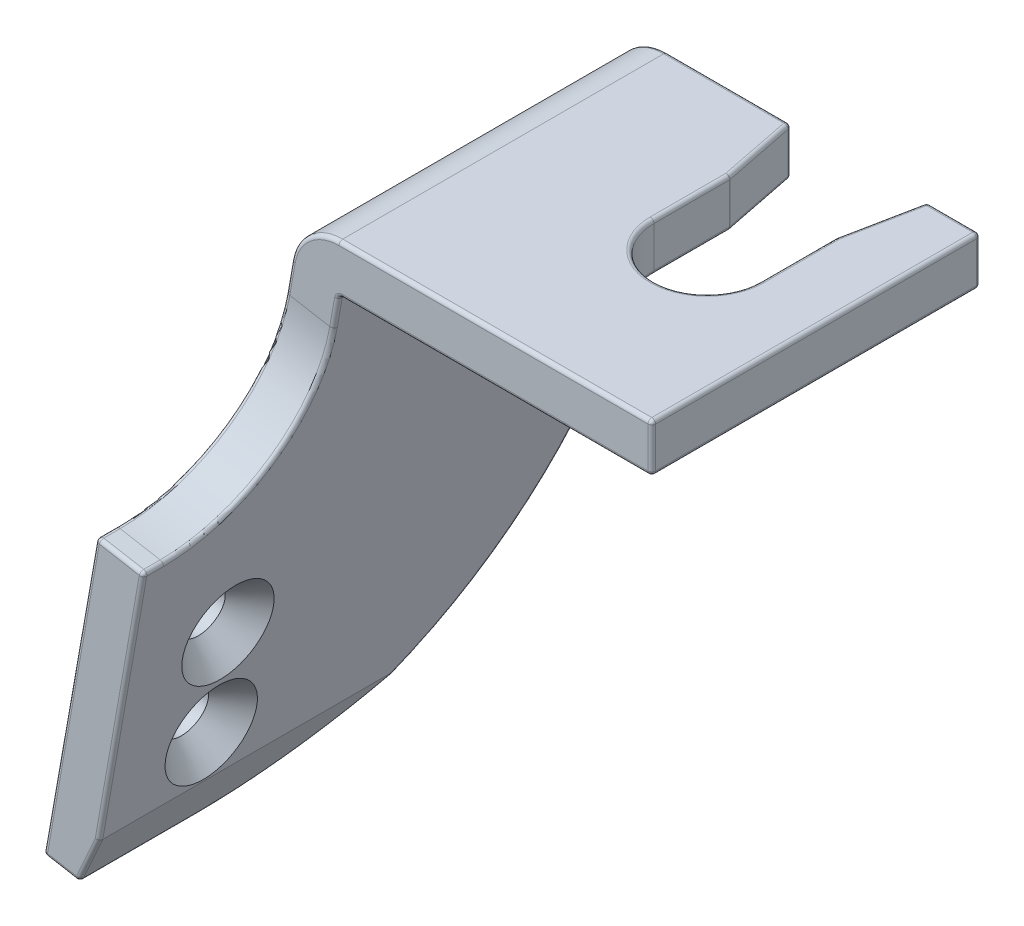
ISO-10303-21;
HEADER;
FILE_DESCRIPTION(('STEP AP214'),'2;1');
FILE_NAME('part.step','',(''),(''),'','','');
FILE_SCHEMA(('AUTOMOTIVE_DESIGN { 1 0 10303 214 1 1 1 1 }'));
ENDSEC;
DATA;
#1=APPLICATION_CONTEXT('core data for automotive mechanical design processes');
#2=APPLICATION_PROTOCOL_DEFINITION('international standard','automotive_design',2000,#1);
#3=PRODUCT_CONTEXT('',#1,'mechanical');
#4=PRODUCT('Part','Part','',(#3));
#5=PRODUCT_RELATED_PRODUCT_CATEGORY('part','',(#4));
#6=PRODUCT_DEFINITION_FORMATION('','',#4);
#7=PRODUCT_DEFINITION_CONTEXT('part definition',#1,'design');
#8=PRODUCT_DEFINITION('design','',#6,#7);
#9=PRODUCT_DEFINITION_SHAPE('','',#8);
#10=(LENGTH_UNIT() NAMED_UNIT(*) SI_UNIT(.MILLI.,.METRE.));
#11=(NAMED_UNIT(*) PLANE_ANGLE_UNIT() SI_UNIT($,.RADIAN.));
#12=(NAMED_UNIT(*) SI_UNIT($,.STERADIAN.) SOLID_ANGLE_UNIT());
#13=UNCERTAINTY_MEASURE_WITH_UNIT(LENGTH_MEASURE(1.E-05),#10,'distance_accuracy_value','');
#14=(GEOMETRIC_REPRESENTATION_CONTEXT(3) GLOBAL_UNCERTAINTY_ASSIGNED_CONTEXT((#13)) GLOBAL_UNIT_ASSIGNED_CONTEXT((#10,
#11,#12)) REPRESENTATION_CONTEXT('',''));
#15=CARTESIAN_POINT('',(0.,0.,0.));
#16=DIRECTION('',(0.,0.,1.));
#17=DIRECTION('',(1.,0.,0.));
#18=AXIS2_PLACEMENT_3D('',#15,#16,#17);
#19=CARTESIAN_POINT('',(89.7164553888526,9.5,-87.5));
#20=DIRECTION('',(0.,1.,0.));
#21=DIRECTION('',(-1.,0.,0.));
#22=AXIS2_PLACEMENT_3D('',#19,#20,#21);
#23=PLANE('',#22);
#24=DIRECTION('',(0.,0.,1.));
#25=VECTOR('',#24,1.);
#26=CARTESIAN_POINT('',(112.75,9.5,-87.5));
#27=LINE('',#26,#25);
#28=CARTESIAN_POINT('',(112.75,9.5,55.25));
#29=VERTEX_POINT('',#28);
#30=CARTESIAN_POINT('',(112.75,9.5,76.395));
#31=VERTEX_POINT('',#30);
#32=EDGE_CURVE('E530',#29,#31,#27,.T.);
#33=ORIENTED_EDGE('',*,*,#32,.F.);
#34=DIRECTION('',(1.,0.,0.));
#35=VECTOR('',#34,1.);
#36=CARTESIAN_POINT('',(89.7164553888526,9.5,55.25));
#37=LINE('',#36,#35);
#38=CARTESIAN_POINT('',(109.70495097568,9.5,55.25));
#39=VERTEX_POINT('',#38);
#40=EDGE_CURVE('E528',#39,#29,#37,.T.);
#41=ORIENTED_EDGE('',*,*,#40,.F.);
#42=DIRECTION('',(0.196116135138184,0.,-0.98058067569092));
#43=VECTOR('',#42,1.);
#44=CARTESIAN_POINT('',(136.388085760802,9.49999999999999,-78.1656739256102));
#45=LINE('',#44,#43);
#46=CARTESIAN_POINT('',(108.75,9.5,60.0247548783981));
#47=VERTEX_POINT('',#46);
#48=EDGE_CURVE('E526',#47,#39,#45,.T.);
#49=ORIENTED_EDGE('',*,*,#48,.F.);
#50=DIRECTION('',(0.,0.,1.));
#51=VECTOR('',#50,1.);
#52=CARTESIAN_POINT('',(108.75,9.5,65.));
#53=LINE('',#52,#51);
#54=CARTESIAN_POINT('',(108.75,9.5,65.));
#55=VERTEX_POINT('',#54);
#56=EDGE_CURVE('E524',#55,#47,#53,.F.);
#57=ORIENTED_EDGE('',*,*,#56,.F.);
#58=CARTESIAN_POINT('',(105.,9.5,65.));
#59=DIRECTION('',(0.,-1.,0.));
#60=DIRECTION('',(-1.,0.,0.));
#61=AXIS2_PLACEMENT_3D('',#58,#59,#60);
#62=CIRCLE('',#61,3.75);
#63=CARTESIAN_POINT('',(101.25,9.5,65.));
#64=VERTEX_POINT('',#63);
#65=EDGE_CURVE('E522',#64,#55,#62,.F.);
#66=ORIENTED_EDGE('',*,*,#65,.F.);
#67=DIRECTION('',(0.,0.,1.));
#68=VECTOR('',#67,1.);
#69=CARTESIAN_POINT('',(101.25,9.5,-87.5));
#70=LINE('',#69,#68);
#71=CARTESIAN_POINT('',(101.25,9.5,60.0247548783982));
#72=VERTEX_POINT('',#71);
#73=EDGE_CURVE('E520',#72,#64,#70,.T.);
#74=ORIENTED_EDGE('',*,*,#73,.F.);
#75=DIRECTION('',(-0.196116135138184,0.,-0.98058067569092));
#76=VECTOR('',#75,1.);
#77=CARTESIAN_POINT('',(72.4362569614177,9.5,-84.043960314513));
#78=LINE('',#77,#76);
#79=CARTESIAN_POINT('',(100.29504902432,9.5,55.25));
#80=VERTEX_POINT('',#79);
#81=EDGE_CURVE('E518',#80,#72,#78,.F.);
#82=ORIENTED_EDGE('',*,*,#81,.F.);
#83=DIRECTION('',(1.,0.,0.));
#84=VECTOR('',#83,1.);
#85=CARTESIAN_POINT('',(89.7164553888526,9.5,55.25));
#86=LINE('',#85,#84);
#87=CARTESIAN_POINT('',(92.3805967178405,9.5,55.25));
#88=VERTEX_POINT('',#87);
#89=EDGE_CURVE('E516',#88,#80,#86,.T.);
#90=ORIENTED_EDGE('',*,*,#89,.F.);
#91=DIRECTION('',(0.,0.,1.));
#92=VECTOR('',#91,1.);
#93=CARTESIAN_POINT('',(92.3805967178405,9.5,-87.5));
#94=LINE('',#93,#92);
#95=CARTESIAN_POINT('',(92.3805967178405,9.5,76.395));
#96=VERTEX_POINT('',#95);
#97=EDGE_CURVE('E361',#96,#88,#94,.F.);
#98=ORIENTED_EDGE('',*,*,#97,.F.);
#99=DIRECTION('',(-1.,0.,0.));
#100=VECTOR('',#99,1.);
#101=CARTESIAN_POINT('',(89.7164553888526,9.5,76.395));
#102=LINE('',#101,#100);
#103=EDGE_CURVE('E532',#31,#96,#102,.T.);
#104=ORIENTED_EDGE('',*,*,#103,.F.);
#105=EDGE_LOOP('',(#33,#41,#49,#57,#66,#74,#82,#90,#98,#104));
#106=FACE_BOUND('',#105,.T.);
#107=ADVANCED_FACE('F36',(#106),#23,.T.);
#108=CARTESIAN_POINT('',(92.3805967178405,6.325,-87.5));
#109=DIRECTION('',(0.,1.,0.));
#110=DIRECTION('',(0.,0.,-1.));
#111=AXIS2_PLACEMENT_3D('',#108,#109,#110);
#112=PLANE('',#111);
#113=DIRECTION('',(0.,0.,1.));
#114=VECTOR('',#113,1.);
#115=CARTESIAN_POINT('',(92.5903716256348,6.325,-87.5));
#116=LINE('',#115,#114);
#117=CARTESIAN_POINT('',(92.5903716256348,6.325,55.25));
#118=VERTEX_POINT('',#117);
#119=CARTESIAN_POINT('',(92.5903716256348,6.325,76.395));
#120=VERTEX_POINT('',#119);
#121=EDGE_CURVE('E620',#118,#120,#116,.T.);
#122=ORIENTED_EDGE('',*,*,#121,.F.);
#123=DIRECTION('',(1.,0.,0.));
#124=VECTOR('',#123,1.);
#125=CARTESIAN_POINT('',(0.,6.325,55.25));
#126=LINE('',#125,#124);
#127=CARTESIAN_POINT('',(100.29504902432,6.325,55.25));
#128=VERTEX_POINT('',#127);
#129=EDGE_CURVE('E485',#128,#118,#126,.F.);
#130=ORIENTED_EDGE('',*,*,#129,.F.);
#131=DIRECTION('',(0.196116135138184,0.,0.98058067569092));
#132=VECTOR('',#131,1.);
#133=CARTESIAN_POINT('',(72.5387239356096,6.325,-83.5316254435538));
#134=LINE('',#133,#132);
#135=CARTESIAN_POINT('',(101.25,6.325,60.0247548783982));
#136=VERTEX_POINT('',#135);
#137=EDGE_CURVE('E487',#136,#128,#134,.F.);
#138=ORIENTED_EDGE('',*,*,#137,.F.);
#139=DIRECTION('',(0.,0.,-1.));
#140=VECTOR('',#139,1.);
#141=CARTESIAN_POINT('',(101.25,6.325,-87.5));
#142=LINE('',#141,#140);
#143=CARTESIAN_POINT('',(101.25,6.325,65.));
#144=VERTEX_POINT('',#143);
#145=EDGE_CURVE('E489',#144,#136,#142,.T.);
#146=ORIENTED_EDGE('',*,*,#145,.F.);
#147=CARTESIAN_POINT('',(105.,6.325,65.));
#148=DIRECTION('',(0.,-1.,0.));
#149=DIRECTION('',(0.,0.,-1.));
#150=AXIS2_PLACEMENT_3D('',#147,#148,#149);
#151=CIRCLE('',#150,3.75);
#152=CARTESIAN_POINT('',(108.75,6.325,65.));
#153=VERTEX_POINT('',#152);
#154=EDGE_CURVE('E491',#153,#144,#151,.T.);
#155=ORIENTED_EDGE('',*,*,#154,.F.);
#156=DIRECTION('',(0.,0.,-1.));
#157=VECTOR('',#156,1.);
#158=CARTESIAN_POINT('',(108.75,6.325,-87.5));
#159=LINE('',#158,#157);
#160=CARTESIAN_POINT('',(108.75,6.325,60.0247548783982));
#161=VERTEX_POINT('',#160);
#162=EDGE_CURVE('E493',#161,#153,#159,.F.);
#163=ORIENTED_EDGE('',*,*,#162,.F.);
#164=DIRECTION('',(-0.196116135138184,0.,0.98058067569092));
#165=VECTOR('',#164,1.);
#166=CARTESIAN_POINT('',(136.490552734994,6.325,-78.6780087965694));
#167=LINE('',#166,#165);
#168=CARTESIAN_POINT('',(109.70495097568,6.325,55.25));
#169=VERTEX_POINT('',#168);
#170=EDGE_CURVE('E495',#169,#161,#167,.T.);
#171=ORIENTED_EDGE('',*,*,#170,.F.);
#172=DIRECTION('',(1.,0.,0.));
#173=VECTOR('',#172,1.);
#174=CARTESIAN_POINT('',(0.,6.325,55.25));
#175=LINE('',#174,#173);
#176=CARTESIAN_POINT('',(112.75,6.325,55.25));
#177=VERTEX_POINT('',#176);
#178=EDGE_CURVE('E497',#177,#169,#175,.F.);
#179=ORIENTED_EDGE('',*,*,#178,.F.);
#180=DIRECTION('',(0.,0.,1.));
#181=VECTOR('',#180,1.);
#182=CARTESIAN_POINT('',(112.75,6.325,-87.5));
#183=LINE('',#182,#181);
#184=CARTESIAN_POINT('',(112.75,6.325,76.395));
#185=VERTEX_POINT('',#184);
#186=EDGE_CURVE('E499',#185,#177,#183,.F.);
#187=ORIENTED_EDGE('',*,*,#186,.F.);
#188=DIRECTION('',(-1.,0.,0.));
#189=VECTOR('',#188,1.);
#190=CARTESIAN_POINT('',(65.3529195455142,6.325,76.395));
#191=LINE('',#190,#189);
#192=EDGE_CURVE('E501',#120,#185,#191,.F.);
#193=ORIENTED_EDGE('',*,*,#192,.F.);
#194=EDGE_LOOP('',(#122,#130,#138,#146,#155,#163,#171,#179,#187,#193));
#195=FACE_BOUND('',#194,.T.);
#196=ADVANCED_FACE('F902',(#195),#112,.F.);
#197=CARTESIAN_POINT('',(83.7405024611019,-24.3913131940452,-87.5));
#198=DIRECTION('',(-0.984807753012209,0.173648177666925,0.));
#199=DIRECTION('',(-0.173648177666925,-0.984807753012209,0.));
#200=AXIS2_PLACEMENT_3D('',#197,#198,#199);
#201=PLANE('',#200);
#202=DIRECTION('',(0.,0.,1.));
#203=VECTOR('',#202,1.);
#204=CARTESIAN_POINT('',(89.2538321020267,6.87633296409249,-87.5));
#205=LINE('',#204,#203);
#206=CARTESIAN_POINT('',(89.2538321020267,6.87633296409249,55.25));
#207=VERTEX_POINT('',#206);
#208=CARTESIAN_POINT('',(89.2538321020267,6.87633296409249,76.395));
#209=VERTEX_POINT('',#208);
#210=EDGE_CURVE('E606',#207,#209,#205,.T.);
#211=ORIENTED_EDGE('',*,*,#210,.F.);
#212=DIRECTION('',(0.173648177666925,0.984807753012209,0.));
#213=VECTOR('',#212,1.);
#214=CARTESIAN_POINT('',(83.7405024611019,-24.3913131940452,55.25));
#215=LINE('',#214,#213);
#216=CARTESIAN_POINT('',(88.081706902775,0.228880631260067,55.25));
#217=VERTEX_POINT('',#216);
#218=EDGE_CURVE('E665',#217,#207,#215,.T.);
#219=ORIENTED_EDGE('',*,*,#218,.F.);
#220=CARTESIAN_POINT('',(88.081706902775,0.228880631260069,80.));
#221=DIRECTION('',(0.984807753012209,-0.173648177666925,0.));
#222=DIRECTION('',(-0.173648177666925,-0.984807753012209,0.));
#223=AXIS2_PLACEMENT_3D('',#220,#221,#222);
#224=CIRCLE('',#223,24.75);
#225=CARTESIAN_POINT('',(83.7839145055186,-24.1451112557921,80.));
#226=VERTEX_POINT('',#225);
#227=EDGE_CURVE('E662',#226,#217,#224,.T.);
#228=ORIENTED_EDGE('',*,*,#227,.F.);
#229=DIRECTION('',(0.,0.,1.));
#230=VECTOR('',#229,1.);
#231=CARTESIAN_POINT('',(83.7839145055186,-24.1451112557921,-87.5));
#232=LINE('',#231,#230);
#233=CARTESIAN_POINT('',(83.7839145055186,-24.1451112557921,87.25));
#234=VERTEX_POINT('',#233);
#235=EDGE_CURVE('E658',#234,#226,#232,.F.);
#236=ORIENTED_EDGE('',*,*,#235,.F.);
#237=DIRECTION('',(0.173648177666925,0.984807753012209,0.));
#238=VECTOR('',#237,1.);
#239=CARTESIAN_POINT('',(83.7405024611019,-24.3913131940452,87.25));
#240=LINE('',#239,#238);
#241=CARTESIAN_POINT('',(87.1968598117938,-4.78933658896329,87.25));
#242=VERTEX_POINT('',#241);
#243=EDGE_CURVE('E656',#242,#234,#240,.F.);
#244=ORIENTED_EDGE('',*,*,#243,.F.);
#245=DIRECTION('',(0.,0.,-1.));
#246=VECTOR('',#245,1.);
#247=CARTESIAN_POINT('',(87.1968598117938,-4.78933658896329,76.645));
#248=LINE('',#247,#246);
#249=CARTESIAN_POINT('',(87.1968598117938,-4.7893365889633,86.17));
#250=VERTEX_POINT('',#249);
#251=EDGE_CURVE('E660',#250,#242,#248,.F.);
#252=ORIENTED_EDGE('',*,*,#251,.F.);
#253=CARTESIAN_POINT('',(88.894270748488,4.83715919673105,86.17));
#254=DIRECTION('',(0.984807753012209,-0.173648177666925,0.));
#255=DIRECTION('',(-0.173648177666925,-0.984807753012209,0.));
#256=AXIS2_PLACEMENT_3D('',#253,#254,#255);
#257=CIRCLE('',#256,9.775);
#258=CARTESIAN_POINT('',(88.894270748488,4.83715919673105,76.395));
#259=VERTEX_POINT('',#258);
#260=EDGE_CURVE('E375',#259,#250,#257,.F.);
#261=ORIENTED_EDGE('',*,*,#260,.F.);
#262=DIRECTION('',(-0.173648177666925,-0.984807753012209,0.));
#263=VECTOR('',#262,1.);
#264=CARTESIAN_POINT('',(83.7405024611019,-24.3913131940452,76.395));
#265=LINE('',#264,#263);
#266=EDGE_CURVE('E667',#209,#259,#265,.T.);
#267=ORIENTED_EDGE('',*,*,#266,.F.);
#268=EDGE_LOOP('',(#211,#219,#228,#236,#244,#252,#261,#267));
#269=FACE_BOUND('',#268,.T.);
#270=CARTESIAN_POINT('',(85.9379105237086,-11.9291927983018,80.645));
#271=DIRECTION('',(0.984807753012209,-0.173648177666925,0.));
#272=DIRECTION('',(-0.173648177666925,-0.984807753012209,0.));
#273=AXIS2_PLACEMENT_3D('',#270,#271,#272);
#274=CIRCLE('',#273,1.75);
#275=CARTESIAN_POINT('',(85.6340262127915,-13.6526063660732,80.645));
#276=VERTEX_POINT('',#275);
#277=EDGE_CURVE('E653',#276,#276,#274,.F.);
#278=ORIENTED_EDGE('',*,*,#277,.F.);
#279=EDGE_LOOP('',(#278));
#280=FACE_BOUND('',#279,.T.);
#281=CARTESIAN_POINT('',(84.8352445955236,-18.1827220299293,80.645));
#282=DIRECTION('',(0.984807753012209,-0.173648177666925,0.));
#283=DIRECTION('',(-0.173648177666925,-0.984807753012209,0.));
#284=AXIS2_PLACEMENT_3D('',#281,#282,#283);
#285=CIRCLE('',#284,1.75);
#286=CARTESIAN_POINT('',(84.5313602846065,-19.9061355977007,80.645));
#287=VERTEX_POINT('',#286);
#288=EDGE_CURVE('E650',#287,#287,#285,.F.);
#289=ORIENTED_EDGE('',*,*,#288,.F.);
#290=EDGE_LOOP('',(#289));
#291=FACE_BOUND('',#290,.T.);
#292=ADVANCED_FACE('F907',(#269,#280,#291),#201,.T.);
#293=CARTESIAN_POINT('',(92.3805967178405,6.325,-87.5));
#294=DIRECTION('',(0.984807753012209,-0.173648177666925,0.));
#295=DIRECTION('',(0.173648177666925,0.984807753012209,0.));
#296=AXIS2_PLACEMENT_3D('',#293,#294,#295);
#297=PLANE('',#296);
#298=CARTESIAN_POINT('',(89.0646751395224,-12.4805257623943,80.645));
#299=DIRECTION('',(-0.984807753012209,0.173648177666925,0.));
#300=DIRECTION('',(0.173648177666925,0.984807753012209,0.));
#301=AXIS2_PLACEMENT_3D('',#298,#299,#300);
#302=CIRCLE('',#301,3.00000000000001);
#303=CARTESIAN_POINT('',(89.5856196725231,-9.52610250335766,80.645));
#304=VERTEX_POINT('',#303);
#305=EDGE_CURVE('E607',#304,#304,#302,.T.);
#306=ORIENTED_EDGE('',*,*,#305,.T.);
#307=EDGE_LOOP('',(#306));
#308=FACE_BOUND('',#307,.T.);
#309=CARTESIAN_POINT('',(87.9620092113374,-18.7340549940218,80.645));
#310=DIRECTION('',(-0.984807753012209,0.173648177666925,0.));
#311=DIRECTION('',(0.173648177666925,0.984807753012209,0.));
#312=AXIS2_PLACEMENT_3D('',#309,#310,#311);
#313=CIRCLE('',#312,3.00000000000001);
#314=CARTESIAN_POINT('',(88.4829537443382,-15.7796317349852,80.645));
#315=VERTEX_POINT('',#314);
#316=EDGE_CURVE('E617',#315,#315,#313,.T.);
#317=ORIENTED_EDGE('',*,*,#316,.T.);
#318=EDGE_LOOP('',(#317));
#319=FACE_BOUND('',#318,.T.);
#320=DIRECTION('',(-0.173648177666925,-0.984807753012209,0.));
#321=VECTOR('',#320,1.);
#322=CARTESIAN_POINT('',(92.3805967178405,6.325,55.25));
#323=LINE('',#322,#321);
#324=CARTESIAN_POINT('',(92.3441696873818,6.11841204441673,55.25));
#325=VERTEX_POINT('',#324);
#326=CARTESIAN_POINT('',(91.2084715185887,-0.322452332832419,55.25));
#327=VERTEX_POINT('',#326);
#328=EDGE_CURVE('E646',#325,#327,#323,.T.);
#329=ORIENTED_EDGE('',*,*,#328,.F.);
#330=DIRECTION('',(0.,0.,1.));
#331=VECTOR('',#330,1.);
#332=CARTESIAN_POINT('',(92.3441696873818,6.11841204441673,-87.5));
#333=LINE('',#332,#331);
#334=CARTESIAN_POINT('',(92.3441696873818,6.11841204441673,76.395));
#335=VERTEX_POINT('',#334);
#336=EDGE_CURVE('E623',#335,#325,#333,.F.);
#337=ORIENTED_EDGE('',*,*,#336,.F.);
#338=DIRECTION('',(0.173648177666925,0.984807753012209,0.));
#339=VECTOR('',#338,1.);
#340=CARTESIAN_POINT('',(92.3805967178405,6.325,76.395));
#341=LINE('',#340,#339);
#342=CARTESIAN_POINT('',(92.0210353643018,4.28582623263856,76.395));
#343=VERTEX_POINT('',#342);
#344=EDGE_CURVE('E644',#343,#335,#341,.T.);
#345=ORIENTED_EDGE('',*,*,#344,.F.);
#346=CARTESIAN_POINT('',(92.0210353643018,4.28582623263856,86.17));
#347=DIRECTION('',(-0.984807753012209,0.173648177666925,0.));
#348=DIRECTION('',(0.173648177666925,0.984807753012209,0.));
#349=AXIS2_PLACEMENT_3D('',#346,#347,#348);
#350=CIRCLE('',#349,9.775);
#351=CARTESIAN_POINT('',(90.3236244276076,-5.34066955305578,86.17));
#352=VERTEX_POINT('',#351);
#353=EDGE_CURVE('E642',#352,#343,#350,.F.);
#354=ORIENTED_EDGE('',*,*,#353,.F.);
#355=DIRECTION('',(0.,0.,1.));
#356=VECTOR('',#355,1.);
#357=CARTESIAN_POINT('',(90.3236244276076,-5.34066955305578,76.645));
#358=LINE('',#357,#356);
#359=CARTESIAN_POINT('',(90.3236244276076,-5.34066955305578,87.25));
#360=VERTEX_POINT('',#359);
#361=EDGE_CURVE('E639',#360,#352,#358,.F.);
#362=ORIENTED_EDGE('',*,*,#361,.F.);
#363=DIRECTION('',(-0.173648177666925,-0.984807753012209,0.));
#364=VECTOR('',#363,1.);
#365=CARTESIAN_POINT('',(92.3805967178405,6.325,87.25));
#366=LINE('',#365,#364);
#367=CARTESIAN_POINT('',(87.4186000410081,-21.8158815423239,87.25));
#368=VERTEX_POINT('',#367);
#369=EDGE_CURVE('E637',#368,#360,#366,.F.);
#370=ORIENTED_EDGE('',*,*,#369,.F.);
#371=DIRECTION('',(0.,0.,1.));
#372=VECTOR('',#371,1.);
#373=CARTESIAN_POINT('',(87.4186000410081,-21.8158815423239,87.5));
#374=LINE('',#373,#372);
#375=CARTESIAN_POINT('',(87.4186000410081,-21.8158815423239,68.3281588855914));
#376=VERTEX_POINT('',#375);
#377=EDGE_CURVE('E626',#376,#368,#374,.T.);
#378=ORIENTED_EDGE('',*,*,#377,.F.);
#379=CARTESIAN_POINT('',(91.2084715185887,-0.322452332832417,80.));
#380=DIRECTION('',(-0.984807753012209,0.173648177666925,0.));
#381=DIRECTION('',(0.173648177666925,0.984807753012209,0.));
#382=AXIS2_PLACEMENT_3D('',#379,#380,#381);
#383=CIRCLE('',#382,24.75);
#384=EDGE_CURVE('E648',#327,#376,#383,.T.);
#385=ORIENTED_EDGE('',*,*,#384,.F.);
#386=EDGE_LOOP('',(#329,#337,#345,#354,#362,#370,#378,#385));
#387=FACE_BOUND('',#386,.T.);
#388=ADVANCED_FACE('F719',(#308,#319,#387),#297,.T.);
#389=CARTESIAN_POINT('',(113.,6.325,-87.5));
#390=DIRECTION('',(-1.,0.,0.));
#391=DIRECTION('',(0.,0.,-1.));
#392=AXIS2_PLACEMENT_3D('',#389,#390,#391);
#393=PLANE('',#392);
#394=DIRECTION('',(0.,-1.,0.));
#395=VECTOR('',#394,1.);
#396=CARTESIAN_POINT('',(113.,-0.683803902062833,76.395));
#397=LINE('',#396,#395);
#398=CARTESIAN_POINT('',(113.,6.575,76.395));
#399=VERTEX_POINT('',#398);
#400=CARTESIAN_POINT('',(113.,9.25,76.395));
#401=VERTEX_POINT('',#400);
#402=EDGE_CURVE('E550',#399,#401,#397,.F.);
#403=ORIENTED_EDGE('',*,*,#402,.F.);
#404=DIRECTION('',(0.,0.,1.));
#405=VECTOR('',#404,1.);
#406=CARTESIAN_POINT('',(113.,6.575,-87.5));
#407=LINE('',#406,#405);
#408=CARTESIAN_POINT('',(113.,6.575,55.25));
#409=VERTEX_POINT('',#408);
#410=EDGE_CURVE('E548',#409,#399,#407,.T.);
#411=ORIENTED_EDGE('',*,*,#410,.F.);
#412=DIRECTION('',(0.,1.,0.));
#413=VECTOR('',#412,1.);
#414=CARTESIAN_POINT('',(113.,0.,55.25));
#415=LINE('',#414,#413);
#416=CARTESIAN_POINT('',(113.,9.25,55.25));
#417=VERTEX_POINT('',#416);
#418=EDGE_CURVE('E546',#417,#409,#415,.F.);
#419=ORIENTED_EDGE('',*,*,#418,.F.);
#420=DIRECTION('',(0.,0.,1.));
#421=VECTOR('',#420,1.);
#422=CARTESIAN_POINT('',(113.,9.25,-87.5));
#423=LINE('',#422,#421);
#424=EDGE_CURVE('E552',#401,#417,#423,.F.);
#425=ORIENTED_EDGE('',*,*,#424,.F.);
#426=EDGE_LOOP('',(#403,#411,#419,#425));
#427=FACE_BOUND('',#426,.T.);
#428=ADVANCED_FACE('F1099',(#427),#393,.F.);
#429=CARTESIAN_POINT('',(92.3805967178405,6.325,-87.5));
#430=DIRECTION('',(0.,0.,1.));
#431=DIRECTION('',(-1.,0.,0.));
#432=AXIS2_PLACEMENT_3D('',#429,#430,#431);
#433=CYLINDRICAL_SURFACE('',#432,3.175);
#434=ORIENTED_EDGE('',*,*,#97,.T.);
#435=CARTESIAN_POINT('',(92.3805967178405,6.325,55.25));
#436=DIRECTION('',(0.,0.,1.));
#437=DIRECTION('',(1.,0.,0.));
#438=AXIS2_PLACEMENT_3D('',#435,#436,#437);
#439=CIRCLE('',#438,3.175);
#440=EDGE_CURVE('E538',#207,#88,#439,.F.);
#441=ORIENTED_EDGE('',*,*,#440,.F.);
#442=ORIENTED_EDGE('',*,*,#210,.T.);
#443=CARTESIAN_POINT('',(92.3805967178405,6.325,76.395));
#444=DIRECTION('',(0.,0.,-1.));
#445=DIRECTION('',(-1.,0.,0.));
#446=AXIS2_PLACEMENT_3D('',#443,#444,#445);
#447=CIRCLE('',#446,3.175);
#448=EDGE_CURVE('E540',#96,#209,#447,.F.);
#449=ORIENTED_EDGE('',*,*,#448,.F.);
#450=EDGE_LOOP('',(#434,#441,#442,#449));
#451=FACE_BOUND('',#450,.T.);
#452=ADVANCED_FACE('F1077',(#451),#433,.T.);
#453=CARTESIAN_POINT('',(83.7405024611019,-24.3913131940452,-87.5));
#454=DIRECTION('',(0.173648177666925,0.984807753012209,0.));
#455=DIRECTION('',(-0.984807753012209,0.173648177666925,0.));
#456=AXIS2_PLACEMENT_3D('',#453,#454,#455);
#457=PLANE('',#456);
#458=DIRECTION('',(0.984807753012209,-0.173648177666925,0.));
#459=VECTOR('',#458,1.);
#460=CARTESIAN_POINT('',(-1.64607509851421,-9.33535577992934,80.));
#461=LINE('',#460,#459);
#462=CARTESIAN_POINT('',(85.8933472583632,-24.7709178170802,80.));
#463=VERTEX_POINT('',#462);
#464=CARTESIAN_POINT('',(83.9867043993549,-24.4347252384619,80.));
#465=VERTEX_POINT('',#464);
#466=EDGE_CURVE('E632',#463,#465,#461,.F.);
#467=ORIENTED_EDGE('',*,*,#466,.F.);
#468=DIRECTION('',(0.,0.,-1.));
#469=VECTOR('',#468,1.);
#470=CARTESIAN_POINT('',(85.8933472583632,-24.7709178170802,-87.5));
#471=LINE('',#470,#469);
#472=CARTESIAN_POINT('',(85.8933472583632,-24.7709178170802,87.25));
#473=VERTEX_POINT('',#472);
#474=EDGE_CURVE('E671',#473,#463,#471,.T.);
#475=ORIENTED_EDGE('',*,*,#474,.F.);
#476=DIRECTION('',(0.984807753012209,-0.173648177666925,0.));
#477=VECTOR('',#476,1.);
#478=CARTESIAN_POINT('',(83.7405024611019,-24.3913131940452,87.25));
#479=LINE('',#478,#477);
#480=CARTESIAN_POINT('',(83.9867043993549,-24.4347252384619,87.25));
#481=VERTEX_POINT('',#480);
#482=EDGE_CURVE('E669',#481,#473,#479,.T.);
#483=ORIENTED_EDGE('',*,*,#482,.F.);
#484=DIRECTION('',(0.,0.,1.));
#485=VECTOR('',#484,1.);
#486=CARTESIAN_POINT('',(83.9867043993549,-24.4347252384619,-87.5));
#487=LINE('',#486,#485);
#488=EDGE_CURVE('E371',#465,#481,#487,.T.);
#489=ORIENTED_EDGE('',*,*,#488,.F.);
#490=EDGE_LOOP('',(#467,#475,#483,#489));
#491=FACE_BOUND('',#490,.T.);
#492=ADVANCED_FACE('F753',(#491),#457,.F.);
#493=CARTESIAN_POINT('',(108.5,16.325,65.));
#494=DIRECTION('',(1.,0.,0.));
#495=DIRECTION('',(0.,0.,1.));
#496=AXIS2_PLACEMENT_3D('',#493,#494,#495);
#497=PLANE('',#496);
#498=DIRECTION('',(0.,-1.,0.));
#499=VECTOR('',#498,1.);
#500=CARTESIAN_POINT('',(108.5,16.325,65.));
#501=LINE('',#500,#499);
#502=CARTESIAN_POINT('',(108.5,9.25,65.));
#503=VERTEX_POINT('',#502);
#504=CARTESIAN_POINT('',(108.5,6.575,65.));
#505=VERTEX_POINT('',#504);
#506=EDGE_CURVE('E881',#503,#505,#501,.T.);
#507=ORIENTED_EDGE('',*,*,#506,.F.);
#508=DIRECTION('',(0.,0.,1.));
#509=VECTOR('',#508,1.);
#510=CARTESIAN_POINT('',(108.5,9.25,65.));
#511=LINE('',#510,#509);
#512=CARTESIAN_POINT('',(108.5,9.25,60.0247548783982));
#513=VERTEX_POINT('',#512);
#514=EDGE_CURVE('E512',#513,#503,#511,.T.);
#515=ORIENTED_EDGE('',*,*,#514,.F.);
#516=DIRECTION('',(0.,1.,0.));
#517=VECTOR('',#516,1.);
#518=CARTESIAN_POINT('',(108.5,16.325,60.0247548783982));
#519=LINE('',#518,#517);
#520=CARTESIAN_POINT('',(108.5,6.575,60.0247548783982));
#521=VERTEX_POINT('',#520);
#522=EDGE_CURVE('E510',#521,#513,#519,.T.);
#523=ORIENTED_EDGE('',*,*,#522,.F.);
#524=DIRECTION('',(0.,0.,-1.));
#525=VECTOR('',#524,1.);
#526=CARTESIAN_POINT('',(108.5,6.575,65.));
#527=LINE('',#526,#525);
#528=EDGE_CURVE('E514',#505,#521,#527,.T.);
#529=ORIENTED_EDGE('',*,*,#528,.F.);
#530=EDGE_LOOP('',(#507,#515,#523,#529));
#531=FACE_BOUND('',#530,.T.);
#532=ADVANCED_FACE('F1107',(#531),#497,.F.);
#533=CARTESIAN_POINT('',(101.5,16.325,65.));
#534=DIRECTION('',(1.,0.,0.));
#535=DIRECTION('',(0.,0.,1.));
#536=AXIS2_PLACEMENT_3D('',#533,#534,#535);
#537=PLANE('',#536);
#538=DIRECTION('',(0.,1.,0.));
#539=VECTOR('',#538,1.);
#540=CARTESIAN_POINT('',(101.5,16.325,60.0247548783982));
#541=LINE('',#540,#539);
#542=CARTESIAN_POINT('',(101.5,9.25,60.0247548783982));
#543=VERTEX_POINT('',#542);
#544=CARTESIAN_POINT('',(101.5,6.575,60.0247548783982));
#545=VERTEX_POINT('',#544);
#546=EDGE_CURVE('E503',#543,#545,#541,.F.);
#547=ORIENTED_EDGE('',*,*,#546,.F.);
#548=DIRECTION('',(0.,0.,1.));
#549=VECTOR('',#548,1.);
#550=CARTESIAN_POINT('',(101.5,9.25,65.));
#551=LINE('',#550,#549);
#552=CARTESIAN_POINT('',(101.5,9.25,65.));
#553=VERTEX_POINT('',#552);
#554=EDGE_CURVE('E505',#553,#543,#551,.F.);
#555=ORIENTED_EDGE('',*,*,#554,.F.);
#556=DIRECTION('',(0.,-1.,0.));
#557=VECTOR('',#556,1.);
#558=CARTESIAN_POINT('',(101.5,16.325,65.));
#559=LINE('',#558,#557);
#560=CARTESIAN_POINT('',(101.5,6.575,65.));
#561=VERTEX_POINT('',#560);
#562=EDGE_CURVE('E878',#553,#561,#559,.T.);
#563=ORIENTED_EDGE('',*,*,#562,.T.);
#564=DIRECTION('',(0.,0.,-1.));
#565=VECTOR('',#564,1.);
#566=CARTESIAN_POINT('',(101.5,6.575,-87.5));
#567=LINE('',#566,#565);
#568=EDGE_CURVE('E507',#545,#561,#567,.F.);
#569=ORIENTED_EDGE('',*,*,#568,.F.);
#570=EDGE_LOOP('',(#547,#555,#563,#569));
#571=FACE_BOUND('',#570,.T.);
#572=ADVANCED_FACE('F1096',(#571),#537,.T.);
#573=CARTESIAN_POINT('',(92.5903716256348,6.075,-87.5));
#574=DIRECTION('',(0.,0.,1.));
#575=DIRECTION('',(-1.,0.,0.));
#576=AXIS2_PLACEMENT_3D('',#573,#574,#575);
#577=CYLINDRICAL_SURFACE('',#576,0.25);
#578=ORIENTED_EDGE('',*,*,#336,.T.);
#579=CARTESIAN_POINT('',(92.5903716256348,6.075,55.25));
#580=DIRECTION('',(0.,0.,1.));
#581=DIRECTION('',(1.,0.,0.));
#582=AXIS2_PLACEMENT_3D('',#579,#580,#581);
#583=CIRCLE('',#582,0.25);
#584=EDGE_CURVE('E534',#118,#325,#583,.T.);
#585=ORIENTED_EDGE('',*,*,#584,.F.);
#586=ORIENTED_EDGE('',*,*,#121,.T.);
#587=CARTESIAN_POINT('',(92.5903716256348,6.075,76.395));
#588=DIRECTION('',(0.,0.,-1.));
#589=DIRECTION('',(-1.,0.,0.));
#590=AXIS2_PLACEMENT_3D('',#587,#588,#589);
#591=CIRCLE('',#590,0.25);
#592=EDGE_CURVE('E536',#335,#120,#591,.T.);
#593=ORIENTED_EDGE('',*,*,#592,.F.);
#594=EDGE_LOOP('',(#578,#585,#586,#593));
#595=FACE_BOUND('',#594,.T.);
#596=ADVANCED_FACE('F988',(#595),#577,.F.);
#597=CARTESIAN_POINT('',(113.,6.325,87.5));
#598=DIRECTION('',(0.,0.,1.));
#599=DIRECTION('',(-1.,0.,0.));
#600=AXIS2_PLACEMENT_3D('',#597,#598,#599);
#601=PLANE('',#600);
#602=DIRECTION('',(0.173648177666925,0.984807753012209,0.));
#603=VECTOR('',#602,1.);
#604=CARTESIAN_POINT('',(90.1217851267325,10.3590465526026,87.5));
#605=LINE('',#604,#603);
#606=CARTESIAN_POINT('',(84.0301164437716,-24.1885233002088,87.5));
#607=VERTEX_POINT('',#606);
#608=CARTESIAN_POINT('',(87.4430617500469,-4.83274863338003,87.5));
#609=VERTEX_POINT('',#608);
#610=EDGE_CURVE('E570',#607,#609,#605,.T.);
#611=ORIENTED_EDGE('',*,*,#610,.F.);
#612=DIRECTION('',(0.984807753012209,-0.173648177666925,0.));
#613=VECTOR('',#612,1.);
#614=CARTESIAN_POINT('',(83.7839145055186,-24.1451112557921,87.5));
#615=LINE('',#614,#613);
#616=CARTESIAN_POINT('',(85.9367593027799,-24.5247158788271,87.5));
#617=VERTEX_POINT('',#616);
#618=EDGE_CURVE('E568',#617,#607,#615,.F.);
#619=ORIENTED_EDGE('',*,*,#618,.F.);
#620=DIRECTION('',(-0.407314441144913,-0.913287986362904,0.));
#621=VECTOR('',#620,1.);
#622=CARTESIAN_POINT('',(101.902639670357,11.2742768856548,87.5));
#623=LINE('',#622,#621);
#624=CARTESIAN_POINT('',(87.1777423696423,-21.7421606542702,87.5));
#625=VERTEX_POINT('',#624);
#626=EDGE_CURVE('E566',#625,#617,#623,.T.);
#627=ORIENTED_EDGE('',*,*,#626,.F.);
#628=DIRECTION('',(-0.173648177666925,-0.984807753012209,0.));
#629=VECTOR('',#628,1.);
#630=CARTESIAN_POINT('',(92.7561458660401,9.8945376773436,87.5));
#631=LINE('',#630,#629);
#632=CARTESIAN_POINT('',(90.0774224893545,-5.29725750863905,87.5));
#633=VERTEX_POINT('',#632);
#634=EDGE_CURVE('E564',#633,#625,#631,.T.);
#635=ORIENTED_EDGE('',*,*,#634,.F.);
#636=DIRECTION('',(-0.984807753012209,0.173648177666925,0.));
#637=VECTOR('',#636,1.);
#638=CARTESIAN_POINT('',(65.3095075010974,-0.930005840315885,87.5));
#639=LINE('',#638,#637);
#640=EDGE_CURVE('E572',#609,#633,#639,.F.);
#641=ORIENTED_EDGE('',*,*,#640,.F.);
#642=EDGE_LOOP('',(#611,#619,#627,#635,#641));
#643=FACE_BOUND('',#642,.T.);
#644=ADVANCED_FACE('F1088',(#643),#601,.T.);
#645=CARTESIAN_POINT('',(65.3529195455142,-0.683803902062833,76.645));
#646=DIRECTION('',(-0.173648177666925,-0.984807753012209,0.));
#647=DIRECTION('',(0.984807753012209,-0.173648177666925,0.));
#648=AXIS2_PLACEMENT_3D('',#645,#646,#647);
#649=PLANE('',#648);
#650=DIRECTION('',(0.984807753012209,-0.173648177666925,0.));
#651=VECTOR('',#650,1.);
#652=CARTESIAN_POINT('',(65.3529195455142,-0.683803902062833,86.17));
#653=LINE('',#652,#651);
#654=CARTESIAN_POINT('',(87.4864737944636,-4.58654669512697,86.17));
#655=VERTEX_POINT('',#654);
#656=CARTESIAN_POINT('',(90.1208345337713,-5.051055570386,86.17));
#657=VERTEX_POINT('',#656);
#658=EDGE_CURVE('E353',#655,#657,#653,.T.);
#659=ORIENTED_EDGE('',*,*,#658,.F.);
#660=DIRECTION('',(0.,0.,-1.));
#661=VECTOR('',#660,1.);
#662=CARTESIAN_POINT('',(87.4864737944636,-4.58654669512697,76.645));
#663=LINE('',#662,#661);
#664=CARTESIAN_POINT('',(87.4864737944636,-4.58654669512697,87.25));
#665=VERTEX_POINT('',#664);
#666=EDGE_CURVE('E336',#665,#655,#663,.T.);
#667=ORIENTED_EDGE('',*,*,#666,.F.);
#668=DIRECTION('',(-0.984807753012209,0.173648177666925,0.));
#669=VECTOR('',#668,1.);
#670=CARTESIAN_POINT('',(65.3529195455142,-0.683803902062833,87.25));
#671=LINE('',#670,#669);
#672=CARTESIAN_POINT('',(90.1208345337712,-5.051055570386,87.25));
#673=VERTEX_POINT('',#672);
#674=EDGE_CURVE('E349',#673,#665,#671,.T.);
#675=ORIENTED_EDGE('',*,*,#674,.F.);
#676=DIRECTION('',(0.,0.,1.));
#677=VECTOR('',#676,1.);
#678=CARTESIAN_POINT('',(90.1208345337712,-5.051055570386,76.645));
#679=LINE('',#678,#677);
#680=EDGE_CURVE('E348',#657,#673,#679,.T.);
#681=ORIENTED_EDGE('',*,*,#680,.F.);
#682=EDGE_LOOP('',(#659,#667,#675,#681));
#683=FACE_BOUND('',#682,.T.);
#684=ADVANCED_FACE('F355',(#683),#649,.F.);
#685=CARTESIAN_POINT('',(65.3529195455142,-0.683803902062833,76.645));
#686=DIRECTION('',(0.,0.,1.));
#687=DIRECTION('',(-1.,0.,0.));
#688=AXIS2_PLACEMENT_3D('',#685,#686,#687);
#689=PLANE('',#688);
#690=CARTESIAN_POINT('',(92.5903716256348,6.075,76.645));
#691=DIRECTION('',(0.,0.,-1.));
#692=DIRECTION('',(-1.,0.,0.));
#693=AXIS2_PLACEMENT_3D('',#690,#691,#692);
#694=CIRCLE('',#693,0.5);
#695=CARTESIAN_POINT('',(92.5903716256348,6.575,76.645));
#696=VERTEX_POINT('',#695);
#697=CARTESIAN_POINT('',(92.0979677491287,6.16182408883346,76.645));
#698=VERTEX_POINT('',#697);
#699=EDGE_CURVE('E467',#696,#698,#694,.F.);
#700=ORIENTED_EDGE('',*,*,#699,.F.);
#701=DIRECTION('',(-1.,0.,0.));
#702=VECTOR('',#701,1.);
#703=CARTESIAN_POINT('',(65.3529195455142,6.575,76.645));
#704=LINE('',#703,#702);
#705=CARTESIAN_POINT('',(112.75,6.575,76.645));
#706=VERTEX_POINT('',#705);
#707=EDGE_CURVE('E465',#706,#696,#704,.T.);
#708=ORIENTED_EDGE('',*,*,#707,.F.);
#709=DIRECTION('',(0.,-1.,0.));
#710=VECTOR('',#709,1.);
#711=CARTESIAN_POINT('',(112.75,-0.683803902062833,76.645));
#712=LINE('',#711,#710);
#713=CARTESIAN_POINT('',(112.75,9.25,76.645));
#714=VERTEX_POINT('',#713);
#715=EDGE_CURVE('E459',#714,#706,#712,.T.);
#716=ORIENTED_EDGE('',*,*,#715,.F.);
#717=DIRECTION('',(-1.,0.,0.));
#718=VECTOR('',#717,1.);
#719=CARTESIAN_POINT('',(65.3529195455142,9.25000000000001,76.645));
#720=LINE('',#719,#718);
#721=CARTESIAN_POINT('',(92.3805967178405,9.25,76.645));
#722=VERTEX_POINT('',#721);
#723=EDGE_CURVE('E457',#722,#714,#720,.F.);
#724=ORIENTED_EDGE('',*,*,#723,.F.);
#725=CARTESIAN_POINT('',(92.3805967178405,6.325,76.645));
#726=DIRECTION('',(0.,0.,-1.));
#727=DIRECTION('',(-1.,0.,0.));
#728=AXIS2_PLACEMENT_3D('',#725,#726,#727);
#729=CIRCLE('',#728,2.925);
#730=CARTESIAN_POINT('',(89.5000340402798,6.83292091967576,76.645));
#731=VERTEX_POINT('',#730);
#732=EDGE_CURVE('E461',#731,#722,#729,.T.);
#733=ORIENTED_EDGE('',*,*,#732,.F.);
#734=DIRECTION('',(-0.173648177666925,-0.984807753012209,0.));
#735=VECTOR('',#734,1.);
#736=CARTESIAN_POINT('',(87.4864737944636,-4.58654669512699,76.645));
#737=LINE('',#736,#735);
#738=CARTESIAN_POINT('',(89.140472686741,4.79374715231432,76.645));
#739=VERTEX_POINT('',#738);
#740=EDGE_CURVE('E463',#739,#731,#737,.F.);
#741=ORIENTED_EDGE('',*,*,#740,.F.);
#742=DIRECTION('',(0.984807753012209,-0.173648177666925,0.));
#743=VECTOR('',#742,1.);
#744=CARTESIAN_POINT('',(67.0069184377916,8.69648994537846,76.645));
#745=LINE('',#744,#743);
#746=CARTESIAN_POINT('',(91.7748334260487,4.32923827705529,76.645));
#747=VERTEX_POINT('',#746);
#748=EDGE_CURVE('E360',#747,#739,#745,.F.);
#749=ORIENTED_EDGE('',*,*,#748,.F.);
#750=DIRECTION('',(0.173648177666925,0.984807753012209,0.));
#751=VECTOR('',#750,1.);
#752=CARTESIAN_POINT('',(90.1208345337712,-5.051055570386,76.645));
#753=LINE('',#752,#751);
#754=EDGE_CURVE('E469',#698,#747,#753,.F.);
#755=ORIENTED_EDGE('',*,*,#754,.F.);
#756=EDGE_LOOP('',(#700,#708,#716,#724,#733,#741,#749,#755));
#757=FACE_BOUND('',#756,.T.);
#758=ADVANCED_FACE('F600',(#757),#689,.T.);
#759=CARTESIAN_POINT('',(64.0505582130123,-8.06986204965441,80.645));
#760=DIRECTION('',(0.984807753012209,-0.173648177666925,0.));
#761=DIRECTION('',(0.173648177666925,0.984807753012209,0.));
#762=AXIS2_PLACEMENT_3D('',#759,#760,#761);
#763=CYLINDRICAL_SURFACE('',#762,1.5);
#764=CARTESIAN_POINT('',(86.1841124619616,-11.9726048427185,80.645));
#765=DIRECTION('',(0.984807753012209,-0.173648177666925,0.));
#766=DIRECTION('',(-0.173648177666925,-0.984807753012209,0.));
#767=AXIS2_PLACEMENT_3D('',#764,#765,#766);
#768=CIRCLE('',#767,1.5);
#769=CARTESIAN_POINT('',(85.9236401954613,-13.4498164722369,80.645));
#770=VERTEX_POINT('',#769);
#771=EDGE_CURVE('E43',#770,#770,#768,.T.);
#772=ORIENTED_EDGE('',*,*,#771,.F.);
#773=EDGE_LOOP('',(#772));
#774=FACE_BOUND('',#773,.T.);
#775=CARTESIAN_POINT('',(87.365337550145,-12.180886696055,80.645));
#776=DIRECTION('',(-0.984807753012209,0.173648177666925,0.));
#777=DIRECTION('',(0.173648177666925,0.984807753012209,0.));
#778=AXIS2_PLACEMENT_3D('',#775,#776,#777);
#779=CIRCLE('',#778,1.5);
#780=CARTESIAN_POINT('',(87.6258098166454,-10.7036750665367,80.645));
#781=VERTEX_POINT('',#780);
#782=EDGE_CURVE('E604',#781,#781,#779,.F.);
#783=ORIENTED_EDGE('',*,*,#782,.T.);
#784=EDGE_LOOP('',(#783));
#785=FACE_BOUND('',#784,.T.);
#786=ADVANCED_FACE('F596',(#774,#785),#763,.F.);
#787=CARTESIAN_POINT('',(62.9478922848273,-14.3233912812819,80.645));
#788=DIRECTION('',(0.984807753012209,-0.173648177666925,0.));
#789=DIRECTION('',(0.173648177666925,0.984807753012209,0.));
#790=AXIS2_PLACEMENT_3D('',#787,#788,#789);
#791=CYLINDRICAL_SURFACE('',#790,1.5);
#792=CARTESIAN_POINT('',(85.0814465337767,-18.226134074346,80.645));
#793=DIRECTION('',(0.984807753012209,-0.173648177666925,0.));
#794=DIRECTION('',(-0.173648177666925,-0.984807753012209,0.));
#795=AXIS2_PLACEMENT_3D('',#792,#793,#794);
#796=CIRCLE('',#795,1.5);
#797=CARTESIAN_POINT('',(84.8209742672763,-19.7033457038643,80.645));
#798=VERTEX_POINT('',#797);
#799=EDGE_CURVE('E11',#798,#798,#796,.T.);
#800=ORIENTED_EDGE('',*,*,#799,.F.);
#801=EDGE_LOOP('',(#800));
#802=FACE_BOUND('',#801,.T.);
#803=CARTESIAN_POINT('',(86.2626716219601,-18.4344159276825,80.645));
#804=DIRECTION('',(-0.984807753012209,0.173648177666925,0.));
#805=DIRECTION('',(0.173648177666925,0.984807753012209,0.));
#806=AXIS2_PLACEMENT_3D('',#803,#804,#805);
#807=CIRCLE('',#806,1.5);
#808=CARTESIAN_POINT('',(86.5231438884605,-16.9572042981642,80.645));
#809=VERTEX_POINT('',#808);
#810=EDGE_CURVE('E612',#809,#809,#807,.F.);
#811=ORIENTED_EDGE('',*,*,#810,.T.);
#812=EDGE_LOOP('',(#811));
#813=FACE_BOUND('',#812,.T.);
#814=ADVANCED_FACE('F599',(#802,#813),#791,.F.);
#815=CARTESIAN_POINT('',(89.0646751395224,-12.4805257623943,80.645));
#816=DIRECTION('',(0.984807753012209,-0.173648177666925,0.));
#817=DIRECTION('',(0.173648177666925,0.984807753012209,0.));
#818=AXIS2_PLACEMENT_3D('',#815,#816,#817);
#819=CONICAL_SURFACE('',#818,3.00000000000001,0.715584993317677);
#820=ORIENTED_EDGE('',*,*,#782,.F.);
#821=EDGE_LOOP('',(#820));
#822=FACE_BOUND('',#821,.T.);
#823=ORIENTED_EDGE('',*,*,#305,.F.);
#824=EDGE_LOOP('',(#823));
#825=FACE_BOUND('',#824,.T.);
#826=ADVANCED_FACE('F890',(#822,#825),#819,.F.);
#827=CARTESIAN_POINT('',(87.9620092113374,-18.7340549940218,80.645));
#828=DIRECTION('',(0.984807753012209,-0.173648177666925,0.));
#829=DIRECTION('',(0.173648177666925,0.984807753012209,0.));
#830=AXIS2_PLACEMENT_3D('',#827,#828,#829);
#831=CONICAL_SURFACE('',#830,3.00000000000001,0.715584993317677);
#832=ORIENTED_EDGE('',*,*,#810,.F.);
#833=EDGE_LOOP('',(#832));
#834=FACE_BOUND('',#833,.T.);
#835=ORIENTED_EDGE('',*,*,#316,.F.);
#836=EDGE_LOOP('',(#835));
#837=FACE_BOUND('',#836,.T.);
#838=ADVANCED_FACE('F888',(#834,#837),#831,.F.);
#839=CARTESIAN_POINT('',(67.0069184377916,8.69648994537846,86.17));
#840=DIRECTION('',(0.984807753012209,-0.173648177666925,0.));
#841=DIRECTION('',(0.173648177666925,0.984807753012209,0.));
#842=AXIS2_PLACEMENT_3D('',#839,#840,#841);
#843=CYLINDRICAL_SURFACE('',#842,9.525);
#844=ORIENTED_EDGE('',*,*,#748,.T.);
#845=CARTESIAN_POINT('',(89.140472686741,4.79374715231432,86.17));
#846=DIRECTION('',(0.984807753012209,-0.173648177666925,0.));
#847=DIRECTION('',(-0.173648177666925,-0.984807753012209,0.));
#848=AXIS2_PLACEMENT_3D('',#845,#846,#847);
#849=CIRCLE('',#848,9.525);
#850=EDGE_CURVE('E364',#655,#739,#849,.T.);
#851=ORIENTED_EDGE('',*,*,#850,.F.);
#852=ORIENTED_EDGE('',*,*,#658,.T.);
#853=CARTESIAN_POINT('',(91.7748334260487,4.32923827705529,86.17));
#854=DIRECTION('',(-0.984807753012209,0.173648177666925,0.));
#855=DIRECTION('',(0.173648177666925,0.984807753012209,0.));
#856=AXIS2_PLACEMENT_3D('',#853,#854,#855);
#857=CIRCLE('',#856,9.525);
#858=EDGE_CURVE('E370',#747,#657,#857,.T.);
#859=ORIENTED_EDGE('',*,*,#858,.F.);
#860=EDGE_LOOP('',(#844,#851,#852,#859));
#861=FACE_BOUND('',#860,.T.);
#862=ADVANCED_FACE('F365',(#861),#843,.F.);
#863=CARTESIAN_POINT('',(105.,16.325,65.));
#864=DIRECTION('',(0.,-1.,0.));
#865=DIRECTION('',(0.,0.,1.));
#866=AXIS2_PLACEMENT_3D('',#863,#864,#865);
#867=CYLINDRICAL_SURFACE('',#866,3.5);
#868=ORIENTED_EDGE('',*,*,#562,.F.);
#869=CARTESIAN_POINT('',(105.,9.25,65.));
#870=DIRECTION('',(0.,-1.,0.));
#871=DIRECTION('',(-1.,0.,0.));
#872=AXIS2_PLACEMENT_3D('',#869,#870,#871);
#873=CIRCLE('',#872,3.5);
#874=EDGE_CURVE('E542',#503,#553,#873,.T.);
#875=ORIENTED_EDGE('',*,*,#874,.F.);
#876=ORIENTED_EDGE('',*,*,#506,.T.);
#877=CARTESIAN_POINT('',(105.,6.575,65.));
#878=DIRECTION('',(0.,-1.,0.));
#879=DIRECTION('',(0.,0.,-1.));
#880=AXIS2_PLACEMENT_3D('',#877,#878,#879);
#881=CIRCLE('',#880,3.5);
#882=EDGE_CURVE('E544',#561,#505,#881,.F.);
#883=ORIENTED_EDGE('',*,*,#882,.F.);
#884=EDGE_LOOP('',(#868,#875,#876,#883));
#885=FACE_BOUND('',#884,.T.);
#886=ADVANCED_FACE('F897',(#885),#867,.F.);
#887=CARTESIAN_POINT('',(0.,0.,55.));
#888=DIRECTION('',(0.,0.,-1.));
#889=DIRECTION('',(1.,0.,0.));
#890=AXIS2_PLACEMENT_3D('',#887,#888,#889);
#891=PLANE('',#890);
#892=DIRECTION('',(0.984807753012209,-0.173648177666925,0.));
#893=VECTOR('',#892,1.);
#894=CARTESIAN_POINT('',(2.69512934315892,15.2848380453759,55.));
#895=LINE('',#894,#893);
#896=CARTESIAN_POINT('',(88.3279088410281,0.185468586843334,55.));
#897=VERTEX_POINT('',#896);
#898=CARTESIAN_POINT('',(90.9622695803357,-0.279040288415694,55.));
#899=VERTEX_POINT('',#898);
#900=EDGE_CURVE('E629',#897,#899,#895,.T.);
#901=ORIENTED_EDGE('',*,*,#900,.F.);
#902=DIRECTION('',(0.173648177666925,0.984807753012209,0.));
#903=VECTOR('',#902,1.);
#904=CARTESIAN_POINT('',(85.6327794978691,-15.0993694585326,55.));
#905=LINE('',#904,#903);
#906=CARTESIAN_POINT('',(89.5000340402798,6.83292091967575,55.));
#907=VERTEX_POINT('',#906);
#908=EDGE_CURVE('E477',#907,#897,#905,.F.);
#909=ORIENTED_EDGE('',*,*,#908,.F.);
#910=CARTESIAN_POINT('',(92.3805967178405,6.325,55.));
#911=DIRECTION('',(0.,0.,1.));
#912=DIRECTION('',(1.,0.,0.));
#913=AXIS2_PLACEMENT_3D('',#910,#911,#912);
#914=CIRCLE('',#913,2.925);
#915=CARTESIAN_POINT('',(92.3805967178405,9.25,55.));
#916=VERTEX_POINT('',#915);
#917=EDGE_CURVE('E475',#916,#907,#914,.T.);
#918=ORIENTED_EDGE('',*,*,#917,.F.);
#919=DIRECTION('',(1.,0.,0.));
#920=VECTOR('',#919,1.);
#921=CARTESIAN_POINT('',(0.,9.25000000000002,55.));
#922=LINE('',#921,#920);
#923=CARTESIAN_POINT('',(100.29504902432,9.25,55.));
#924=VERTEX_POINT('',#923);
#925=EDGE_CURVE('E471',#924,#916,#922,.F.);
#926=ORIENTED_EDGE('',*,*,#925,.F.);
#927=DIRECTION('',(0.,-1.,0.));
#928=VECTOR('',#927,1.);
#929=CARTESIAN_POINT('',(100.29504902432,0.,55.));
#930=LINE('',#929,#928);
#931=CARTESIAN_POINT('',(100.29504902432,6.575,55.));
#932=VERTEX_POINT('',#931);
#933=EDGE_CURVE('E473',#932,#924,#930,.F.);
#934=ORIENTED_EDGE('',*,*,#933,.F.);
#935=DIRECTION('',(1.,0.,0.));
#936=VECTOR('',#935,1.);
#937=CARTESIAN_POINT('',(0.,6.575,55.));
#938=LINE('',#937,#936);
#939=CARTESIAN_POINT('',(92.5903716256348,6.575,55.));
#940=VERTEX_POINT('',#939);
#941=EDGE_CURVE('E479',#940,#932,#938,.T.);
#942=ORIENTED_EDGE('',*,*,#941,.F.);
#943=CARTESIAN_POINT('',(92.5903716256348,6.075,55.));
#944=DIRECTION('',(0.,0.,1.));
#945=DIRECTION('',(1.,0.,0.));
#946=AXIS2_PLACEMENT_3D('',#943,#944,#945);
#947=CIRCLE('',#946,0.5);
#948=CARTESIAN_POINT('',(92.0979677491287,6.16182408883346,55.));
#949=VERTEX_POINT('',#948);
#950=EDGE_CURVE('E481',#949,#940,#947,.F.);
#951=ORIENTED_EDGE('',*,*,#950,.F.);
#952=DIRECTION('',(-0.173648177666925,-0.984807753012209,0.));
#953=VECTOR('',#952,1.);
#954=CARTESIAN_POINT('',(88.2671402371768,-15.5638783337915,55.));
#955=LINE('',#954,#953);
#956=EDGE_CURVE('E483',#899,#949,#955,.F.);
#957=ORIENTED_EDGE('',*,*,#956,.F.);
#958=EDGE_LOOP('',(#901,#909,#918,#926,#934,#942,#951,#957));
#959=FACE_BOUND('',#958,.T.);
#960=ADVANCED_FACE('F437',(#959),#891,.T.);
#961=DIRECTION('',(0.,1.,0.));
#962=VECTOR('',#961,1.);
#963=CARTESIAN_POINT('',(112.75,0.,55.));
#964=LINE('',#963,#962);
#965=CARTESIAN_POINT('',(112.75,6.575,55.));
#966=VERTEX_POINT('',#965);
#967=CARTESIAN_POINT('',(112.75,9.25,55.));
#968=VERTEX_POINT('',#967);
#969=EDGE_CURVE('E559',#966,#968,#964,.T.);
#970=ORIENTED_EDGE('',*,*,#969,.F.);
#971=DIRECTION('',(1.,0.,0.));
#972=VECTOR('',#971,1.);
#973=CARTESIAN_POINT('',(0.,6.575,55.));
#974=LINE('',#973,#972);
#975=CARTESIAN_POINT('',(109.70495097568,6.575,55.));
#976=VERTEX_POINT('',#975);
#977=EDGE_CURVE('E555',#976,#966,#974,.T.);
#978=ORIENTED_EDGE('',*,*,#977,.F.);
#979=DIRECTION('',(0.,-1.,0.));
#980=VECTOR('',#979,1.);
#981=CARTESIAN_POINT('',(109.70495097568,0.,55.));
#982=LINE('',#981,#980);
#983=CARTESIAN_POINT('',(109.70495097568,9.25,55.));
#984=VERTEX_POINT('',#983);
#985=EDGE_CURVE('E557',#984,#976,#982,.T.);
#986=ORIENTED_EDGE('',*,*,#985,.F.);
#987=DIRECTION('',(1.,0.,0.));
#988=VECTOR('',#987,1.);
#989=CARTESIAN_POINT('',(0.,9.25000000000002,55.));
#990=LINE('',#989,#988);
#991=EDGE_CURVE('E562',#968,#984,#990,.F.);
#992=ORIENTED_EDGE('',*,*,#991,.F.);
#993=EDGE_LOOP('',(#970,#978,#986,#992));
#994=FACE_BOUND('',#993,.T.);
#995=ADVANCED_FACE('F435',(#994),#891,.T.);
#996=CARTESIAN_POINT('',(87.4186000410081,-21.8158815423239,-87.5));
#997=DIRECTION('',(0.913287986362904,-0.407314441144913,0.));
#998=DIRECTION('',(0.407314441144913,0.913287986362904,0.));
#999=AXIS2_PLACEMENT_3D('',#996,#997,#998);
#1000=PLANE('',#999);
#1001=DIRECTION('',(0.,0.,-1.));
#1002=VECTOR('',#1001,1.);
#1003=CARTESIAN_POINT('',(86.1650812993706,-24.6265444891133,-87.5));
#1004=LINE('',#1003,#1002);
#1005=CARTESIAN_POINT('',(86.1650812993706,-24.6265444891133,80.));
#1006=VERTEX_POINT('',#1005);
#1007=CARTESIAN_POINT('',(86.1650812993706,-24.6265444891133,87.25));
#1008=VERTEX_POINT('',#1007);
#1009=EDGE_CURVE('E448',#1006,#1008,#1004,.F.);
#1010=ORIENTED_EDGE('',*,*,#1009,.F.);
#1011=CARTESIAN_POINT('',(96.55637166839,-1.32700070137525,80.));
#1012=DIRECTION('',(-0.913287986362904,0.407314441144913,0.));
#1013=DIRECTION('',(-0.407314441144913,-0.913287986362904,0.));
#1014=AXIS2_PLACEMENT_3D('',#1011,#1012,#1013);
#1015=ELLIPSE('',#1014,25.5117160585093,24.75);
#1016=CARTESIAN_POINT('',(87.4089130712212,-21.8376018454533,68.2581934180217));
#1017=VERTEX_POINT('',#1016);
#1018=EDGE_CURVE('E675',#1017,#1006,#1015,.T.);
#1019=ORIENTED_EDGE('',*,*,#1018,.F.);
#1020=CARTESIAN_POINT('',(87.4186000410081,-21.8158815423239,68.3281588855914));
#1021=CARTESIAN_POINT('',(87.4185971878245,-21.8158879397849,68.3238049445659));
#1022=CARTESIAN_POINT('',(87.4185571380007,-21.815977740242,68.3194437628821));
#1023=CARTESIAN_POINT('',(87.4183609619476,-21.8164176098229,68.310665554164));
#1024=CARTESIAN_POINT('',(87.4182029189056,-21.8167719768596,68.3062488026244));
#1025=CARTESIAN_POINT('',(87.4177258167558,-21.8178417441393,68.2974532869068));
#1026=CARTESIAN_POINT('',(87.4174063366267,-21.818558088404,68.2930746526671));
#1027=CARTESIAN_POINT('',(87.4165286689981,-21.8205260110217,68.2844697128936));
#1028=CARTESIAN_POINT('',(87.4159718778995,-21.8217744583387,68.2802426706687));
#1029=CARTESIAN_POINT('',(87.4148789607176,-21.8242250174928,68.2743028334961));
#1030=CARTESIAN_POINT('',(87.4144853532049,-21.8251075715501,68.2724348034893));
#1031=CARTESIAN_POINT('',(87.4135984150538,-21.8270962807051,68.2688553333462));
#1032=CARTESIAN_POINT('',(87.4131055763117,-21.8282013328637,68.2671431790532));
#1033=CARTESIAN_POINT('',(87.4120481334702,-21.8305723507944,68.2640786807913));
#1034=CARTESIAN_POINT('',(87.4114922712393,-21.831818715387,68.2627085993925));
#1035=CARTESIAN_POINT('',(87.4102781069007,-21.8345411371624,68.2602259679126));
#1036=CARTESIAN_POINT('',(87.4096183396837,-21.8360204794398,68.259117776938));
#1037=CARTESIAN_POINT('',(87.4089130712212,-21.8376018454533,68.2581934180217));
#1038=B_SPLINE_CURVE_WITH_KNOTS('',3,(#1020,#1021,#1022,#1023,#1024,#1025,#1026,#1027,#1028,
#1029,#1030,#1031,#1032,#1033,#1034,#1035,#1036,#1037),.UNSPECIFIED.,.F.,.F.,(4,2,2,2,2,2,2,2,
4),(0.,0.0130726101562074,0.0263623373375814,0.0396869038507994,0.0529341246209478,
0.0592288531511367,0.065493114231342,0.0712626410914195,0.0771223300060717),.UNSPECIFIED.);
#1039=EDGE_CURVE('E441',#376,#1017,#1038,.T.);
#1040=ORIENTED_EDGE('',*,*,#1039,.F.);
#1041=ORIENTED_EDGE('',*,*,#377,.T.);
#1042=DIRECTION('',(-0.407314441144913,-0.913287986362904,0.));
#1043=VECTOR('',#1042,1.);
#1044=CARTESIAN_POINT('',(87.4186000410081,-21.8158815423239,87.25));
#1045=LINE('',#1044,#1043);
#1046=EDGE_CURVE('E447',#1008,#368,#1045,.F.);
#1047=ORIENTED_EDGE('',*,*,#1046,.F.);
#1048=EDGE_LOOP('',(#1010,#1019,#1040,#1041,#1047));
#1049=FACE_BOUND('',#1048,.T.);
#1050=ADVANCED_FACE('F431',(#1049),#1000,.T.);
#1051=CARTESIAN_POINT('',(2.69512934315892,15.2848380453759,80.));
#1052=DIRECTION('',(-0.984807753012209,0.173648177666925,0.));
#1053=DIRECTION('',(-0.173648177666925,-0.984807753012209,0.));
#1054=AXIS2_PLACEMENT_3D('',#1051,#1052,#1053);
#1055=CYLINDRICAL_SURFACE('',#1054,25.);
#1056=ORIENTED_EDGE('',*,*,#900,.T.);
#1057=CARTESIAN_POINT('',(90.9622695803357,-0.279040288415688,80.));
#1058=DIRECTION('',(-0.984807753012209,0.173648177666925,0.));
#1059=DIRECTION('',(0.173648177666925,0.984807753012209,0.));
#1060=AXIS2_PLACEMENT_3D('',#1057,#1058,#1059);
#1061=CIRCLE('',#1060,25.);
#1062=CARTESIAN_POINT('',(87.1395148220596,-21.9589598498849,68.1523152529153));
#1063=VERTEX_POINT('',#1062);
#1064=EDGE_CURVE('E453',#1063,#899,#1061,.F.);
#1065=ORIENTED_EDGE('',*,*,#1064,.F.);
#1066=CARTESIAN_POINT('',(96.3280496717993,-1.22517209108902,80.));
#1067=DIRECTION('',(0.914244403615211,-0.405163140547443,0.));
#1068=DIRECTION('',(-0.405163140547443,-0.914244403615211,0.));
#1069=AXIS2_PLACEMENT_3D('',#1066,#1067,#1068);
#1070=ELLIPSE('',#1069,25.7543230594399,25.);
#1071=EDGE_CURVE('E451',#463,#1063,#1070,.T.);
#1072=ORIENTED_EDGE('',*,*,#1071,.F.);
#1073=ORIENTED_EDGE('',*,*,#466,.T.);
#1074=CARTESIAN_POINT('',(88.3279088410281,0.185468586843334,80.));
#1075=DIRECTION('',(0.984807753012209,-0.173648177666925,0.));
#1076=DIRECTION('',(-0.173648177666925,-0.984807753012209,0.));
#1077=AXIS2_PLACEMENT_3D('',#1074,#1075,#1076);
#1078=CIRCLE('',#1077,25.);
#1079=EDGE_CURVE('E455',#897,#465,#1078,.F.);
#1080=ORIENTED_EDGE('',*,*,#1079,.F.);
#1081=EDGE_LOOP('',(#1056,#1065,#1072,#1073,#1080));
#1082=FACE_BOUND('',#1081,.T.);
#1083=ADVANCED_FACE('F428',(#1082),#1055,.T.);
#1084=CARTESIAN_POINT('',(109.5,0.,55.));
#1085=DIRECTION('',(-0.98058067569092,0.,-0.196116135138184));
#1086=DIRECTION('',(0.196116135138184,0.,-0.98058067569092));
#1087=AXIS2_PLACEMENT_3D('',#1084,#1085,#1086);
#1088=PLANE('',#1087);
#1089=DIRECTION('',(-0.196116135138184,0.,0.98058067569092));
#1090=VECTOR('',#1089,1.);
#1091=CARTESIAN_POINT('',(136.245407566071,6.575,-78.7270378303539));
#1092=LINE('',#1091,#1090);
#1093=CARTESIAN_POINT('',(108.504854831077,6.575,59.9757258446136));
#1094=VERTEX_POINT('',#1093);
#1095=CARTESIAN_POINT('',(109.459805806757,6.575,55.2009709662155));
#1096=VERTEX_POINT('',#1095);
#1097=EDGE_CURVE('E50',#1094,#1096,#1092,.F.);
#1098=ORIENTED_EDGE('',*,*,#1097,.F.);
#1099=DIRECTION('',(0.,1.,0.));
#1100=VECTOR('',#1099,1.);
#1101=CARTESIAN_POINT('',(108.504854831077,16.325,59.9757258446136));
#1102=LINE('',#1101,#1100);
#1103=CARTESIAN_POINT('',(108.504854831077,9.25,59.9757258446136));
#1104=VERTEX_POINT('',#1103);
#1105=EDGE_CURVE('E58',#1104,#1094,#1102,.F.);
#1106=ORIENTED_EDGE('',*,*,#1105,.F.);
#1107=DIRECTION('',(0.196116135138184,0.,-0.98058067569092));
#1108=VECTOR('',#1107,1.);
#1109=CARTESIAN_POINT('',(109.5,9.25,55.));
#1110=LINE('',#1109,#1108);
#1111=CARTESIAN_POINT('',(109.459805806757,9.25,55.2009709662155));
#1112=VERTEX_POINT('',#1111);
#1113=EDGE_CURVE('E584',#1112,#1104,#1110,.F.);
#1114=ORIENTED_EDGE('',*,*,#1113,.F.);
#1115=DIRECTION('',(0.,-1.,0.));
#1116=VECTOR('',#1115,1.);
#1117=CARTESIAN_POINT('',(109.459805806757,0.,55.2009709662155));
#1118=LINE('',#1117,#1116);
#1119=EDGE_CURVE('E588',#1096,#1112,#1118,.F.);
#1120=ORIENTED_EDGE('',*,*,#1119,.F.);
#1121=EDGE_LOOP('',(#1098,#1106,#1114,#1120));
#1122=FACE_BOUND('',#1121,.T.);
#1123=ADVANCED_FACE('F1235',(#1122),#1088,.T.);
#1124=CARTESIAN_POINT('',(101.5,16.325,60.));
#1125=DIRECTION('',(-0.98058067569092,0.,0.196116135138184));
#1126=DIRECTION('',(-0.196116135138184,0.,-0.98058067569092));
#1127=AXIS2_PLACEMENT_3D('',#1124,#1125,#1126);
#1128=PLANE('',#1127);
#1129=DIRECTION('',(-0.196116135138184,0.,-0.98058067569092));
#1130=VECTOR('',#1129,1.);
#1131=CARTESIAN_POINT('',(72.7838691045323,6.575,-83.5806544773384));
#1132=LINE('',#1131,#1130);
#1133=CARTESIAN_POINT('',(100.540194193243,6.575,55.2009709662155));
#1134=VERTEX_POINT('',#1133);
#1135=CARTESIAN_POINT('',(101.495145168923,6.575,59.9757258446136));
#1136=VERTEX_POINT('',#1135);
#1137=EDGE_CURVE('E579',#1134,#1136,#1132,.F.);
#1138=ORIENTED_EDGE('',*,*,#1137,.F.);
#1139=DIRECTION('',(0.,1.,0.));
#1140=VECTOR('',#1139,1.);
#1141=CARTESIAN_POINT('',(100.540194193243,16.325,55.2009709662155));
#1142=LINE('',#1141,#1140);
#1143=CARTESIAN_POINT('',(100.540194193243,9.25,55.2009709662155));
#1144=VERTEX_POINT('',#1143);
#1145=EDGE_CURVE('E577',#1144,#1134,#1142,.F.);
#1146=ORIENTED_EDGE('',*,*,#1145,.F.);
#1147=DIRECTION('',(0.196116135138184,0.,0.98058067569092));
#1148=VECTOR('',#1147,1.);
#1149=CARTESIAN_POINT('',(101.5,9.25,60.));
#1150=LINE('',#1149,#1148);
#1151=CARTESIAN_POINT('',(101.495145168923,9.25,59.9757258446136));
#1152=VERTEX_POINT('',#1151);
#1153=EDGE_CURVE('E575',#1152,#1144,#1150,.F.);
#1154=ORIENTED_EDGE('',*,*,#1153,.F.);
#1155=DIRECTION('',(0.,-1.,0.));
#1156=VECTOR('',#1155,1.);
#1157=CARTESIAN_POINT('',(101.495145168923,16.325,59.9757258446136));
#1158=LINE('',#1157,#1156);
#1159=EDGE_CURVE('E581',#1136,#1152,#1158,.F.);
#1160=ORIENTED_EDGE('',*,*,#1159,.F.);
#1161=EDGE_LOOP('',(#1138,#1146,#1154,#1160));
#1162=FACE_BOUND('',#1161,.T.);
#1163=ADVANCED_FACE('F1243',(#1162),#1128,.F.);
#1164=CARTESIAN_POINT('',(105.,9.25,65.));
#1165=DIRECTION('',(0.,1.,0.));
#1166=DIRECTION('',(-1.,0.,0.));
#1167=AXIS2_PLACEMENT_3D('',#1164,#1165,#1166);
#1168=TOROIDAL_SURFACE('',#1167,3.75,0.25);
#1169=CARTESIAN_POINT('',(101.25,9.25,65.));
#1170=DIRECTION('',(0.,0.,1.));
#1171=DIRECTION('',(1.,0.,0.));
#1172=AXIS2_PLACEMENT_3D('',#1169,#1170,#1171);
#1173=CIRCLE('',#1172,0.25);
#1174=EDGE_CURVE('E872',#553,#64,#1173,.T.);
#1175=ORIENTED_EDGE('',*,*,#1174,.T.);
#1176=ORIENTED_EDGE('',*,*,#65,.T.);
#1177=CARTESIAN_POINT('',(108.75,9.25,65.));
#1178=DIRECTION('',(0.,0.,1.));
#1179=DIRECTION('',(1.,0.,0.));
#1180=AXIS2_PLACEMENT_3D('',#1177,#1178,#1179);
#1181=CIRCLE('',#1180,0.25);
#1182=EDGE_CURVE('E875',#55,#503,#1181,.T.);
#1183=ORIENTED_EDGE('',*,*,#1182,.T.);
#1184=ORIENTED_EDGE('',*,*,#874,.T.);
#1185=EDGE_LOOP('',(#1175,#1176,#1183,#1184));
#1186=FACE_BOUND('',#1185,.T.);
#1187=ADVANCED_FACE('F1252',(#1186),#1168,.T.);
#1188=CARTESIAN_POINT('',(108.75,9.25,65.));
#1189=DIRECTION('',(0.,0.,-1.));
#1190=DIRECTION('',(1.,0.,0.));
#1191=AXIS2_PLACEMENT_3D('',#1188,#1189,#1190);
#1192=CYLINDRICAL_SURFACE('',#1191,0.25);
#1193=ORIENTED_EDGE('',*,*,#1182,.F.);
#1194=ORIENTED_EDGE('',*,*,#56,.T.);
#1195=CARTESIAN_POINT('',(108.75,9.25,60.0247548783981));
#1196=DIRECTION('',(1.94289029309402E-13,0.,1.));
#1197=DIRECTION('',(1.,0.,-1.94289029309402E-13));
#1198=AXIS2_PLACEMENT_3D('',#1195,#1196,#1197);
#1199=CIRCLE('',#1198,0.25);
#1200=EDGE_CURVE('E866',#47,#513,#1199,.T.);
#1201=ORIENTED_EDGE('',*,*,#1200,.T.);
#1202=ORIENTED_EDGE('',*,*,#514,.T.);
#1203=EDGE_LOOP('',(#1193,#1194,#1201,#1202));
#1204=FACE_BOUND('',#1203,.T.);
#1205=ADVANCED_FACE('F1262',(#1204),#1192,.T.);
#1206=CARTESIAN_POINT('',(101.25,9.25,-87.5));
#1207=DIRECTION('',(0.,0.,1.));
#1208=DIRECTION('',(-1.,0.,0.));
#1209=AXIS2_PLACEMENT_3D('',#1206,#1207,#1208);
#1210=CYLINDRICAL_SURFACE('',#1209,0.25);
#1211=ORIENTED_EDGE('',*,*,#1174,.F.);
#1212=ORIENTED_EDGE('',*,*,#554,.T.);
#1213=CARTESIAN_POINT('',(101.25,9.25,60.0247548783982));
#1214=DIRECTION('',(0.,-1.38777878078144E-13,1.));
#1215=DIRECTION('',(0.,-1.,-1.38777878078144E-13));
#1216=AXIS2_PLACEMENT_3D('',#1213,#1214,#1215);
#1217=CIRCLE('',#1216,0.25);
#1218=EDGE_CURVE('E863',#543,#72,#1217,.T.);
#1219=ORIENTED_EDGE('',*,*,#1218,.T.);
#1220=ORIENTED_EDGE('',*,*,#73,.T.);
#1221=EDGE_LOOP('',(#1211,#1212,#1219,#1220));
#1222=FACE_BOUND('',#1221,.T.);
#1223=ADVANCED_FACE('F1272',(#1222),#1210,.T.);
#1224=CARTESIAN_POINT('',(101.25,16.325,60.0247548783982));
#1225=DIRECTION('',(0.,1.,0.));
#1226=DIRECTION('',(0.,0.,-1.));
#1227=AXIS2_PLACEMENT_3D('',#1224,#1225,#1226);
#1228=CYLINDRICAL_SURFACE('',#1227,0.25);
#1229=CARTESIAN_POINT('',(101.25,6.575,60.0247548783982));
#1230=DIRECTION('',(0.,1.,0.));
#1231=DIRECTION('',(0.,0.,1.));
#1232=AXIS2_PLACEMENT_3D('',#1229,#1230,#1231);
#1233=CIRCLE('',#1232,0.25);
#1234=EDGE_CURVE('E857',#545,#1136,#1233,.T.);
#1235=ORIENTED_EDGE('',*,*,#1234,.T.);
#1236=ORIENTED_EDGE('',*,*,#1159,.T.);
#1237=CARTESIAN_POINT('',(101.25,9.25,60.0247548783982));
#1238=DIRECTION('',(0.,-1.,0.));
#1239=DIRECTION('',(0.,0.,-1.));
#1240=AXIS2_PLACEMENT_3D('',#1237,#1238,#1239);
#1241=CIRCLE('',#1240,0.25);
#1242=EDGE_CURVE('E860',#1152,#543,#1241,.T.);
#1243=ORIENTED_EDGE('',*,*,#1242,.T.);
#1244=ORIENTED_EDGE('',*,*,#546,.T.);
#1245=EDGE_LOOP('',(#1235,#1236,#1243,#1244));
#1246=FACE_BOUND('',#1245,.T.);
#1247=ADVANCED_FACE('F1282',(#1246),#1228,.T.);
#1248=CARTESIAN_POINT('',(101.25,6.575,-87.5));
#1249=DIRECTION('',(0.,0.,1.));
#1250=DIRECTION('',(-1.,0.,0.));
#1251=AXIS2_PLACEMENT_3D('',#1248,#1249,#1250);
#1252=CYLINDRICAL_SURFACE('',#1251,0.25);
#1253=CARTESIAN_POINT('',(101.25,6.575,60.0247548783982));
#1254=DIRECTION('',(0.,0.,1.));
#1255=DIRECTION('',(1.,0.,0.));
#1256=AXIS2_PLACEMENT_3D('',#1253,#1254,#1255);
#1257=CIRCLE('',#1256,0.25);
#1258=EDGE_CURVE('E854',#136,#545,#1257,.T.);
#1259=ORIENTED_EDGE('',*,*,#1258,.T.);
#1260=ORIENTED_EDGE('',*,*,#568,.T.);
#1261=CARTESIAN_POINT('',(101.25,6.575,65.));
#1262=DIRECTION('',(0.,0.,-1.));
#1263=DIRECTION('',(-1.,0.,0.));
#1264=AXIS2_PLACEMENT_3D('',#1261,#1262,#1263);
#1265=CIRCLE('',#1264,0.25);
#1266=EDGE_CURVE('E869',#561,#144,#1265,.T.);
#1267=ORIENTED_EDGE('',*,*,#1266,.T.);
#1268=ORIENTED_EDGE('',*,*,#145,.T.);
#1269=EDGE_LOOP('',(#1259,#1260,#1267,#1268));
#1270=FACE_BOUND('',#1269,.T.);
#1271=ADVANCED_FACE('F1292',(#1270),#1252,.T.);
#1272=CARTESIAN_POINT('',(105.,6.575,65.));
#1273=DIRECTION('',(0.,1.,0.));
#1274=DIRECTION('',(0.,0.,-1.));
#1275=AXIS2_PLACEMENT_3D('',#1272,#1273,#1274);
#1276=TOROIDAL_SURFACE('',#1275,3.75,0.25);
#1277=ORIENTED_EDGE('',*,*,#1266,.F.);
#1278=ORIENTED_EDGE('',*,*,#882,.T.);
#1279=CARTESIAN_POINT('',(108.75,6.575,65.));
#1280=DIRECTION('',(0.,0.,1.));
#1281=DIRECTION('',(1.,0.,0.));
#1282=AXIS2_PLACEMENT_3D('',#1279,#1280,#1281);
#1283=CIRCLE('',#1282,0.25);
#1284=EDGE_CURVE('E851',#505,#153,#1283,.T.);
#1285=ORIENTED_EDGE('',*,*,#1284,.T.);
#1286=ORIENTED_EDGE('',*,*,#154,.T.);
#1287=EDGE_LOOP('',(#1277,#1278,#1285,#1286));
#1288=FACE_BOUND('',#1287,.T.);
#1289=ADVANCED_FACE('F1302',(#1288),#1276,.T.);
#1290=CARTESIAN_POINT('',(108.75,9.25,60.0247548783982));
#1291=DIRECTION('',(0.,0.,-1.));
#1292=DIRECTION('',(1.,0.,0.));
#1293=AXIS2_PLACEMENT_3D('',#1290,#1291,#1292);
#1294=SPHERICAL_SURFACE('',#1293,0.25);
#1295=CARTESIAN_POINT('',(108.75,9.25,60.0247548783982));
#1296=DIRECTION('',(0.196116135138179,-1.90516067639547E-13,-0.980580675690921));
#1297=DIRECTION('',(-0.980580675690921,0.,-0.196116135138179));
#1298=AXIS2_PLACEMENT_3D('',#1295,#1296,#1297);
#1299=CIRCLE('',#1298,0.25);
#1300=EDGE_CURVE('E845',#47,#1104,#1299,.F.);
#1301=ORIENTED_EDGE('',*,*,#1300,.T.);
#1302=CARTESIAN_POINT('',(108.75,9.25,60.0247548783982));
#1303=DIRECTION('',(0.,-1.,0.));
#1304=DIRECTION('',(0.,0.,-1.));
#1305=AXIS2_PLACEMENT_3D('',#1302,#1303,#1304);
#1306=CIRCLE('',#1305,0.25);
#1307=EDGE_CURVE('E848',#1104,#513,#1306,.F.);
#1308=ORIENTED_EDGE('',*,*,#1307,.T.);
#1309=ORIENTED_EDGE('',*,*,#1200,.F.);
#1310=EDGE_LOOP('',(#1301,#1308,#1309));
#1311=FACE_BOUND('',#1310,.T.);
#1312=ADVANCED_FACE('F1312',(#1311),#1294,.T.);
#1313=CARTESIAN_POINT('',(101.25,9.25,60.0247548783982));
#1314=DIRECTION('',(0.,0.,-1.));
#1315=DIRECTION('',(1.,0.,0.));
#1316=AXIS2_PLACEMENT_3D('',#1313,#1314,#1315);
#1317=SPHERICAL_SURFACE('',#1316,0.25);
#1318=ORIENTED_EDGE('',*,*,#1242,.F.);
#1319=CARTESIAN_POINT('',(101.25,9.25,60.0247548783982));
#1320=DIRECTION('',(-0.196116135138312,0.,-0.980580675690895));
#1321=DIRECTION('',(-0.980580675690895,0.,0.196116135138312));
#1322=AXIS2_PLACEMENT_3D('',#1319,#1320,#1321);
#1323=CIRCLE('',#1322,0.25);
#1324=EDGE_CURVE('E842',#1152,#72,#1323,.F.);
#1325=ORIENTED_EDGE('',*,*,#1324,.T.);
#1326=ORIENTED_EDGE('',*,*,#1218,.F.);
#1327=EDGE_LOOP('',(#1318,#1325,#1326));
#1328=FACE_BOUND('',#1327,.T.);
#1329=ADVANCED_FACE('F1322',(#1328),#1317,.T.);
#1330=CARTESIAN_POINT('',(101.25,6.575,60.0247548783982));
#1331=DIRECTION('',(0.,0.,-1.));
#1332=DIRECTION('',(1.,0.,0.));
#1333=AXIS2_PLACEMENT_3D('',#1330,#1331,#1332);
#1334=SPHERICAL_SURFACE('',#1333,0.25);
#1335=ORIENTED_EDGE('',*,*,#1258,.F.);
#1336=CARTESIAN_POINT('',(101.25,6.575,60.0247548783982));
#1337=DIRECTION('',(-0.196116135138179,0.,-0.980580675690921));
#1338=DIRECTION('',(-0.980580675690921,0.,0.196116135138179));
#1339=AXIS2_PLACEMENT_3D('',#1336,#1337,#1338);
#1340=CIRCLE('',#1339,0.25);
#1341=EDGE_CURVE('E839',#136,#1136,#1340,.F.);
#1342=ORIENTED_EDGE('',*,*,#1341,.T.);
#1343=ORIENTED_EDGE('',*,*,#1234,.F.);
#1344=EDGE_LOOP('',(#1335,#1342,#1343));
#1345=FACE_BOUND('',#1344,.T.);
#1346=ADVANCED_FACE('F1332',(#1345),#1334,.T.);
#1347=CARTESIAN_POINT('',(108.75,6.575,65.));
#1348=DIRECTION('',(0.,0.,-1.));
#1349=DIRECTION('',(1.,0.,0.));
#1350=AXIS2_PLACEMENT_3D('',#1347,#1348,#1349);
#1351=CYLINDRICAL_SURFACE('',#1350,0.25);
#1352=ORIENTED_EDGE('',*,*,#1284,.F.);
#1353=ORIENTED_EDGE('',*,*,#528,.T.);
#1354=CARTESIAN_POINT('',(108.75,6.575,60.0247548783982));
#1355=DIRECTION('',(0.,1.11022302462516E-13,1.));
#1356=DIRECTION('',(0.,-1.,1.11022302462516E-13));
#1357=AXIS2_PLACEMENT_3D('',#1354,#1355,#1356);
#1358=CIRCLE('',#1357,0.25);
#1359=EDGE_CURVE('E836',#521,#161,#1358,.T.);
#1360=ORIENTED_EDGE('',*,*,#1359,.T.);
#1361=ORIENTED_EDGE('',*,*,#162,.T.);
#1362=EDGE_LOOP('',(#1352,#1353,#1360,#1361));
#1363=FACE_BOUND('',#1362,.T.);
#1364=ADVANCED_FACE('F1342',(#1363),#1351,.T.);
#1365=CARTESIAN_POINT('',(108.75,16.325,60.0247548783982));
#1366=DIRECTION('',(0.,-1.,0.));
#1367=DIRECTION('',(0.,0.,1.));
#1368=AXIS2_PLACEMENT_3D('',#1365,#1366,#1367);
#1369=CYLINDRICAL_SURFACE('',#1368,0.25);
#1370=ORIENTED_EDGE('',*,*,#1307,.F.);
#1371=ORIENTED_EDGE('',*,*,#1105,.T.);
#1372=CARTESIAN_POINT('',(108.75,6.575,60.0247548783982));
#1373=DIRECTION('',(0.,1.,0.));
#1374=DIRECTION('',(0.,0.,1.));
#1375=AXIS2_PLACEMENT_3D('',#1372,#1373,#1374);
#1376=CIRCLE('',#1375,0.25);
#1377=EDGE_CURVE('E834',#1094,#521,#1376,.T.);
#1378=ORIENTED_EDGE('',*,*,#1377,.T.);
#1379=ORIENTED_EDGE('',*,*,#522,.T.);
#1380=EDGE_LOOP('',(#1370,#1371,#1378,#1379));
#1381=FACE_BOUND('',#1380,.T.);
#1382=ADVANCED_FACE('F1352',(#1381),#1369,.T.);
#1383=CARTESIAN_POINT('',(136.388085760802,9.24999999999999,-78.1656739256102));
#1384=DIRECTION('',(0.196116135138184,0.,-0.98058067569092));
#1385=DIRECTION('',(0.98058067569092,0.,0.196116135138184));
#1386=AXIS2_PLACEMENT_3D('',#1383,#1384,#1385);
#1387=CYLINDRICAL_SURFACE('',#1386,0.25);
#1388=ORIENTED_EDGE('',*,*,#1300,.F.);
#1389=ORIENTED_EDGE('',*,*,#48,.T.);
#1390=CARTESIAN_POINT('',(109.70495097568,9.25,55.25));
#1391=DIRECTION('',(-0.196116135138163,0.,0.980580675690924));
#1392=DIRECTION('',(0.980580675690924,0.,0.196116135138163));
#1393=AXIS2_PLACEMENT_3D('',#1390,#1391,#1392);
#1394=CIRCLE('',#1393,0.25);
#1395=EDGE_CURVE('E831',#39,#1112,#1394,.T.);
#1396=ORIENTED_EDGE('',*,*,#1395,.T.);
#1397=ORIENTED_EDGE('',*,*,#1113,.T.);
#1398=EDGE_LOOP('',(#1388,#1389,#1396,#1397));
#1399=FACE_BOUND('',#1398,.T.);
#1400=ADVANCED_FACE('F1362',(#1399),#1387,.T.);
#1401=CARTESIAN_POINT('',(72.4362569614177,9.25,-84.043960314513));
#1402=DIRECTION('',(-0.196116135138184,0.,-0.98058067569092));
#1403=DIRECTION('',(0.98058067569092,0.,-0.196116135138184));
#1404=AXIS2_PLACEMENT_3D('',#1401,#1402,#1403);
#1405=CYLINDRICAL_SURFACE('',#1404,0.25);
#1406=ORIENTED_EDGE('',*,*,#1324,.F.);
#1407=ORIENTED_EDGE('',*,*,#1153,.T.);
#1408=CARTESIAN_POINT('',(100.29504902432,9.25,55.25));
#1409=DIRECTION('',(0.196116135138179,0.,0.980580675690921));
#1410=DIRECTION('',(0.980580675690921,0.,-0.196116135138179));
#1411=AXIS2_PLACEMENT_3D('',#1408,#1409,#1410);
#1412=CIRCLE('',#1411,0.25);
#1413=EDGE_CURVE('E828',#1144,#80,#1412,.T.);
#1414=ORIENTED_EDGE('',*,*,#1413,.T.);
#1415=ORIENTED_EDGE('',*,*,#81,.T.);
#1416=EDGE_LOOP('',(#1406,#1407,#1414,#1415));
#1417=FACE_BOUND('',#1416,.T.);
#1418=ADVANCED_FACE('F1371',(#1417),#1405,.T.);
#1419=CARTESIAN_POINT('',(100.29504902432,0.,55.25));
#1420=DIRECTION('',(0.,-1.,0.));
#1421=DIRECTION('',(0.,0.,1.));
#1422=AXIS2_PLACEMENT_3D('',#1419,#1420,#1421);
#1423=CYLINDRICAL_SURFACE('',#1422,0.25);
#1424=CARTESIAN_POINT('',(100.29504902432,6.575,55.25));
#1425=DIRECTION('',(0.,1.,0.));
#1426=DIRECTION('',(0.,0.,1.));
#1427=AXIS2_PLACEMENT_3D('',#1424,#1425,#1426);
#1428=CIRCLE('',#1427,0.25);
#1429=EDGE_CURVE('E822',#1134,#932,#1428,.T.);
#1430=ORIENTED_EDGE('',*,*,#1429,.T.);
#1431=ORIENTED_EDGE('',*,*,#933,.T.);
#1432=CARTESIAN_POINT('',(100.29504902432,9.25,55.25));
#1433=DIRECTION('',(0.,-1.,0.));
#1434=DIRECTION('',(0.,0.,-1.));
#1435=AXIS2_PLACEMENT_3D('',#1432,#1433,#1434);
#1436=CIRCLE('',#1435,0.25);
#1437=EDGE_CURVE('E825',#924,#1144,#1436,.T.);
#1438=ORIENTED_EDGE('',*,*,#1437,.T.);
#1439=ORIENTED_EDGE('',*,*,#1145,.T.);
#1440=EDGE_LOOP('',(#1430,#1431,#1438,#1439));
#1441=FACE_BOUND('',#1440,.T.);
#1442=ADVANCED_FACE('F1381',(#1441),#1423,.T.);
#1443=CARTESIAN_POINT('',(72.5387239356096,6.575,-83.5316254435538));
#1444=DIRECTION('',(-0.196116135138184,0.,-0.98058067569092));
#1445=DIRECTION('',(0.98058067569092,0.,-0.196116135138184));
#1446=AXIS2_PLACEMENT_3D('',#1443,#1444,#1445);
#1447=CYLINDRICAL_SURFACE('',#1446,0.25);
#1448=ORIENTED_EDGE('',*,*,#1341,.F.);
#1449=ORIENTED_EDGE('',*,*,#137,.T.);
#1450=CARTESIAN_POINT('',(100.29504902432,6.575,55.25));
#1451=DIRECTION('',(0.196116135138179,0.,0.980580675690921));
#1452=DIRECTION('',(0.980580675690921,0.,-0.196116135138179));
#1453=AXIS2_PLACEMENT_3D('',#1450,#1451,#1452);
#1454=CIRCLE('',#1453,0.25);
#1455=EDGE_CURVE('E819',#128,#1134,#1454,.T.);
#1456=ORIENTED_EDGE('',*,*,#1455,.T.);
#1457=ORIENTED_EDGE('',*,*,#1137,.T.);
#1458=EDGE_LOOP('',(#1448,#1449,#1456,#1457));
#1459=FACE_BOUND('',#1458,.T.);
#1460=ADVANCED_FACE('F1391',(#1459),#1447,.T.);
#1461=CARTESIAN_POINT('',(108.75,6.575,60.0247548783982));
#1462=DIRECTION('',(0.,0.,-1.));
#1463=DIRECTION('',(1.,0.,0.));
#1464=AXIS2_PLACEMENT_3D('',#1461,#1462,#1463);
#1465=SPHERICAL_SURFACE('',#1464,0.25);
#1466=ORIENTED_EDGE('',*,*,#1377,.F.);
#1467=CARTESIAN_POINT('',(108.75,6.575,60.0247548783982));
#1468=DIRECTION('',(0.196116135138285,0.,-0.9805806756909));
#1469=DIRECTION('',(-0.9805806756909,0.,-0.196116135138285));
#1470=AXIS2_PLACEMENT_3D('',#1467,#1468,#1469);
#1471=CIRCLE('',#1470,0.25);
#1472=EDGE_CURVE('E816',#1094,#161,#1471,.F.);
#1473=ORIENTED_EDGE('',*,*,#1472,.T.);
#1474=ORIENTED_EDGE('',*,*,#1359,.F.);
#1475=EDGE_LOOP('',(#1466,#1473,#1474));
#1476=FACE_BOUND('',#1475,.T.);
#1477=ADVANCED_FACE('F1401',(#1476),#1465,.T.);
#1478=CARTESIAN_POINT('',(109.70495097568,9.25,55.25));
#1479=DIRECTION('',(0.,0.,-1.));
#1480=DIRECTION('',(1.,0.,0.));
#1481=AXIS2_PLACEMENT_3D('',#1478,#1479,#1480);
#1482=SPHERICAL_SURFACE('',#1481,0.25);
#1483=CARTESIAN_POINT('',(109.70495097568,9.25,55.25));
#1484=DIRECTION('',(1.,0.,0.));
#1485=DIRECTION('',(0.,-1.,0.));
#1486=AXIS2_PLACEMENT_3D('',#1483,#1484,#1485);
#1487=CIRCLE('',#1486,0.25);
#1488=EDGE_CURVE('E811',#39,#984,#1487,.F.);
#1489=ORIENTED_EDGE('',*,*,#1488,.T.);
#1490=CARTESIAN_POINT('',(109.70495097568,9.25,55.25));
#1491=DIRECTION('',(0.,-1.,0.));
#1492=DIRECTION('',(0.,0.,-1.));
#1493=AXIS2_PLACEMENT_3D('',#1490,#1491,#1492);
#1494=CIRCLE('',#1493,0.25);
#1495=EDGE_CURVE('E814',#984,#1112,#1494,.F.);
#1496=ORIENTED_EDGE('',*,*,#1495,.T.);
#1497=ORIENTED_EDGE('',*,*,#1395,.F.);
#1498=EDGE_LOOP('',(#1489,#1496,#1497));
#1499=FACE_BOUND('',#1498,.T.);
#1500=ADVANCED_FACE('F1411',(#1499),#1482,.T.);
#1501=CARTESIAN_POINT('',(100.29504902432,9.25,55.25));
#1502=DIRECTION('',(0.,0.,-1.));
#1503=DIRECTION('',(1.,0.,0.));
#1504=AXIS2_PLACEMENT_3D('',#1501,#1502,#1503);
#1505=SPHERICAL_SURFACE('',#1504,0.25);
#1506=ORIENTED_EDGE('',*,*,#1437,.F.);
#1507=CARTESIAN_POINT('',(100.29504902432,9.25,55.25));
#1508=DIRECTION('',(-1.,0.,0.));
#1509=DIRECTION('',(0.,0.,1.));
#1510=AXIS2_PLACEMENT_3D('',#1507,#1508,#1509);
#1511=CIRCLE('',#1510,0.25);
#1512=EDGE_CURVE('E808',#924,#80,#1511,.F.);
#1513=ORIENTED_EDGE('',*,*,#1512,.T.);
#1514=ORIENTED_EDGE('',*,*,#1413,.F.);
#1515=EDGE_LOOP('',(#1506,#1513,#1514));
#1516=FACE_BOUND('',#1515,.T.);
#1517=ADVANCED_FACE('F1421',(#1516),#1505,.T.);
#1518=CARTESIAN_POINT('',(100.29504902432,6.575,55.25));
#1519=DIRECTION('',(0.,0.,-1.));
#1520=DIRECTION('',(1.,0.,0.));
#1521=AXIS2_PLACEMENT_3D('',#1518,#1519,#1520);
#1522=SPHERICAL_SURFACE('',#1521,0.25);
#1523=ORIENTED_EDGE('',*,*,#1455,.F.);
#1524=CARTESIAN_POINT('',(100.29504902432,6.575,55.25));
#1525=DIRECTION('',(-1.,0.,0.));
#1526=DIRECTION('',(0.,1.,0.));
#1527=AXIS2_PLACEMENT_3D('',#1524,#1525,#1526);
#1528=CIRCLE('',#1527,0.25);
#1529=EDGE_CURVE('E805',#128,#932,#1528,.F.);
#1530=ORIENTED_EDGE('',*,*,#1529,.T.);
#1531=ORIENTED_EDGE('',*,*,#1429,.F.);
#1532=EDGE_LOOP('',(#1523,#1530,#1531));
#1533=FACE_BOUND('',#1532,.T.);
#1534=ADVANCED_FACE('F1431',(#1533),#1522,.T.);
#1535=CARTESIAN_POINT('',(136.490552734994,6.575,-78.6780087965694));
#1536=DIRECTION('',(0.196116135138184,0.,-0.98058067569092));
#1537=DIRECTION('',(0.98058067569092,0.,0.196116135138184));
#1538=AXIS2_PLACEMENT_3D('',#1535,#1536,#1537);
#1539=CYLINDRICAL_SURFACE('',#1538,0.25);
#1540=ORIENTED_EDGE('',*,*,#1472,.F.);
#1541=ORIENTED_EDGE('',*,*,#1097,.T.);
#1542=CARTESIAN_POINT('',(109.70495097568,6.575,55.25));
#1543=DIRECTION('',(-0.196116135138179,0.,0.980580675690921));
#1544=DIRECTION('',(0.980580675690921,0.,0.196116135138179));
#1545=AXIS2_PLACEMENT_3D('',#1542,#1543,#1544);
#1546=CIRCLE('',#1545,0.25);
#1547=EDGE_CURVE('E803',#1096,#169,#1546,.T.);
#1548=ORIENTED_EDGE('',*,*,#1547,.T.);
#1549=ORIENTED_EDGE('',*,*,#170,.T.);
#1550=EDGE_LOOP('',(#1540,#1541,#1548,#1549));
#1551=FACE_BOUND('',#1550,.T.);
#1552=ADVANCED_FACE('F1441',(#1551),#1539,.T.);
#1553=CARTESIAN_POINT('',(109.70495097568,0.,55.25));
#1554=DIRECTION('',(0.,-1.,0.));
#1555=DIRECTION('',(0.,0.,1.));
#1556=AXIS2_PLACEMENT_3D('',#1553,#1554,#1555);
#1557=CYLINDRICAL_SURFACE('',#1556,0.25);
#1558=ORIENTED_EDGE('',*,*,#1495,.F.);
#1559=ORIENTED_EDGE('',*,*,#985,.T.);
#1560=CARTESIAN_POINT('',(109.70495097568,6.575,55.25));
#1561=DIRECTION('',(0.,1.,0.));
#1562=DIRECTION('',(0.,0.,1.));
#1563=AXIS2_PLACEMENT_3D('',#1560,#1561,#1562);
#1564=CIRCLE('',#1563,0.25);
#1565=EDGE_CURVE('E800',#976,#1096,#1564,.T.);
#1566=ORIENTED_EDGE('',*,*,#1565,.T.);
#1567=ORIENTED_EDGE('',*,*,#1119,.T.);
#1568=EDGE_LOOP('',(#1558,#1559,#1566,#1567));
#1569=FACE_BOUND('',#1568,.T.);
#1570=ADVANCED_FACE('F1451',(#1569),#1557,.T.);
#1571=CARTESIAN_POINT('',(89.7164553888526,9.25,55.25));
#1572=DIRECTION('',(1.,0.,0.));
#1573=DIRECTION('',(0.,1.,0.));
#1574=AXIS2_PLACEMENT_3D('',#1571,#1572,#1573);
#1575=CYLINDRICAL_SURFACE('',#1574,0.25);
#1576=ORIENTED_EDGE('',*,*,#1488,.F.);
#1577=ORIENTED_EDGE('',*,*,#40,.T.);
#1578=CARTESIAN_POINT('',(112.75,9.25,55.25));
#1579=DIRECTION('',(-1.,0.,0.));
#1580=DIRECTION('',(0.,0.,1.));
#1581=AXIS2_PLACEMENT_3D('',#1578,#1579,#1580);
#1582=CIRCLE('',#1581,0.25);
#1583=EDGE_CURVE('E797',#29,#968,#1582,.T.);
#1584=ORIENTED_EDGE('',*,*,#1583,.T.);
#1585=ORIENTED_EDGE('',*,*,#991,.T.);
#1586=EDGE_LOOP('',(#1576,#1577,#1584,#1585));
#1587=FACE_BOUND('',#1586,.T.);
#1588=ADVANCED_FACE('F930',(#1587),#1575,.T.);
#1589=CARTESIAN_POINT('',(89.7164553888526,9.25,55.25));
#1590=DIRECTION('',(1.,0.,0.));
#1591=DIRECTION('',(0.,1.,0.));
#1592=AXIS2_PLACEMENT_3D('',#1589,#1590,#1591);
#1593=CYLINDRICAL_SURFACE('',#1592,0.25);
#1594=ORIENTED_EDGE('',*,*,#1512,.F.);
#1595=ORIENTED_EDGE('',*,*,#925,.T.);
#1596=CARTESIAN_POINT('',(92.3805967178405,9.25,55.25));
#1597=DIRECTION('',(1.,0.,0.));
#1598=DIRECTION('',(0.,0.,-1.));
#1599=AXIS2_PLACEMENT_3D('',#1596,#1597,#1598);
#1600=CIRCLE('',#1599,0.25);
#1601=EDGE_CURVE('E794',#916,#88,#1600,.T.);
#1602=ORIENTED_EDGE('',*,*,#1601,.T.);
#1603=ORIENTED_EDGE('',*,*,#89,.T.);
#1604=EDGE_LOOP('',(#1594,#1595,#1602,#1603));
#1605=FACE_BOUND('',#1604,.T.);
#1606=ADVANCED_FACE('F1469',(#1605),#1593,.T.);
#1607=CARTESIAN_POINT('',(0.,6.575,55.25));
#1608=DIRECTION('',(-1.,0.,0.));
#1609=DIRECTION('',(0.,0.,-1.));
#1610=AXIS2_PLACEMENT_3D('',#1607,#1608,#1609);
#1611=CYLINDRICAL_SURFACE('',#1610,0.25);
#1612=ORIENTED_EDGE('',*,*,#1529,.F.);
#1613=ORIENTED_EDGE('',*,*,#129,.T.);
#1614=CARTESIAN_POINT('',(92.5903716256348,6.575,55.25));
#1615=DIRECTION('',(1.,0.,0.));
#1616=DIRECTION('',(0.,0.,-1.));
#1617=AXIS2_PLACEMENT_3D('',#1614,#1615,#1616);
#1618=CIRCLE('',#1617,0.25);
#1619=EDGE_CURVE('E791',#118,#940,#1618,.T.);
#1620=ORIENTED_EDGE('',*,*,#1619,.T.);
#1621=ORIENTED_EDGE('',*,*,#941,.T.);
#1622=EDGE_LOOP('',(#1612,#1613,#1620,#1621));
#1623=FACE_BOUND('',#1622,.T.);
#1624=ADVANCED_FACE('F1478',(#1623),#1611,.T.);
#1625=CARTESIAN_POINT('',(109.70495097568,6.575,55.25));
#1626=DIRECTION('',(0.,0.,-1.));
#1627=DIRECTION('',(1.,0.,0.));
#1628=AXIS2_PLACEMENT_3D('',#1625,#1626,#1627);
#1629=SPHERICAL_SURFACE('',#1628,0.25);
#1630=ORIENTED_EDGE('',*,*,#1565,.F.);
#1631=CARTESIAN_POINT('',(109.70495097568,6.575,55.25));
#1632=DIRECTION('',(1.,0.,0.));
#1633=DIRECTION('',(0.,0.,-1.));
#1634=AXIS2_PLACEMENT_3D('',#1631,#1632,#1633);
#1635=CIRCLE('',#1634,0.25);
#1636=EDGE_CURVE('E788',#976,#169,#1635,.F.);
#1637=ORIENTED_EDGE('',*,*,#1636,.T.);
#1638=ORIENTED_EDGE('',*,*,#1547,.F.);
#1639=EDGE_LOOP('',(#1630,#1637,#1638));
#1640=FACE_BOUND('',#1639,.T.);
#1641=ADVANCED_FACE('F1488',(#1640),#1629,.T.);
#1642=CARTESIAN_POINT('',(112.75,9.25,55.25));
#1643=DIRECTION('',(0.,0.,-1.));
#1644=DIRECTION('',(1.,0.,0.));
#1645=AXIS2_PLACEMENT_3D('',#1642,#1643,#1644);
#1646=SPHERICAL_SURFACE('',#1645,0.25);
#1647=CARTESIAN_POINT('',(112.75,9.25,55.25));
#1648=DIRECTION('',(0.,0.,1.));
#1649=DIRECTION('',(0.,-1.,0.));
#1650=AXIS2_PLACEMENT_3D('',#1647,#1648,#1649);
#1651=CIRCLE('',#1650,0.25);
#1652=EDGE_CURVE('E777',#29,#417,#1651,.F.);
#1653=ORIENTED_EDGE('',*,*,#1652,.T.);
#1654=CARTESIAN_POINT('',(112.75,9.25,55.25));
#1655=DIRECTION('',(0.,-1.,0.));
#1656=DIRECTION('',(0.,0.,-1.));
#1657=AXIS2_PLACEMENT_3D('',#1654,#1655,#1656);
#1658=CIRCLE('',#1657,0.25);
#1659=EDGE_CURVE('E786',#417,#968,#1658,.F.);
#1660=ORIENTED_EDGE('',*,*,#1659,.T.);
#1661=ORIENTED_EDGE('',*,*,#1583,.F.);
#1662=EDGE_LOOP('',(#1653,#1660,#1661));
#1663=FACE_BOUND('',#1662,.T.);
#1664=ADVANCED_FACE('F925',(#1663),#1646,.T.);
#1665=CARTESIAN_POINT('',(92.3805967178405,6.325,55.25));
#1666=DIRECTION('',(0.,0.,-1.));
#1667=DIRECTION('',(1.,0.,0.));
#1668=AXIS2_PLACEMENT_3D('',#1665,#1666,#1667);
#1669=TOROIDAL_SURFACE('',#1668,2.925,0.25);
#1670=ORIENTED_EDGE('',*,*,#1601,.F.);
#1671=ORIENTED_EDGE('',*,*,#917,.T.);
#1672=CARTESIAN_POINT('',(89.5000340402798,6.83292091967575,55.25));
#1673=DIRECTION('',(0.173648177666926,0.984807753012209,0.));
#1674=DIRECTION('',(0.984807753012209,-0.173648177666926,0.));
#1675=AXIS2_PLACEMENT_3D('',#1672,#1673,#1674);
#1676=CIRCLE('',#1675,0.25);
#1677=EDGE_CURVE('E773',#907,#207,#1676,.T.);
#1678=ORIENTED_EDGE('',*,*,#1677,.T.);
#1679=ORIENTED_EDGE('',*,*,#440,.T.);
#1680=EDGE_LOOP('',(#1670,#1671,#1678,#1679));
#1681=FACE_BOUND('',#1680,.T.);
#1682=ADVANCED_FACE('F1506',(#1681),#1669,.T.);
#1683=CARTESIAN_POINT('',(92.5903716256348,6.075,55.25));
#1684=DIRECTION('',(0.,0.,-1.));
#1685=DIRECTION('',(1.,0.,0.));
#1686=AXIS2_PLACEMENT_3D('',#1683,#1684,#1685);
#1687=TOROIDAL_SURFACE('',#1686,0.5,0.25);
#1688=ORIENTED_EDGE('',*,*,#1619,.F.);
#1689=ORIENTED_EDGE('',*,*,#584,.T.);
#1690=CARTESIAN_POINT('',(92.0979677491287,6.16182408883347,55.25));
#1691=DIRECTION('',(0.173648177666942,0.984807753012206,0.));
#1692=DIRECTION('',(0.984807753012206,-0.173648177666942,0.));
#1693=AXIS2_PLACEMENT_3D('',#1690,#1691,#1692);
#1694=CIRCLE('',#1693,0.25);
#1695=EDGE_CURVE('E769',#325,#949,#1694,.T.);
#1696=ORIENTED_EDGE('',*,*,#1695,.T.);
#1697=ORIENTED_EDGE('',*,*,#950,.T.);
#1698=EDGE_LOOP('',(#1688,#1689,#1696,#1697));
#1699=FACE_BOUND('',#1698,.T.);
#1700=ADVANCED_FACE('F984',(#1699),#1687,.T.);
#1701=CARTESIAN_POINT('',(0.,6.575,55.25));
#1702=DIRECTION('',(-1.,0.,0.));
#1703=DIRECTION('',(0.,0.,-1.));
#1704=AXIS2_PLACEMENT_3D('',#1701,#1702,#1703);
#1705=CYLINDRICAL_SURFACE('',#1704,0.25);
#1706=ORIENTED_EDGE('',*,*,#1636,.F.);
#1707=ORIENTED_EDGE('',*,*,#977,.T.);
#1708=CARTESIAN_POINT('',(112.75,6.575,55.25));
#1709=DIRECTION('',(-1.,0.,0.));
#1710=DIRECTION('',(0.,0.,1.));
#1711=AXIS2_PLACEMENT_3D('',#1708,#1709,#1710);
#1712=CIRCLE('',#1711,0.25);
#1713=EDGE_CURVE('E774',#966,#177,#1712,.T.);
#1714=ORIENTED_EDGE('',*,*,#1713,.T.);
#1715=ORIENTED_EDGE('',*,*,#178,.T.);
#1716=EDGE_LOOP('',(#1706,#1707,#1714,#1715));
#1717=FACE_BOUND('',#1716,.T.);
#1718=ADVANCED_FACE('F1524',(#1717),#1705,.T.);
#1719=CARTESIAN_POINT('',(112.75,0.,55.25));
#1720=DIRECTION('',(0.,-1.,0.));
#1721=DIRECTION('',(0.,0.,1.));
#1722=AXIS2_PLACEMENT_3D('',#1719,#1720,#1721);
#1723=CYLINDRICAL_SURFACE('',#1722,0.25);
#1724=ORIENTED_EDGE('',*,*,#1659,.F.);
#1725=ORIENTED_EDGE('',*,*,#418,.T.);
#1726=CARTESIAN_POINT('',(112.75,6.575,55.25));
#1727=DIRECTION('',(0.,1.,0.));
#1728=DIRECTION('',(0.,0.,1.));
#1729=AXIS2_PLACEMENT_3D('',#1726,#1727,#1728);
#1730=CIRCLE('',#1729,0.25);
#1731=EDGE_CURVE('E780',#409,#966,#1730,.T.);
#1732=ORIENTED_EDGE('',*,*,#1731,.T.);
#1733=ORIENTED_EDGE('',*,*,#969,.T.);
#1734=EDGE_LOOP('',(#1724,#1725,#1732,#1733));
#1735=FACE_BOUND('',#1734,.T.);
#1736=ADVANCED_FACE('F938',(#1735),#1723,.T.);
#1737=CARTESIAN_POINT('',(112.75,9.25,-87.5));
#1738=DIRECTION('',(0.,0.,-1.));
#1739=DIRECTION('',(1.,0.,0.));
#1740=AXIS2_PLACEMENT_3D('',#1737,#1738,#1739);
#1741=CYLINDRICAL_SURFACE('',#1740,0.25);
#1742=ORIENTED_EDGE('',*,*,#1652,.F.);
#1743=ORIENTED_EDGE('',*,*,#32,.T.);
#1744=CARTESIAN_POINT('',(112.75,9.25,76.395));
#1745=DIRECTION('',(0.,0.,-1.));
#1746=DIRECTION('',(-1.,0.,0.));
#1747=AXIS2_PLACEMENT_3D('',#1744,#1745,#1746);
#1748=CIRCLE('',#1747,0.25);
#1749=EDGE_CURVE('E920',#31,#401,#1748,.T.);
#1750=ORIENTED_EDGE('',*,*,#1749,.T.);
#1751=ORIENTED_EDGE('',*,*,#424,.T.);
#1752=EDGE_LOOP('',(#1742,#1743,#1750,#1751));
#1753=FACE_BOUND('',#1752,.T.);
#1754=ADVANCED_FACE('F919',(#1753),#1741,.T.);
#1755=CARTESIAN_POINT('',(89.7164553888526,9.25,76.395));
#1756=DIRECTION('',(-1.,0.,0.));
#1757=DIRECTION('',(0.,-1.,0.));
#1758=AXIS2_PLACEMENT_3D('',#1755,#1756,#1757);
#1759=CYLINDRICAL_SURFACE('',#1758,0.25);
#1760=CARTESIAN_POINT('',(92.3805967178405,9.25,76.395));
#1761=DIRECTION('',(1.,0.,0.));
#1762=DIRECTION('',(0.,0.,-1.));
#1763=AXIS2_PLACEMENT_3D('',#1760,#1761,#1762);
#1764=CIRCLE('',#1763,0.25);
#1765=EDGE_CURVE('E948',#96,#722,#1764,.T.);
#1766=ORIENTED_EDGE('',*,*,#1765,.T.);
#1767=ORIENTED_EDGE('',*,*,#723,.T.);
#1768=CARTESIAN_POINT('',(112.75,9.25,76.395));
#1769=DIRECTION('',(-1.,0.,0.));
#1770=DIRECTION('',(0.,0.,1.));
#1771=AXIS2_PLACEMENT_3D('',#1768,#1769,#1770);
#1772=CIRCLE('',#1771,0.25);
#1773=EDGE_CURVE('E943',#714,#31,#1772,.T.);
#1774=ORIENTED_EDGE('',*,*,#1773,.T.);
#1775=ORIENTED_EDGE('',*,*,#103,.T.);
#1776=EDGE_LOOP('',(#1766,#1767,#1774,#1775));
#1777=FACE_BOUND('',#1776,.T.);
#1778=ADVANCED_FACE('F1070',(#1777),#1759,.T.);
#1779=CARTESIAN_POINT('',(83.9867043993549,-24.4347252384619,55.25));
#1780=DIRECTION('',(0.173648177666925,0.984807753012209,0.));
#1781=DIRECTION('',(-0.984807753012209,0.173648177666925,0.));
#1782=AXIS2_PLACEMENT_3D('',#1779,#1780,#1781);
#1783=CYLINDRICAL_SURFACE('',#1782,0.25);
#1784=ORIENTED_EDGE('',*,*,#1677,.F.);
#1785=ORIENTED_EDGE('',*,*,#908,.T.);
#1786=CARTESIAN_POINT('',(88.327908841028,0.185468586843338,55.25));
#1787=DIRECTION('',(0.173648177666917,0.98480775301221,0.));
#1788=DIRECTION('',(0.98480775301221,-0.173648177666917,0.));
#1789=AXIS2_PLACEMENT_3D('',#1786,#1787,#1788);
#1790=CIRCLE('',#1789,0.25);
#1791=EDGE_CURVE('E951',#897,#217,#1790,.T.);
#1792=ORIENTED_EDGE('',*,*,#1791,.T.);
#1793=ORIENTED_EDGE('',*,*,#218,.T.);
#1794=EDGE_LOOP('',(#1784,#1785,#1792,#1793));
#1795=FACE_BOUND('',#1794,.T.);
#1796=ADVANCED_FACE('F977',(#1795),#1783,.T.);
#1797=CARTESIAN_POINT('',(92.1343947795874,6.36841204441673,55.25));
#1798=DIRECTION('',(-0.173648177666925,-0.984807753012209,0.));
#1799=DIRECTION('',(0.984807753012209,-0.173648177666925,0.));
#1800=AXIS2_PLACEMENT_3D('',#1797,#1798,#1799);
#1801=CYLINDRICAL_SURFACE('',#1800,0.25);
#1802=ORIENTED_EDGE('',*,*,#1695,.F.);
#1803=ORIENTED_EDGE('',*,*,#328,.T.);
#1804=CARTESIAN_POINT('',(90.9622695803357,-0.279040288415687,55.25));
#1805=DIRECTION('',(0.173648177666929,0.984807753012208,0.));
#1806=DIRECTION('',(0.984807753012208,-0.173648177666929,0.));
#1807=AXIS2_PLACEMENT_3D('',#1804,#1805,#1806);
#1808=CIRCLE('',#1807,0.25);
#1809=EDGE_CURVE('E762',#327,#899,#1808,.T.);
#1810=ORIENTED_EDGE('',*,*,#1809,.T.);
#1811=ORIENTED_EDGE('',*,*,#956,.T.);
#1812=EDGE_LOOP('',(#1802,#1803,#1810,#1811));
#1813=FACE_BOUND('',#1812,.T.);
#1814=ADVANCED_FACE('F767',(#1813),#1801,.T.);
#1815=CARTESIAN_POINT('',(112.75,6.575,55.25));
#1816=DIRECTION('',(0.,0.,-1.));
#1817=DIRECTION('',(1.,0.,0.));
#1818=AXIS2_PLACEMENT_3D('',#1815,#1816,#1817);
#1819=SPHERICAL_SURFACE('',#1818,0.25);
#1820=ORIENTED_EDGE('',*,*,#1731,.F.);
#1821=CARTESIAN_POINT('',(112.75,6.575,55.25));
#1822=DIRECTION('',(0.,0.,1.));
#1823=DIRECTION('',(1.,0.,0.));
#1824=AXIS2_PLACEMENT_3D('',#1821,#1822,#1823);
#1825=CIRCLE('',#1824,0.25);
#1826=EDGE_CURVE('E955',#409,#177,#1825,.F.);
#1827=ORIENTED_EDGE('',*,*,#1826,.T.);
#1828=ORIENTED_EDGE('',*,*,#1713,.F.);
#1829=EDGE_LOOP('',(#1820,#1827,#1828));
#1830=FACE_BOUND('',#1829,.T.);
#1831=ADVANCED_FACE('F1574',(#1830),#1819,.T.);
#1832=CARTESIAN_POINT('',(112.75,9.25,76.395));
#1833=DIRECTION('',(0.,0.,-1.));
#1834=DIRECTION('',(1.,0.,0.));
#1835=AXIS2_PLACEMENT_3D('',#1832,#1833,#1834);
#1836=SPHERICAL_SURFACE('',#1835,0.25);
#1837=ORIENTED_EDGE('',*,*,#1773,.F.);
#1838=CARTESIAN_POINT('',(112.75,9.25,76.395));
#1839=DIRECTION('',(0.,-1.,0.));
#1840=DIRECTION('',(0.,0.,-1.));
#1841=AXIS2_PLACEMENT_3D('',#1838,#1839,#1840);
#1842=CIRCLE('',#1841,0.25);
#1843=EDGE_CURVE('E957',#714,#401,#1842,.F.);
#1844=ORIENTED_EDGE('',*,*,#1843,.T.);
#1845=ORIENTED_EDGE('',*,*,#1749,.F.);
#1846=EDGE_LOOP('',(#1837,#1844,#1845));
#1847=FACE_BOUND('',#1846,.T.);
#1848=ADVANCED_FACE('F1068',(#1847),#1836,.T.);
#1849=CARTESIAN_POINT('',(92.3805967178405,6.325,76.395));
#1850=DIRECTION('',(0.,0.,1.));
#1851=DIRECTION('',(-1.,0.,0.));
#1852=AXIS2_PLACEMENT_3D('',#1849,#1850,#1851);
#1853=TOROIDAL_SURFACE('',#1852,2.925,0.25);
#1854=ORIENTED_EDGE('',*,*,#1765,.F.);
#1855=ORIENTED_EDGE('',*,*,#448,.T.);
#1856=CARTESIAN_POINT('',(89.5000340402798,6.83292091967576,76.395));
#1857=DIRECTION('',(0.173648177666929,0.984807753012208,0.));
#1858=DIRECTION('',(0.984807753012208,-0.173648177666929,0.));
#1859=AXIS2_PLACEMENT_3D('',#1856,#1857,#1858);
#1860=CIRCLE('',#1859,0.25);
#1861=EDGE_CURVE('E959',#209,#731,#1860,.T.);
#1862=ORIENTED_EDGE('',*,*,#1861,.T.);
#1863=ORIENTED_EDGE('',*,*,#732,.T.);
#1864=EDGE_LOOP('',(#1854,#1855,#1862,#1863));
#1865=FACE_BOUND('',#1864,.T.);
#1866=ADVANCED_FACE('F1074',(#1865),#1853,.T.);
#1867=CARTESIAN_POINT('',(88.327908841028,0.185468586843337,80.));
#1868=DIRECTION('',(-0.984807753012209,0.173648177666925,0.));
#1869=DIRECTION('',(-0.173648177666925,-0.984807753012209,0.));
#1870=AXIS2_PLACEMENT_3D('',#1867,#1868,#1869);
#1871=TOROIDAL_SURFACE('',#1870,24.75,0.25);
#1872=ORIENTED_EDGE('',*,*,#1791,.F.);
#1873=ORIENTED_EDGE('',*,*,#1079,.T.);
#1874=CARTESIAN_POINT('',(84.0301164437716,-24.1885233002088,80.));
#1875=DIRECTION('',(0.,0.,-1.));
#1876=DIRECTION('',(-1.,0.,0.));
#1877=AXIS2_PLACEMENT_3D('',#1874,#1875,#1876);
#1878=CIRCLE('',#1877,0.25);
#1879=EDGE_CURVE('E412',#465,#226,#1878,.T.);
#1880=ORIENTED_EDGE('',*,*,#1879,.T.);
#1881=ORIENTED_EDGE('',*,*,#227,.T.);
#1882=EDGE_LOOP('',(#1872,#1873,#1880,#1881));
#1883=FACE_BOUND('',#1882,.T.);
#1884=ADVANCED_FACE('F964',(#1883),#1871,.T.);
#1885=CARTESIAN_POINT('',(90.9622695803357,-0.279040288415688,80.));
#1886=DIRECTION('',(0.984807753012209,-0.173648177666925,0.));
#1887=DIRECTION('',(0.173648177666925,0.984807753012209,0.));
#1888=AXIS2_PLACEMENT_3D('',#1885,#1886,#1887);
#1889=TOROIDAL_SURFACE('',#1888,24.75,0.25);
#1890=ORIENTED_EDGE('',*,*,#1809,.F.);
#1891=ORIENTED_EDGE('',*,*,#384,.T.);
#1892=ORIENTED_EDGE('',*,*,#1039,.T.);
#1893=CARTESIAN_POINT('',(86.1650812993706,-24.6265444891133,80.));
#1894=CARTESIAN_POINT('',(86.0855759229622,-24.8048129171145,80.));
#1895=CARTESIAN_POINT('',(85.8933472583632,-24.7709178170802,80.));
#1896=CARTESIAN_POINT('',(86.1650812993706,-24.6265444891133,81.0801116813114));
#1897=CARTESIAN_POINT('',(86.0855759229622,-24.8048129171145,81.0888896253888));
#1898=CARTESIAN_POINT('',(85.8933472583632,-24.7709178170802,81.0910219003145));
#1899=CARTESIAN_POINT('',(86.194820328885,-24.559863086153,82.1602233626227));
#1900=CARTESIAN_POINT('',(86.1155311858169,-24.7376466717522,82.1783874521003));
#1901=CARTESIAN_POINT('',(85.9232105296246,-24.7035318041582,82.182043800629));
#1902=CARTESIAN_POINT('',(86.3132025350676,-24.2944243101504,84.3019521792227));
#1903=CARTESIAN_POINT('',(86.2346442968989,-24.4705690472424,84.3376116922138));
#1904=CARTESIAN_POINT('',(86.0420873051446,-24.4352881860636,84.345406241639));
#1905=CARTESIAN_POINT('',(86.401907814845,-24.095527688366,85.3635486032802));
#1906=CARTESIAN_POINT('',(86.3239968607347,-24.27022107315,85.4084924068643));
#1907=CARTESIAN_POINT('',(86.1311631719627,-24.2342898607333,85.4177258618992));
#1908=CARTESIAN_POINT('',(86.6366423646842,-23.5692015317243,87.4501125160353));
#1909=CARTESIAN_POINT('',(86.5601959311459,-23.7406111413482,87.5123678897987));
#1910=CARTESIAN_POINT('',(86.3668783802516,-23.7024021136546,87.5253661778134));
#1911=CARTESIAN_POINT('',(86.7827877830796,-23.2415115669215,88.4750011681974));
#1912=CARTESIAN_POINT('',(86.707415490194,-23.4105127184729,88.5463374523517));
#1913=CARTESIAN_POINT('',(86.5136343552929,-23.3712495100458,88.5606072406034));
#1914=CARTESIAN_POINT('',(87.1298504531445,-22.4633212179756,90.4706801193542));
#1915=CARTESIAN_POINT('',(87.0566812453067,-22.6273825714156,90.5590134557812));
#1916=CARTESIAN_POINT('',(86.8621469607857,-22.5848361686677,90.5764445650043));
#1917=CARTESIAN_POINT('',(87.3309232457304,-22.0124720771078,91.4413072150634));
#1918=CARTESIAN_POINT('',(87.2592481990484,-22.1731831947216,91.5384170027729));
#1919=CARTESIAN_POINT('',(87.0640597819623,-22.1292229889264,91.5568759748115));
#1920=CARTESIAN_POINT('',(87.7843656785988,-20.9957550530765,93.3119455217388));
#1921=CARTESIAN_POINT('',(87.7156385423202,-21.1498563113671,93.4255953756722));
#1922=CARTESIAN_POINT('',(87.5193965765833,-21.1017625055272,93.446409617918));
#1923=CARTESIAN_POINT('',(88.0369115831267,-20.429491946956,94.2116989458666));
#1924=CARTESIAN_POINT('',(87.9700893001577,-20.5793221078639,94.333719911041));
#1925=CARTESIAN_POINT('',(87.7729975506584,-20.5295158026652,94.3552514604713));
#1926=CARTESIAN_POINT('',(88.5889647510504,-19.191668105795,95.925290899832));
#1927=CARTESIAN_POINT('',(88.5258414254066,-19.333204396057,96.0632365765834));
#1928=CARTESIAN_POINT('',(88.3273570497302,-19.2786121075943,96.0861524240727));
#1929=CARTESIAN_POINT('',(88.8886494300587,-18.5197095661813,96.7387845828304));
#1930=CARTESIAN_POINT('',(88.8278298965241,-18.6560802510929,96.884594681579));
#1931=CARTESIAN_POINT('',(88.6282937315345,-18.5995531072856,96.9078632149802));
#1932=CARTESIAN_POINT('',(89.5298582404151,-17.0819792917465,98.2660214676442));
#1933=CARTESIAN_POINT('',(89.4734931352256,-17.2083621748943,98.4269630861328));
#1934=CARTESIAN_POINT('',(89.2721813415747,-17.1466306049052,98.4505267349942));
#1935=CARTESIAN_POINT('',(89.871543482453,-16.3158463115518,98.9793565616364));
#1936=CARTESIAN_POINT('',(89.8178668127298,-16.4362011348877,99.1475530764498));
#1937=CARTESIAN_POINT('',(89.615294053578,-16.3724020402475,99.1710672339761));
#1938=CARTESIAN_POINT('',(90.5909299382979,-14.7028246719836,100.294125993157));
#1939=CARTESIAN_POINT('',(90.5424636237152,-14.8114967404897,100.476460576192));
#1940=CARTESIAN_POINT('',(90.3376859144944,-14.742335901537,100.499117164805));
#1941=CARTESIAN_POINT('',(90.968763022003,-13.8556403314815,100.89512500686));
#1942=CARTESIAN_POINT('',(90.9233525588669,-13.9574605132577,101.083999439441));
#1943=CARTESIAN_POINT('',(90.7170974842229,-13.8861995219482,101.106186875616));
#1944=CARTESIAN_POINT('',(91.7540149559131,-12.0949338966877,101.974954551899));
#1945=CARTESIAN_POINT('',(91.7145646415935,-12.1833901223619,102.17674870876));
#1946=CARTESIAN_POINT('',(91.5056299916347,-12.1068880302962,102.196923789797));
#1947=CARTESIAN_POINT('',(92.1615295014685,-11.1811972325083,102.453365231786));
#1948=CARTESIAN_POINT('',(92.125481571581,-11.262024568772,102.660874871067));
#1949=CARTESIAN_POINT('',(91.9148470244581,-11.1834960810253,102.680166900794));
#1950=CARTESIAN_POINT('',(92.9992115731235,-9.30293097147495,103.279803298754));
#1951=CARTESIAN_POINT('',(92.9698577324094,-9.36874869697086,103.498763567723));
#1952=CARTESIAN_POINT('',(92.7560287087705,-9.28538253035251,103.514952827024));
#1953=CARTESIAN_POINT('',(93.4294381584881,-8.33826895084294,103.627469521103));
#1954=CARTESIAN_POINT('',(93.4038076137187,-8.39573823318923,103.851207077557));
#1955=CARTESIAN_POINT('',(93.1880526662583,-8.31052710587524,103.866130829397));
#1956=CARTESIAN_POINT('',(94.3052215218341,-6.37457126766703,104.186397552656));
#1957=CARTESIAN_POINT('',(94.2869897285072,-6.41545093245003,104.419840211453));
#1958=CARTESIAN_POINT('',(94.0674948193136,-6.3260793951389,104.430704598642));
#1959=CARTESIAN_POINT('',(94.750806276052,-5.37547287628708,104.397394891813));
#1960=CARTESIAN_POINT('',(94.7365869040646,-5.4073558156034,104.634558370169));
#1961=CARTESIAN_POINT('',(94.514941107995,-5.31642371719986,104.643833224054));
#1962=CARTESIAN_POINT('',(95.6497130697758,-3.35992740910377,104.679265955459));
#1963=CARTESIAN_POINT('',(95.6435501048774,-3.37374612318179,104.924089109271));
#1964=CARTESIAN_POINT('',(95.4176032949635,-3.27958035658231,104.92855147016));
#1965=CARTESIAN_POINT('',(96.1030423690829,-2.34346405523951,104.75));
#1966=CARTESIAN_POINT('',(96.1011412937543,-2.34772668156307,104.997366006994));
#1967=CARTESIAN_POINT('',(95.8728264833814,-2.25237622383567,105.));
#1968=CARTESIAN_POINT('',(97.0097009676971,-0.310537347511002,104.75));
#1969=CARTESIAN_POINT('',(97.0164443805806,-0.29541714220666,105.002662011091));
#1970=CARTESIAN_POINT('',(96.7832728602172,-0.197967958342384,105.));
#1971=CARTESIAN_POINT('',(97.4630302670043,0.705926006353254,104.679265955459));
#1972=CARTESIAN_POINT('',(97.4742356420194,0.731050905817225,104.933170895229));
#1973=CARTESIAN_POINT('',(97.2384960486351,0.829236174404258,104.92855147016));
#1974=CARTESIAN_POINT('',(98.3619370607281,2.72147147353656,104.397394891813));
#1975=CARTESIAN_POINT('',(98.3822777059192,2.76707964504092,104.653904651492));
#1976=CARTESIAN_POINT('',(98.1411582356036,2.86607953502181,104.643833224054));
#1977=CARTESIAN_POINT('',(98.807521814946,3.72056986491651,104.186397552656));
#1978=CARTESIAN_POINT('',(98.8324635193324,3.77649461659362,104.44273256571));
#1979=CARTESIAN_POINT('',(98.588604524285,3.87573521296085,104.430704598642));
#1980=CARTESIAN_POINT('',(99.6833051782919,5.68426754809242,103.627469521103));
#1981=CARTESIAN_POINT('',(99.7177428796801,5.76148440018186,103.883395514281));
#1982=CARTESIAN_POINT('',(99.4680466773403,5.86018292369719,103.866130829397));
#1983=CARTESIAN_POINT('',(100.113531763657,6.64892956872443,103.279803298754));
#1984=CARTESIAN_POINT('',(100.152635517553,6.73660873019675,103.534030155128));
#1985=CARTESIAN_POINT('',(99.9000706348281,6.83503834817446,103.514952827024));
#1986=CARTESIAN_POINT('',(100.951213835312,8.52719582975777,102.453365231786));
#1987=CARTESIAN_POINT('',(101.000007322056,8.63660148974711,102.703871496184));
#1988=CARTESIAN_POINT('',(100.74125231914,8.73315189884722,102.680166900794));
#1989=CARTESIAN_POINT('',(101.358728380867,9.44093249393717,101.974954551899));
#1990=CARTESIAN_POINT('',(101.412164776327,9.56074856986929,102.222150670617));
#1991=CARTESIAN_POINT('',(101.150469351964,9.65654384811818,102.196923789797));
#1992=CARTESIAN_POINT('',(102.143980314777,11.201638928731,100.89512500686));
#1993=CARTESIAN_POINT('',(102.207093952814,11.3431534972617,101.135042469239));
#1994=CARTESIAN_POINT('',(101.939001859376,11.4358553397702,101.106186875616));
#1995=CARTESIAN_POINT('',(102.521813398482,12.0488232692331,100.294125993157));
#1996=CARTESIAN_POINT('',(102.589444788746,12.2004676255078,100.529066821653));
#1997=CARTESIAN_POINT('',(102.318413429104,12.291991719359,100.499117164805));
#1998=CARTESIAN_POINT('',(103.241199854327,13.6618449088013,98.9793565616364));
#1999=CARTESIAN_POINT('',(103.318251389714,13.8346112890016,99.2032972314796));
#2000=CARTESIAN_POINT('',(103.040805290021,13.9220578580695,99.1710672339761));
#2001=CARTESIAN_POINT('',(103.582885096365,14.427977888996,98.2660214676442));
#2002=CARTESIAN_POINT('',(103.664215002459,14.6103373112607,98.4833069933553));
#2003=CARTESIAN_POINT('',(103.383918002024,14.6962864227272,98.4505267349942));
#2004=CARTESIAN_POINT('',(104.224093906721,15.8657081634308,96.7387845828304));
#2005=CARTESIAN_POINT('',(104.314309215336,16.0679905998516,96.9413030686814));
#2006=CARTESIAN_POINT('',(104.027805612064,16.1492089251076,96.9078632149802));
#2007=CARTESIAN_POINT('',(104.52377858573,16.5376667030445,95.925290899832));
#2008=CARTESIAN_POINT('',(104.617909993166,16.7487298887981,96.1195194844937));
#2009=CARTESIAN_POINT('',(104.328742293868,16.8282679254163,96.0861524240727));
#2010=CARTESIAN_POINT('',(105.075831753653,17.7754905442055,94.2116989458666));
#2011=CARTESIAN_POINT('',(105.178014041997,18.0046055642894,94.3875003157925));
#2012=CARTESIAN_POINT('',(104.88310179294,18.0791716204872,94.3552514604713));
#2013=CARTESIAN_POINT('',(105.328377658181,18.3417536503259,93.3119455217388));
#2014=CARTESIAN_POINT('',(105.433987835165,18.5785547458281,93.4779322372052));
#2015=CARTESIAN_POINT('',(105.136702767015,18.6514183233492,93.446409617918));
#2016=CARTESIAN_POINT('',(105.78182009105,19.3584706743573,91.4413072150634));
#2017=CARTESIAN_POINT('',(105.894341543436,19.6107683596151,91.5854924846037));
#2018=CARTESIAN_POINT('',(105.592039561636,19.6788788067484,91.5568759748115));
#2019=CARTESIAN_POINT('',(105.982892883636,19.8093198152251,90.4706801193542));
#2020=CARTESIAN_POINT('',(106.098232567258,20.0679365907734,90.6037086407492));
#2021=CARTESIAN_POINT('',(105.793952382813,20.1344919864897,90.5764445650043));
#2022=CARTESIAN_POINT('',(106.3299555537,20.587510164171,88.4750011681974));
#2023=CARTESIAN_POINT('',(106.450778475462,20.8584215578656,88.5833326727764));
#2024=CARTESIAN_POINT('',(106.142464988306,20.9209053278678,88.5606072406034));
#2025=CARTESIAN_POINT('',(106.476100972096,20.9152001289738,87.4501125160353));
#2026=CARTESIAN_POINT('',(106.599024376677,21.1908212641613,87.5462006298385));
#2027=CARTESIAN_POINT('',(106.289220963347,21.2520579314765,87.5253661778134));
#2028=CARTESIAN_POINT('',(106.710835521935,21.4415262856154,85.3635486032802));
#2029=CARTESIAN_POINT('',(106.837567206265,21.7256864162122,85.4327091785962));
#2030=CARTESIAN_POINT('',(106.524936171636,21.7839456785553,85.4177258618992));
#2031=CARTESIAN_POINT('',(106.799540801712,21.6404229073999,84.3019521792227));
#2032=CARTESIAN_POINT('',(106.92756962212,21.9274915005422,84.3581032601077));
#2033=CARTESIAN_POINT('',(106.614012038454,21.9849440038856,84.3454062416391));
#2034=CARTESIAN_POINT('',(106.917923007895,21.9058616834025,82.1602233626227));
#2035=CARTESIAN_POINT('',(107.047903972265,22.197307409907,82.1880382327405));
#2036=CARTESIAN_POINT('',(106.732888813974,22.2531876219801,82.182043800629));
#2037=CARTESIAN_POINT('',(106.947662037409,21.9725430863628,81.0801116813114));
#2038=CARTESIAN_POINT('',(107.078081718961,22.2649725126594,81.0945207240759));
#2039=CARTESIAN_POINT('',(106.762752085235,22.3205736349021,81.0910219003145));
#2040=CARTESIAN_POINT('',(106.947662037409,21.9725430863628,78.9198883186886));
#2041=CARTESIAN_POINT('',(107.078081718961,22.2649725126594,78.9054792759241));
#2042=CARTESIAN_POINT('',(106.762752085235,22.3205736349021,78.9089780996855));
#2043=CARTESIAN_POINT('',(106.917923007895,21.9058616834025,77.8397766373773));
#2044=CARTESIAN_POINT('',(107.047903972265,22.197307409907,77.8119617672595));
#2045=CARTESIAN_POINT('',(106.732888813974,22.2531876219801,77.817956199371));
#2046=CARTESIAN_POINT('',(106.799540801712,21.6404229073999,75.6980478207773));
#2047=CARTESIAN_POINT('',(106.92756962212,21.9274915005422,75.6418967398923));
#2048=CARTESIAN_POINT('',(106.614012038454,21.9849440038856,75.654593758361));
#2049=CARTESIAN_POINT('',(106.710835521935,21.4415262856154,74.6364513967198));
#2050=CARTESIAN_POINT('',(106.837567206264,21.7256864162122,74.5672908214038));
#2051=CARTESIAN_POINT('',(106.524936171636,21.7839456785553,74.5822741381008));
#2052=CARTESIAN_POINT('',(106.476100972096,20.9152001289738,72.5498874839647));
#2053=CARTESIAN_POINT('',(106.599024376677,21.1908212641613,72.4537993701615));
#2054=CARTESIAN_POINT('',(106.289220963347,21.2520579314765,72.4746338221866));
#2055=CARTESIAN_POINT('',(106.3299555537,20.587510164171,71.5249988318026));
#2056=CARTESIAN_POINT('',(106.450778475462,20.8584215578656,71.4166673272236));
#2057=CARTESIAN_POINT('',(106.142464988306,20.9209053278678,71.4393927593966));
#2058=CARTESIAN_POINT('',(105.982892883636,19.8093198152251,69.5293198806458));
#2059=CARTESIAN_POINT('',(106.098232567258,20.0679365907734,69.3962913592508));
#2060=CARTESIAN_POINT('',(105.793952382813,20.1344919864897,69.4235554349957));
#2061=CARTESIAN_POINT('',(105.78182009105,19.3584706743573,68.5586927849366));
#2062=CARTESIAN_POINT('',(105.894341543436,19.6107683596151,68.4145075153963));
#2063=CARTESIAN_POINT('',(105.592039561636,19.6788788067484,68.4431240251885));
#2064=CARTESIAN_POINT('',(105.328377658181,18.3417536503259,66.6880544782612));
#2065=CARTESIAN_POINT('',(105.433987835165,18.5785547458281,66.5220677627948));
#2066=CARTESIAN_POINT('',(105.136702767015,18.6514183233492,66.553590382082));
#2067=CARTESIAN_POINT('',(105.075831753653,17.7754905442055,65.7883010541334));
#2068=CARTESIAN_POINT('',(105.178014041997,18.0046055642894,65.6124996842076));
#2069=CARTESIAN_POINT('',(104.88310179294,18.0791716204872,65.6447485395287));
#2070=CARTESIAN_POINT('',(104.52377858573,16.5376667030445,64.074709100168));
#2071=CARTESIAN_POINT('',(104.617909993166,16.7487298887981,63.8804805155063));
#2072=CARTESIAN_POINT('',(104.328742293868,16.8282679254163,63.9138475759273));
#2073=CARTESIAN_POINT('',(104.224093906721,15.8657081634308,63.2612154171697));
#2074=CARTESIAN_POINT('',(104.314309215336,16.0679905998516,63.0586969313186));
#2075=CARTESIAN_POINT('',(104.027805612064,16.1492089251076,63.0921367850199));
#2076=CARTESIAN_POINT('',(103.582885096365,14.427977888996,61.7339785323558));
#2077=CARTESIAN_POINT('',(103.664215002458,14.6103373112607,61.5166930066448));
#2078=CARTESIAN_POINT('',(103.383918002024,14.6962864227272,61.5494732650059));
#2079=CARTESIAN_POINT('',(103.241199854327,13.6618449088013,61.0206434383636));
#2080=CARTESIAN_POINT('',(103.318251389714,13.8346112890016,60.7967027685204));
#2081=CARTESIAN_POINT('',(103.040805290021,13.9220578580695,60.8289327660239));
#2082=CARTESIAN_POINT('',(102.521813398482,12.0488232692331,59.705874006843));
#2083=CARTESIAN_POINT('',(102.589444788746,12.2004676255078,59.4709331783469));
#2084=CARTESIAN_POINT('',(102.318413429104,12.291991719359,59.500882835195));
#2085=CARTESIAN_POINT('',(102.143980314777,11.201638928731,59.1048749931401));
#2086=CARTESIAN_POINT('',(102.207093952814,11.3431534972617,58.8649575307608));
#2087=CARTESIAN_POINT('',(101.939001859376,11.4358553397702,58.893813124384));
#2088=CARTESIAN_POINT('',(101.358728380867,9.44093249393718,58.0250454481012));
#2089=CARTESIAN_POINT('',(101.412164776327,9.56074856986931,57.7778493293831));
#2090=CARTESIAN_POINT('',(101.150469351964,9.65654384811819,57.8030762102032));
#2091=CARTESIAN_POINT('',(100.951213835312,8.52719582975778,57.5466347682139));
#2092=CARTESIAN_POINT('',(101.000007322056,8.63660148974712,57.2961285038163));
#2093=CARTESIAN_POINT('',(100.741252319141,8.73315189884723,57.319833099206));
#2094=CARTESIAN_POINT('',(100.113531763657,6.64892956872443,56.7201967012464));
#2095=CARTESIAN_POINT('',(100.152635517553,6.73660873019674,56.4659698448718));
#2096=CARTESIAN_POINT('',(99.9000706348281,6.83503834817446,56.4850471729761));
#2097=CARTESIAN_POINT('',(99.6833051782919,5.68426754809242,56.3725304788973));
#2098=CARTESIAN_POINT('',(99.7177428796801,5.76148440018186,56.116604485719));
#2099=CARTESIAN_POINT('',(99.4680466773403,5.86018292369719,56.1338691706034));
#2100=CARTESIAN_POINT('',(98.807521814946,3.72056986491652,55.813602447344));
#2101=CARTESIAN_POINT('',(98.8324635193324,3.77649461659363,55.5572674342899));
#2102=CARTESIAN_POINT('',(98.588604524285,3.87573521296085,55.5692954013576));
#2103=CARTESIAN_POINT('',(98.3619370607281,2.72147147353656,55.602605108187));
#2104=CARTESIAN_POINT('',(98.3822777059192,2.76707964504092,55.3460953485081));
#2105=CARTESIAN_POINT('',(98.1411582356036,2.86607953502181,55.3561667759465));
#2106=CARTESIAN_POINT('',(97.4630302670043,0.705926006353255,55.3207340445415));
#2107=CARTESIAN_POINT('',(97.4742356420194,0.731050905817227,55.0668291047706));
#2108=CARTESIAN_POINT('',(97.2384960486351,0.82923617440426,55.0714485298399));
#2109=CARTESIAN_POINT('',(97.0097009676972,-0.310537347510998,55.25));
#2110=CARTESIAN_POINT('',(97.0164443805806,-0.295417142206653,54.9973379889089));
#2111=CARTESIAN_POINT('',(96.7832728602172,-0.197967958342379,55.));
#2112=CARTESIAN_POINT('',(96.1030423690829,-2.34346405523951,55.25));
#2113=CARTESIAN_POINT('',(96.1011412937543,-2.34772668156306,55.0026339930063));
#2114=CARTESIAN_POINT('',(95.8728264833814,-2.25237622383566,55.));
#2115=CARTESIAN_POINT('',(95.6497130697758,-3.35992740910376,55.3207340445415));
#2116=CARTESIAN_POINT('',(95.6435501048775,-3.37374612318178,55.0759108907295));
#2117=CARTESIAN_POINT('',(95.4176032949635,-3.2795803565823,55.0714485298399));
#2118=CARTESIAN_POINT('',(94.750806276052,-5.37547287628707,55.602605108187));
#2119=CARTESIAN_POINT('',(94.7365869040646,-5.40735581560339,55.3654416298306));
#2120=CARTESIAN_POINT('',(94.514941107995,-5.31642371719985,55.3561667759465));
#2121=CARTESIAN_POINT('',(94.3052215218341,-6.37457126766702,55.813602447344));
#2122=CARTESIAN_POINT('',(94.2869897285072,-6.41545093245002,55.5801597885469));
#2123=CARTESIAN_POINT('',(94.0674948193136,-6.32607939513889,55.5692954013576));
#2124=CARTESIAN_POINT('',(93.4294381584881,-8.33826895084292,56.3725304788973));
#2125=CARTESIAN_POINT('',(93.4038076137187,-8.39573823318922,56.1487929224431));
#2126=CARTESIAN_POINT('',(93.1880526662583,-8.31052710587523,56.1338691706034));
#2127=CARTESIAN_POINT('',(92.9992115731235,-9.30293097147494,56.7201967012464));
#2128=CARTESIAN_POINT('',(92.9698577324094,-9.36874869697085,56.5012364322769));
#2129=CARTESIAN_POINT('',(92.7560287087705,-9.2853825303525,56.4850471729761));
#2130=CARTESIAN_POINT('',(92.1615295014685,-11.1811972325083,57.5466347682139));
#2131=CARTESIAN_POINT('',(92.125481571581,-11.262024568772,57.3391251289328));
#2132=CARTESIAN_POINT('',(91.9148470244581,-11.1834960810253,57.3198330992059));
#2133=CARTESIAN_POINT('',(91.7540149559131,-12.0949338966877,58.0250454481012));
#2134=CARTESIAN_POINT('',(91.7145646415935,-12.1833901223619,57.8232512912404));
#2135=CARTESIAN_POINT('',(91.5056299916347,-12.1068880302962,57.8030762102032));
#2136=CARTESIAN_POINT('',(90.968763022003,-13.8556403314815,59.1048749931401));
#2137=CARTESIAN_POINT('',(90.9233525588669,-13.9574605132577,58.9160005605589));
#2138=CARTESIAN_POINT('',(90.7170974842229,-13.8861995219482,58.893813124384));
#2139=CARTESIAN_POINT('',(90.5909299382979,-14.7028246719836,59.705874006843));
#2140=CARTESIAN_POINT('',(90.5424636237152,-14.8114967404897,59.5235394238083));
#2141=CARTESIAN_POINT('',(90.3376859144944,-14.742335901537,59.500882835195));
#2142=CARTESIAN_POINT('',(89.871543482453,-16.3158463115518,61.0206434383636));
#2143=CARTESIAN_POINT('',(89.8178668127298,-16.4362011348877,60.8524469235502));
#2144=CARTESIAN_POINT('',(89.615294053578,-16.3724020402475,60.8289327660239));
#2145=CARTESIAN_POINT('',(89.5298582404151,-17.0819792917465,61.7339785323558));
#2146=CARTESIAN_POINT('',(89.4734931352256,-17.2083621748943,61.5730369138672));
#2147=CARTESIAN_POINT('',(89.2721813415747,-17.1466306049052,61.5494732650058));
#2148=CARTESIAN_POINT('',(88.8886494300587,-18.5197095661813,63.2612154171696));
#2149=CARTESIAN_POINT('',(88.8278298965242,-18.6560802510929,63.115405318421));
#2150=CARTESIAN_POINT('',(88.6282937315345,-18.5995531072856,63.0921367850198));
#2151=CARTESIAN_POINT('',(88.5889647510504,-19.191668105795,64.074709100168));
#2152=CARTESIAN_POINT('',(88.5258414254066,-19.333204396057,63.9367634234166));
#2153=CARTESIAN_POINT('',(88.3273570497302,-19.2786121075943,63.9138475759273));
#2154=CARTESIAN_POINT('',(88.0369115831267,-20.429491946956,65.7883010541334));
#2155=CARTESIAN_POINT('',(87.9700893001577,-20.5793221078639,65.666280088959));
#2156=CARTESIAN_POINT('',(87.7729975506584,-20.5295158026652,65.6447485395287));
#2157=CARTESIAN_POINT('',(87.7843656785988,-20.9957550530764,66.6880544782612));
#2158=CARTESIAN_POINT('',(87.7156385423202,-21.1498563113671,66.5744046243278));
#2159=CARTESIAN_POINT('',(87.5193965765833,-21.1017625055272,66.553590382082));
#2160=CARTESIAN_POINT('',(87.3309232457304,-22.0124720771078,68.5586927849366));
#2161=CARTESIAN_POINT('',(87.2592481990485,-22.1731831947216,68.461582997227));
#2162=CARTESIAN_POINT('',(87.0640597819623,-22.1292229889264,68.4431240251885));
#2163=CARTESIAN_POINT('',(87.1298504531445,-22.4633212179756,69.5293198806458));
#2164=CARTESIAN_POINT('',(87.0566812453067,-22.6273825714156,69.4409865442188));
#2165=CARTESIAN_POINT('',(86.8621469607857,-22.5848361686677,69.4235554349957));
#2166=CARTESIAN_POINT('',(86.7827877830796,-23.2415115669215,71.5249988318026));
#2167=CARTESIAN_POINT('',(86.707415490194,-23.4105127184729,71.4536625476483));
#2168=CARTESIAN_POINT('',(86.5136343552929,-23.3712495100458,71.4393927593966));
#2169=CARTESIAN_POINT('',(86.6366423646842,-23.5692015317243,72.5498874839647));
#2170=CARTESIAN_POINT('',(86.5601959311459,-23.7406111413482,72.4876321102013));
#2171=CARTESIAN_POINT('',(86.3668783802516,-23.7024021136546,72.4746338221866));
#2172=CARTESIAN_POINT('',(86.401907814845,-24.095527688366,74.6364513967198));
#2173=CARTESIAN_POINT('',(86.3239968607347,-24.27022107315,74.5915075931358));
#2174=CARTESIAN_POINT('',(86.1311631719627,-24.2342898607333,74.5822741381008));
#2175=CARTESIAN_POINT('',(86.3132025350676,-24.2944243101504,75.6980478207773));
#2176=CARTESIAN_POINT('',(86.2346442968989,-24.4705690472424,75.6623883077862));
#2177=CARTESIAN_POINT('',(86.0420873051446,-24.4352881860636,75.654593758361));
#2178=CARTESIAN_POINT('',(86.194820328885,-24.559863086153,77.8397766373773));
#2179=CARTESIAN_POINT('',(86.1155311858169,-24.7376466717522,77.8216125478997));
#2180=CARTESIAN_POINT('',(85.9232105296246,-24.7035318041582,77.817956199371));
#2181=CARTESIAN_POINT('',(86.1650812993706,-24.6265444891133,78.9198883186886));
#2182=CARTESIAN_POINT('',(86.0855759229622,-24.8048129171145,78.9111103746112));
#2183=CARTESIAN_POINT('',(85.8933472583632,-24.7709178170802,78.9089780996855));
#2184=CARTESIAN_POINT('',(86.1650812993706,-24.6265444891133,80.));
#2185=CARTESIAN_POINT('',(86.0855759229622,-24.8048129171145,80.));
#2186=CARTESIAN_POINT('',(85.8933472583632,-24.7709178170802,80.));
#2187=(BOUNDED_SURFACE() B_SPLINE_SURFACE(3,2,((#1893,#1894,#1895),(#1896,#1897,#1898),(#1899,
#1900,#1901),(#1902,#1903,#1904),(#1905,#1906,#1907),(#1908,#1909,#1910),(#1911,#1912,#1913),
(#1914,#1915,#1916),(#1917,#1918,#1919),(#1920,#1921,#1922),(#1923,#1924,#1925),(#1926,#1927,
#1928),(#1929,#1930,#1931),(#1932,#1933,#1934),(#1935,#1936,#1937),(#1938,#1939,#1940),(#1941,
#1942,#1943),(#1944,#1945,#1946),(#1947,#1948,#1949),(#1950,#1951,#1952),(#1953,#1954,#1955),
(#1956,#1957,#1958),(#1959,#1960,#1961),(#1962,#1963,#1964),(#1965,#1966,#1967),(#1968,#1969,
#1970),(#1971,#1972,#1973),(#1974,#1975,#1976),(#1977,#1978,#1979),(#1980,#1981,#1982),(#1983,
#1984,#1985),(#1986,#1987,#1988),(#1989,#1990,#1991),(#1992,#1993,#1994),(#1995,#1996,#1997),
(#1998,#1999,#2000),(#2001,#2002,#2003),(#2004,#2005,#2006),(#2007,#2008,#2009),(#2010,#2011,
#2012),(#2013,#2014,#2015),(#2016,#2017,#2018),(#2019,#2020,#2021),(#2022,#2023,#2024),(#2025,
#2026,#2027),(#2028,#2029,#2030),(#2031,#2032,#2033),(#2034,#2035,#2036),(#2037,#2038,#2039),
(#2040,#2041,#2042),(#2043,#2044,#2045),(#2046,#2047,#2048),(#2049,#2050,#2051),(#2052,#2053,
#2054),(#2055,#2056,#2057),(#2058,#2059,#2060),(#2061,#2062,#2063),(#2064,#2065,#2066),(#2067,
#2068,#2069),(#2070,#2071,#2072),(#2073,#2074,#2075),(#2076,#2077,#2078),(#2079,#2080,#2081),
(#2082,#2083,#2084),(#2085,#2086,#2087),(#2088,#2089,#2090),(#2091,#2092,#2093),(#2094,#2095,
#2096),(#2097,#2098,#2099),(#2100,#2101,#2102),(#2103,#2104,#2105),(#2106,#2107,#2108),(#2109,
#2110,#2111),(#2112,#2113,#2114),(#2115,#2116,#2117),(#2118,#2119,#2120),(#2121,#2122,#2123),
(#2124,#2125,#2126),(#2127,#2128,#2129),(#2130,#2131,#2132),(#2133,#2134,#2135),(#2136,#2137,
#2138),(#2139,#2140,#2141),(#2142,#2143,#2144),(#2145,#2146,#2147),(#2148,#2149,#2150),(#2151,
#2152,#2153),(#2154,#2155,#2156),(#2157,#2158,#2159),(#2160,#2161,#2162),(#2163,#2164,#2165),
(#2166,#2167,#2168),(#2169,#2170,#2171),(#2172,#2173,#2174),(#2175,#2176,#2177),(#2178,#2179,
#2180),(#2181,#2182,#2183),(#2184,#2185,#2186)),.UNSPECIFIED.,.T.,.F.,
.F.) B_SPLINE_SURFACE_WITH_KNOTS((4,2,2,2,2,2,2,2,2,2,2,2,2,2,2,2,2,2,2,2,2,2,2,2,2,2,2,2,2,2,2,
2,2,2,2,2,2,2,2,2,2,2,2,2,2,2,2,2,4),(3,3),(0.,3.23788763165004,6.47919081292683,
9.72708215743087,12.9842678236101,16.2528006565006,19.5339433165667,22.82808977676,
26.1347483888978,29.4525849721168,32.7795204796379,36.112874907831,39.4495471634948,
42.7862194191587,46.1195738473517,49.4465093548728,52.7643459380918,56.0710045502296,
59.3651510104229,62.6462936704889,65.9148265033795,69.1720121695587,72.4199035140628,
75.6612066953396,78.8990943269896,82.1369819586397,85.3782851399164,88.6261764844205,
91.8833621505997,95.1518949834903,98.4330376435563,101.72718410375,105.033842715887,
108.351679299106,111.678614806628,115.011969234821,118.348641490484,121.685313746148,
125.018668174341,128.345603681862,131.663440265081,134.970098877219,138.264245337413,
141.545387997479,144.813920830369,148.071106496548,151.318997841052,154.560301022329,
157.798188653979),(0.,1.),
.UNSPECIFIED.) GEOMETRIC_REPRESENTATION_ITEM() RATIONAL_B_SPLINE_SURFACE(((1.,0.788205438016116,
1.),(1.,0.788205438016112,1.),(1.,0.787985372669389,1.),(1.,0.787108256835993,1.),(1.,
0.786450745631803,1.),(1.,0.784707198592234,1.),(1.,0.783620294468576,1.),(1.,0.781031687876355,
1.),(1.,0.779528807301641,1.),(1.,0.776127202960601,1.),(1.,0.774227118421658,1.),(1.,
0.770055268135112,1.),(1.,0.767782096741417,1.),(1.,0.762893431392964,1.),(1.,0.76027661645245,
1.),(1.,0.754735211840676,1.),(1.,0.751809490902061,1.),(1.,0.745689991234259,1.),(1.,
0.742495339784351,1.),(1.,0.735882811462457,1.),(1.,0.732464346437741,1.),(1.,0.72545402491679,
1.),(1.,0.721861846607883,1.),(1.,0.714558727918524,1.),(1.,0.710847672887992,1.),(1.,
0.703365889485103,1.),(1.,0.699595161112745,1.),(1.,0.692057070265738,1.),(1.,0.688289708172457,
1.),(1.,0.680824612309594,1.),(1.,0.677126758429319,1.),(1.,0.669869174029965,1.),(1.,
0.66630909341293,1.),(1.,0.659396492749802,1.),(1.,0.656043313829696,1.),(1.,0.649613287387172,
1.),(1.,0.646535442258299,1.),(1.,0.640722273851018,1.),(1.,0.637985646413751,1.),(1.,
0.63291636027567,1.),(1.,0.630582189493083,1.),(1.,0.626372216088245,1.),(1.,0.624494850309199,
1.),(1.,0.621243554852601,1.),(1.,0.619868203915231,1.),(1.,0.617654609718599,1.),(1.,
0.616815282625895,1.),(1.,0.615694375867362,1.),(1.,0.615412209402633,1.),(1.,0.615412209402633,
1.),(1.,0.615694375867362,1.),(1.,0.616815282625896,1.),(1.,0.6176546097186,1.),(1.,
0.61986820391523,1.),(1.,0.621243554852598,1.),(1.,0.624494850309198,1.),(1.,0.626372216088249,
1.),(1.,0.630582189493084,1.),(1.,0.632916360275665,1.),(1.,0.637985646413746,1.),(1.,
0.640722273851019,1.),(1.,0.646535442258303,1.),(1.,0.649613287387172,1.),(1.,0.656043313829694,
1.),(1.,0.659396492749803,1.),(1.,0.666309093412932,1.),(1.,0.669869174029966,1.),(1.,
0.677126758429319,1.),(1.,0.680824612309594,1.),(1.,0.688289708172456,1.),(1.,0.692057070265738,
1.),(1.,0.699595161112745,1.),(1.,0.703365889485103,1.),(1.,0.710847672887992,1.),(1.,
0.714558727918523,1.),(1.,0.721861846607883,1.),(1.,0.725454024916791,1.),(1.,0.732464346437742,
1.),(1.,0.735882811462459,1.),(1.,0.742495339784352,1.),(1.,0.74568999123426,1.),(1.,
0.751809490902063,1.),(1.,0.75473521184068,1.),(1.,0.760276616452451,1.),(1.,0.762893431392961,
1.),(1.,0.767782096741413,1.),(1.,0.770055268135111,1.),(1.,0.774227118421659,1.),(1.,
0.7761272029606,1.),(1.,0.779528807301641,1.),(1.,0.781031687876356,1.),(1.,0.783620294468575,
1.),(1.,0.78470719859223,1.),(1.,0.786450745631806,1.),(1.,0.787108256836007,1.),(1.,
0.787985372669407,1.),(1.,0.78820543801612,1.),(1.,0.788205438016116,1.))) REPRESENTATION_ITEM('') SURFACE());
#2188=CARTESIAN_POINT('',(87.4089130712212,-21.8376018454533,68.2581934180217));
#2189=CARTESIAN_POINT('',(87.4038868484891,-21.8488909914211,68.2514928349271));
#2190=CARTESIAN_POINT('',(87.3977391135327,-21.8597392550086,68.244899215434));
#2191=CARTESIAN_POINT('',(87.3834378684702,-21.880221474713,68.2320345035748));
#2192=CARTESIAN_POINT('',(87.3752861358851,-21.8898564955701,68.2257631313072));
#2193=CARTESIAN_POINT('',(87.3572007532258,-21.9076044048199,68.2136368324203));
#2194=CARTESIAN_POINT('',(87.3472663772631,-21.9157166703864,68.2077820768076));
#2195=CARTESIAN_POINT('',(87.3258791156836,-21.9302921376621,68.1968451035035));
#2196=CARTESIAN_POINT('',(87.3144262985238,-21.9367554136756,68.1917628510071));
#2197=CARTESIAN_POINT('',(87.2903585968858,-21.9476783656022,68.182182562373));
#2198=CARTESIAN_POINT('',(87.2777422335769,-21.9521354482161,68.1776852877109));
#2199=CARTESIAN_POINT('',(87.2516357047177,-21.9592038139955,68.1699490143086));
#2200=CARTESIAN_POINT('',(87.2381458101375,-21.9618156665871,68.1667096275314));
#2201=CARTESIAN_POINT('',(87.2141443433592,-21.9642668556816,68.1613574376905));
#2202=CARTESIAN_POINT('',(87.2037020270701,-21.9646241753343,68.1591617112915));
#2203=CARTESIAN_POINT('',(87.1826659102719,-21.9643994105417,68.1558913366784));
#2204=CARTESIAN_POINT('',(87.1720723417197,-21.9638186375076,68.1548151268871));
#2205=CARTESIAN_POINT('',(87.1541516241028,-21.9617193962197,68.1533410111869));
#2206=CARTESIAN_POINT('',(87.1467925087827,-21.9605322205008,68.1528365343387));
#2207=CARTESIAN_POINT('',(87.1395148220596,-21.9589598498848,68.1523152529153));
#2208=B_SPLINE_CURVE_WITH_KNOTS('',3,(#2188,#2189,#2190,#2191,#2192,#2193,#2194,#2195,#2196,
#2197,#2198,#2199,#2200,#2201,#2202,#2203,#2204,#2205,#2206,#2207),.UNSPECIFIED.,.F.,.F.,(4,2,2,
2,2,2,2,2,2,4),(0.,0.0421167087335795,0.0841961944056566,0.126292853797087,0.168387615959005,
0.210536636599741,0.252672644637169,0.284611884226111,0.316506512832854,0.338889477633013),.UNSPECIFIED.);
#2209=EDGE_CURVE('E404',#1017,#1063,#2208,.T.);
#2210=ORIENTED_EDGE('',*,*,#2209,.T.);
#2211=ORIENTED_EDGE('',*,*,#1064,.T.);
#2212=EDGE_LOOP('',(#1890,#1891,#1892,#2210,#2211));
#2213=FACE_BOUND('',#2212,.T.);
#2214=ADVANCED_FACE('F415',(#2213),#1889,.T.);
#2215=CARTESIAN_POINT('',(112.75,6.575,-87.5));
#2216=DIRECTION('',(0.,0.,1.));
#2217=DIRECTION('',(-1.,0.,0.));
#2218=AXIS2_PLACEMENT_3D('',#2215,#2216,#2217);
#2219=CYLINDRICAL_SURFACE('',#2218,0.25);
#2220=ORIENTED_EDGE('',*,*,#1826,.F.);
#2221=ORIENTED_EDGE('',*,*,#410,.T.);
#2222=CARTESIAN_POINT('',(112.75,6.575,76.395));
#2223=DIRECTION('',(0.,0.,-1.));
#2224=DIRECTION('',(-1.,0.,0.));
#2225=AXIS2_PLACEMENT_3D('',#2222,#2223,#2224);
#2226=CIRCLE('',#2225,0.25);
#2227=EDGE_CURVE('E401',#399,#185,#2226,.T.);
#2228=ORIENTED_EDGE('',*,*,#2227,.T.);
#2229=ORIENTED_EDGE('',*,*,#186,.T.);
#2230=EDGE_LOOP('',(#2220,#2221,#2228,#2229));
#2231=FACE_BOUND('',#2230,.T.);
#2232=ADVANCED_FACE('F1615',(#2231),#2219,.T.);
#2233=CARTESIAN_POINT('',(112.75,-0.683803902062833,76.395));
#2234=DIRECTION('',(0.,1.,0.));
#2235=DIRECTION('',(0.,0.,-1.));
#2236=AXIS2_PLACEMENT_3D('',#2233,#2234,#2235);
#2237=CYLINDRICAL_SURFACE('',#2236,0.25);
#2238=ORIENTED_EDGE('',*,*,#1843,.F.);
#2239=ORIENTED_EDGE('',*,*,#715,.T.);
#2240=CARTESIAN_POINT('',(112.75,6.575,76.395));
#2241=DIRECTION('',(0.,1.,0.));
#2242=DIRECTION('',(0.,0.,1.));
#2243=AXIS2_PLACEMENT_3D('',#2240,#2241,#2242);
#2244=CIRCLE('',#2243,0.25);
#2245=EDGE_CURVE('E398',#706,#399,#2244,.T.);
#2246=ORIENTED_EDGE('',*,*,#2245,.T.);
#2247=ORIENTED_EDGE('',*,*,#402,.T.);
#2248=EDGE_LOOP('',(#2238,#2239,#2246,#2247));
#2249=FACE_BOUND('',#2248,.T.);
#2250=ADVANCED_FACE('F1064',(#2249),#2237,.T.);
#2251=CARTESIAN_POINT('',(83.9867043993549,-24.4347252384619,76.395));
#2252=DIRECTION('',(-0.173648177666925,-0.984807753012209,0.));
#2253=DIRECTION('',(0.984807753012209,-0.173648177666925,0.));
#2254=AXIS2_PLACEMENT_3D('',#2251,#2252,#2253);
#2255=CYLINDRICAL_SURFACE('',#2254,0.25);
#2256=ORIENTED_EDGE('',*,*,#1861,.F.);
#2257=ORIENTED_EDGE('',*,*,#266,.T.);
#2258=CARTESIAN_POINT('',(89.140472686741,4.79374715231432,76.395));
#2259=DIRECTION('',(0.173648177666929,0.984807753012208,0.));
#2260=DIRECTION('',(0.984807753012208,-0.173648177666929,0.));
#2261=AXIS2_PLACEMENT_3D('',#2258,#2259,#2260);
#2262=CIRCLE('',#2261,0.25);
#2263=EDGE_CURVE('E395',#259,#739,#2262,.T.);
#2264=ORIENTED_EDGE('',*,*,#2263,.T.);
#2265=ORIENTED_EDGE('',*,*,#740,.T.);
#2266=EDGE_LOOP('',(#2256,#2257,#2264,#2265));
#2267=FACE_BOUND('',#2266,.T.);
#2268=ADVANCED_FACE('F1081',(#2267),#2255,.T.);
#2269=CARTESIAN_POINT('',(84.0301164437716,-24.1885233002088,-87.5));
#2270=DIRECTION('',(0.,0.,-1.));
#2271=DIRECTION('',(1.,0.,0.));
#2272=AXIS2_PLACEMENT_3D('',#2269,#2270,#2271);
#2273=CYLINDRICAL_SURFACE('',#2272,0.25);
#2274=ORIENTED_EDGE('',*,*,#1879,.F.);
#2275=ORIENTED_EDGE('',*,*,#488,.T.);
#2276=CARTESIAN_POINT('',(84.0301164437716,-24.1885233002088,87.25));
#2277=DIRECTION('',(0.,0.,-1.));
#2278=DIRECTION('',(-1.,0.,0.));
#2279=AXIS2_PLACEMENT_3D('',#2276,#2277,#2278);
#2280=CIRCLE('',#2279,0.25);
#2281=EDGE_CURVE('E392',#481,#234,#2280,.T.);
#2282=ORIENTED_EDGE('',*,*,#2281,.T.);
#2283=ORIENTED_EDGE('',*,*,#235,.T.);
#2284=EDGE_LOOP('',(#2274,#2275,#2282,#2283));
#2285=FACE_BOUND('',#2284,.T.);
#2286=ADVANCED_FACE('F425',(#2285),#2273,.T.);
#2287=ORIENTED_EDGE('',*,*,#2209,.F.);
#2288=ORIENTED_EDGE('',*,*,#1018,.T.);
#2289=CARTESIAN_POINT('',(85.9367593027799,-24.5247158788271,80.));
#2290=DIRECTION('',(0.,0.,-1.));
#2291=DIRECTION('',(-1.,0.,0.));
#2292=AXIS2_PLACEMENT_3D('',#2289,#2290,#2291);
#2293=CIRCLE('',#2292,0.25);
#2294=EDGE_CURVE('E380',#1006,#463,#2293,.T.);
#2295=ORIENTED_EDGE('',*,*,#2294,.T.);
#2296=ORIENTED_EDGE('',*,*,#1071,.T.);
#2297=EDGE_LOOP('',(#2287,#2288,#2295,#2296));
#2298=FACE_BOUND('',#2297,.T.);
#2299=ADVANCED_FACE('F418',(#2298),#2187,.T.);
#2300=CARTESIAN_POINT('',(112.75,6.575,76.395));
#2301=DIRECTION('',(0.,0.,-1.));
#2302=DIRECTION('',(1.,0.,0.));
#2303=AXIS2_PLACEMENT_3D('',#2300,#2301,#2302);
#2304=SPHERICAL_SURFACE('',#2303,0.25);
#2305=ORIENTED_EDGE('',*,*,#2245,.F.);
#2306=CARTESIAN_POINT('',(112.75,6.575,76.395));
#2307=DIRECTION('',(-1.,0.,0.));
#2308=DIRECTION('',(0.,0.,1.));
#2309=AXIS2_PLACEMENT_3D('',#2306,#2307,#2308);
#2310=CIRCLE('',#2309,0.25);
#2311=EDGE_CURVE('E376',#706,#185,#2310,.F.);
#2312=ORIENTED_EDGE('',*,*,#2311,.T.);
#2313=ORIENTED_EDGE('',*,*,#2227,.F.);
#2314=EDGE_LOOP('',(#2305,#2312,#2313));
#2315=FACE_BOUND('',#2314,.T.);
#2316=ADVANCED_FACE('F424',(#2315),#2304,.T.);
#2317=CARTESIAN_POINT('',(89.140472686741,4.79374715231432,86.17));
#2318=DIRECTION('',(-0.984807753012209,0.173648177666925,0.));
#2319=DIRECTION('',(-0.173648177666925,-0.984807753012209,0.));
#2320=AXIS2_PLACEMENT_3D('',#2317,#2318,#2319);
#2321=TOROIDAL_SURFACE('',#2320,9.775,0.25);
#2322=ORIENTED_EDGE('',*,*,#2263,.F.);
#2323=ORIENTED_EDGE('',*,*,#260,.T.);
#2324=CARTESIAN_POINT('',(87.4430617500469,-4.83274863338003,86.17));
#2325=DIRECTION('',(0.,0.,-1.));
#2326=DIRECTION('',(-1.,0.,0.));
#2327=AXIS2_PLACEMENT_3D('',#2324,#2325,#2326);
#2328=CIRCLE('',#2327,0.25);
#2329=EDGE_CURVE('E341',#250,#655,#2328,.T.);
#2330=ORIENTED_EDGE('',*,*,#2329,.T.);
#2331=ORIENTED_EDGE('',*,*,#850,.T.);
#2332=EDGE_LOOP('',(#2322,#2323,#2330,#2331));
#2333=FACE_BOUND('',#2332,.T.);
#2334=ADVANCED_FACE('F373',(#2333),#2321,.T.);
#2335=CARTESIAN_POINT('',(84.0301164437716,-24.1885233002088,87.25));
#2336=DIRECTION('',(0.,0.,-1.));
#2337=DIRECTION('',(1.,0.,0.));
#2338=AXIS2_PLACEMENT_3D('',#2335,#2336,#2337);
#2339=SPHERICAL_SURFACE('',#2338,0.25);
#2340=CARTESIAN_POINT('',(84.0301164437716,-24.1885233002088,87.25));
#2341=DIRECTION('',(0.173648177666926,0.984807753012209,0.));
#2342=DIRECTION('',(0.984807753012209,-0.173648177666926,0.));
#2343=AXIS2_PLACEMENT_3D('',#2340,#2341,#2342);
#2344=CIRCLE('',#2343,0.25);
#2345=EDGE_CURVE('E377',#607,#234,#2344,.F.);
#2346=ORIENTED_EDGE('',*,*,#2345,.T.);
#2347=ORIENTED_EDGE('',*,*,#2281,.F.);
#2348=CARTESIAN_POINT('',(84.0301164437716,-24.1885233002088,87.25));
#2349=DIRECTION('',(0.984807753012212,-0.173648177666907,0.));
#2350=DIRECTION('',(-0.173648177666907,-0.984807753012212,0.));
#2351=AXIS2_PLACEMENT_3D('',#2348,#2349,#2350);
#2352=CIRCLE('',#2351,0.25);
#2353=EDGE_CURVE('E389',#481,#607,#2352,.F.);
#2354=ORIENTED_EDGE('',*,*,#2353,.T.);
#2355=EDGE_LOOP('',(#2346,#2347,#2354));
#2356=FACE_BOUND('',#2355,.T.);
#2357=ADVANCED_FACE('F1046',(#2356),#2339,.T.);
#2358=CARTESIAN_POINT('',(83.7839145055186,-24.1451112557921,87.25));
#2359=DIRECTION('',(-0.984807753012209,0.173648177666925,0.));
#2360=DIRECTION('',(-0.173648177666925,-0.984807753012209,0.));
#2361=AXIS2_PLACEMENT_3D('',#2358,#2359,#2360);
#2362=CYLINDRICAL_SURFACE('',#2361,0.25);
#2363=ORIENTED_EDGE('',*,*,#2353,.F.);
#2364=ORIENTED_EDGE('',*,*,#482,.T.);
#2365=CARTESIAN_POINT('',(85.9367593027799,-24.5247158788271,87.25));
#2366=DIRECTION('',(-0.984807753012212,0.173648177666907,0.));
#2367=DIRECTION('',(0.173648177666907,0.984807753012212,0.));
#2368=AXIS2_PLACEMENT_3D('',#2365,#2366,#2367);
#2369=CIRCLE('',#2368,0.25);
#2370=EDGE_CURVE('E383',#473,#617,#2369,.T.);
#2371=ORIENTED_EDGE('',*,*,#2370,.T.);
#2372=ORIENTED_EDGE('',*,*,#618,.T.);
#2373=EDGE_LOOP('',(#2363,#2364,#2371,#2372));
#2374=FACE_BOUND('',#2373,.T.);
#2375=ADVANCED_FACE('F747',(#2374),#2362,.T.);
#2376=CARTESIAN_POINT('',(85.9367593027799,-24.5247158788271,-87.5));
#2377=DIRECTION('',(0.,0.,1.));
#2378=DIRECTION('',(-1.,0.,0.));
#2379=AXIS2_PLACEMENT_3D('',#2376,#2377,#2378);
#2380=CYLINDRICAL_SURFACE('',#2379,0.25);
#2381=ORIENTED_EDGE('',*,*,#2294,.F.);
#2382=ORIENTED_EDGE('',*,*,#1009,.T.);
#2383=CARTESIAN_POINT('',(85.9367593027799,-24.5247158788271,87.25));
#2384=DIRECTION('',(0.,0.,-1.));
#2385=DIRECTION('',(-1.,0.,0.));
#2386=AXIS2_PLACEMENT_3D('',#2383,#2384,#2385);
#2387=CIRCLE('',#2386,0.25);
#2388=EDGE_CURVE('E684',#1008,#473,#2387,.T.);
#2389=ORIENTED_EDGE('',*,*,#2388,.T.);
#2390=ORIENTED_EDGE('',*,*,#474,.T.);
#2391=EDGE_LOOP('',(#2381,#2382,#2389,#2390));
#2392=FACE_BOUND('',#2391,.T.);
#2393=ADVANCED_FACE('F683',(#2392),#2380,.T.);
#2394=CARTESIAN_POINT('',(65.3529195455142,6.575,76.395));
#2395=DIRECTION('',(1.,0.,0.));
#2396=DIRECTION('',(0.,0.,1.));
#2397=AXIS2_PLACEMENT_3D('',#2394,#2395,#2396);
#2398=CYLINDRICAL_SURFACE('',#2397,0.25);
#2399=ORIENTED_EDGE('',*,*,#2311,.F.);
#2400=ORIENTED_EDGE('',*,*,#707,.T.);
#2401=CARTESIAN_POINT('',(92.5903716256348,6.575,76.395));
#2402=DIRECTION('',(1.,0.,0.));
#2403=DIRECTION('',(0.,0.,-1.));
#2404=AXIS2_PLACEMENT_3D('',#2401,#2402,#2403);
#2405=CIRCLE('',#2404,0.25);
#2406=EDGE_CURVE('E693',#696,#120,#2405,.T.);
#2407=ORIENTED_EDGE('',*,*,#2406,.T.);
#2408=ORIENTED_EDGE('',*,*,#192,.T.);
#2409=EDGE_LOOP('',(#2399,#2400,#2407,#2408));
#2410=FACE_BOUND('',#2409,.T.);
#2411=ADVANCED_FACE('F1038',(#2410),#2398,.T.);
#2412=CARTESIAN_POINT('',(87.4430617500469,-4.83274863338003,76.645));
#2413=DIRECTION('',(0.,0.,1.));
#2414=DIRECTION('',(-1.,0.,0.));
#2415=AXIS2_PLACEMENT_3D('',#2412,#2413,#2414);
#2416=CYLINDRICAL_SURFACE('',#2415,0.25);
#2417=ORIENTED_EDGE('',*,*,#2329,.F.);
#2418=ORIENTED_EDGE('',*,*,#251,.T.);
#2419=CARTESIAN_POINT('',(87.4430617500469,-4.83274863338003,87.25));
#2420=DIRECTION('',(0.,0.,-1.));
#2421=DIRECTION('',(-1.,0.,0.));
#2422=AXIS2_PLACEMENT_3D('',#2419,#2420,#2421);
#2423=CIRCLE('',#2422,0.25);
#2424=EDGE_CURVE('E344',#242,#665,#2423,.T.);
#2425=ORIENTED_EDGE('',*,*,#2424,.T.);
#2426=ORIENTED_EDGE('',*,*,#666,.T.);
#2427=EDGE_LOOP('',(#2417,#2418,#2425,#2426));
#2428=FACE_BOUND('',#2427,.T.);
#2429=ADVANCED_FACE('F338',(#2428),#2416,.T.);
#2430=CARTESIAN_POINT('',(90.1217851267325,10.3590465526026,87.25));
#2431=DIRECTION('',(0.173648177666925,0.984807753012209,0.));
#2432=DIRECTION('',(-0.984807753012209,0.173648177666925,0.));
#2433=AXIS2_PLACEMENT_3D('',#2430,#2431,#2432);
#2434=CYLINDRICAL_SURFACE('',#2433,0.25);
#2435=ORIENTED_EDGE('',*,*,#2345,.F.);
#2436=ORIENTED_EDGE('',*,*,#610,.T.);
#2437=CARTESIAN_POINT('',(87.4430617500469,-4.83274863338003,87.25));
#2438=DIRECTION('',(-0.173648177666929,-0.984807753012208,0.));
#2439=DIRECTION('',(-0.984807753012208,0.173648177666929,0.));
#2440=AXIS2_PLACEMENT_3D('',#2437,#2438,#2439);
#2441=CIRCLE('',#2440,0.25);
#2442=EDGE_CURVE('E700',#609,#242,#2441,.T.);
#2443=ORIENTED_EDGE('',*,*,#2442,.T.);
#2444=ORIENTED_EDGE('',*,*,#243,.T.);
#2445=EDGE_LOOP('',(#2435,#2436,#2443,#2444));
#2446=FACE_BOUND('',#2445,.T.);
#2447=ADVANCED_FACE('F1032',(#2446),#2434,.T.);
#2448=CARTESIAN_POINT('',(85.9367593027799,-24.5247158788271,87.25));
#2449=DIRECTION('',(0.,0.,-1.));
#2450=DIRECTION('',(1.,0.,0.));
#2451=AXIS2_PLACEMENT_3D('',#2448,#2449,#2450);
#2452=SPHERICAL_SURFACE('',#2451,0.25);
#2453=ORIENTED_EDGE('',*,*,#2388,.F.);
#2454=CARTESIAN_POINT('',(85.9367593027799,-24.5247158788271,87.25));
#2455=DIRECTION('',(0.407314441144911,0.913287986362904,0.));
#2456=DIRECTION('',(0.913287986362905,-0.407314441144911,0.));
#2457=AXIS2_PLACEMENT_3D('',#2454,#2455,#2456);
#2458=CIRCLE('',#2457,0.25);
#2459=EDGE_CURVE('E691',#1008,#617,#2458,.F.);
#2460=ORIENTED_EDGE('',*,*,#2459,.T.);
#2461=ORIENTED_EDGE('',*,*,#2370,.F.);
#2462=EDGE_LOOP('',(#2453,#2460,#2461));
#2463=FACE_BOUND('',#2462,.T.);
#2464=ADVANCED_FACE('F690',(#2463),#2452,.T.);
#2465=CARTESIAN_POINT('',(92.5903716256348,6.075,76.395));
#2466=DIRECTION('',(0.,0.,1.));
#2467=DIRECTION('',(-1.,0.,0.));
#2468=AXIS2_PLACEMENT_3D('',#2465,#2466,#2467);
#2469=TOROIDAL_SURFACE('',#2468,0.5,0.25);
#2470=ORIENTED_EDGE('',*,*,#2406,.F.);
#2471=ORIENTED_EDGE('',*,*,#699,.T.);
#2472=CARTESIAN_POINT('',(92.0979677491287,6.16182408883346,76.395));
#2473=DIRECTION('',(0.173648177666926,0.984807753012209,0.));
#2474=DIRECTION('',(0.984807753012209,-0.173648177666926,0.));
#2475=AXIS2_PLACEMENT_3D('',#2472,#2473,#2474);
#2476=CIRCLE('',#2475,0.25);
#2477=EDGE_CURVE('E701',#698,#335,#2476,.T.);
#2478=ORIENTED_EDGE('',*,*,#2477,.T.);
#2479=ORIENTED_EDGE('',*,*,#592,.T.);
#2480=EDGE_LOOP('',(#2470,#2471,#2478,#2479));
#2481=FACE_BOUND('',#2480,.T.);
#2482=ADVANCED_FACE('F994',(#2481),#2469,.T.);
#2483=CARTESIAN_POINT('',(87.4430617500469,-4.83274863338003,87.25));
#2484=DIRECTION('',(0.,0.,-1.));
#2485=DIRECTION('',(1.,0.,0.));
#2486=AXIS2_PLACEMENT_3D('',#2483,#2484,#2485);
#2487=SPHERICAL_SURFACE('',#2486,0.25);
#2488=ORIENTED_EDGE('',*,*,#2442,.F.);
#2489=CARTESIAN_POINT('',(87.4430617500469,-4.83274863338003,87.25));
#2490=DIRECTION('',(0.984807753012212,-0.173648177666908,0.));
#2491=DIRECTION('',(-0.173648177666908,-0.984807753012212,0.));
#2492=AXIS2_PLACEMENT_3D('',#2489,#2490,#2491);
#2493=CIRCLE('',#2492,0.25);
#2494=EDGE_CURVE('E714',#609,#665,#2493,.F.);
#2495=ORIENTED_EDGE('',*,*,#2494,.T.);
#2496=ORIENTED_EDGE('',*,*,#2424,.F.);
#2497=EDGE_LOOP('',(#2488,#2495,#2496));
#2498=FACE_BOUND('',#2497,.T.);
#2499=ADVANCED_FACE('F1024',(#2498),#2487,.T.);
#2500=CARTESIAN_POINT('',(101.902639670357,11.2742768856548,87.25));
#2501=DIRECTION('',(-0.407314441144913,-0.913287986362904,0.));
#2502=DIRECTION('',(0.913287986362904,-0.407314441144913,0.));
#2503=AXIS2_PLACEMENT_3D('',#2500,#2501,#2502);
#2504=CYLINDRICAL_SURFACE('',#2503,0.25);
#2505=ORIENTED_EDGE('',*,*,#2459,.F.);
#2506=ORIENTED_EDGE('',*,*,#1046,.T.);
#2507=CARTESIAN_POINT('',(87.1777423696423,-21.7421606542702,87.25));
#2508=DIRECTION('',(0.292674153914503,0.956212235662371,0.));
#2509=DIRECTION('',(0.956212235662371,-0.292674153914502,0.));
#2510=AXIS2_PLACEMENT_3D('',#2507,#2508,#2509);
#2511=ELLIPSE('',#2510,0.251887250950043,0.25);
#2512=EDGE_CURVE('E710',#368,#625,#2511,.F.);
#2513=ORIENTED_EDGE('',*,*,#2512,.T.);
#2514=ORIENTED_EDGE('',*,*,#626,.T.);
#2515=EDGE_LOOP('',(#2505,#2506,#2513,#2514));
#2516=FACE_BOUND('',#2515,.T.);
#2517=ADVANCED_FACE('F696',(#2516),#2504,.T.);
#2518=CARTESIAN_POINT('',(92.1343947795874,6.36841204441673,76.395));
#2519=DIRECTION('',(0.173648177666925,0.984807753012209,0.));
#2520=DIRECTION('',(-0.984807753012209,0.173648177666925,0.));
#2521=AXIS2_PLACEMENT_3D('',#2518,#2519,#2520);
#2522=CYLINDRICAL_SURFACE('',#2521,0.25);
#2523=ORIENTED_EDGE('',*,*,#2477,.F.);
#2524=ORIENTED_EDGE('',*,*,#754,.T.);
#2525=CARTESIAN_POINT('',(91.7748334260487,4.32923827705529,76.395));
#2526=DIRECTION('',(0.173648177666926,0.984807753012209,0.));
#2527=DIRECTION('',(0.984807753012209,-0.173648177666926,0.));
#2528=AXIS2_PLACEMENT_3D('',#2525,#2526,#2527);
#2529=CIRCLE('',#2528,0.25);
#2530=EDGE_CURVE('E715',#747,#343,#2529,.T.);
#2531=ORIENTED_EDGE('',*,*,#2530,.T.);
#2532=ORIENTED_EDGE('',*,*,#344,.T.);
#2533=EDGE_LOOP('',(#2523,#2524,#2531,#2532));
#2534=FACE_BOUND('',#2533,.T.);
#2535=ADVANCED_FACE('F998',(#2534),#2522,.T.);
#2536=CARTESIAN_POINT('',(65.3095075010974,-0.930005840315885,87.25));
#2537=DIRECTION('',(0.984807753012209,-0.173648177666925,0.));
#2538=DIRECTION('',(0.173648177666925,0.984807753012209,0.));
#2539=AXIS2_PLACEMENT_3D('',#2536,#2537,#2538);
#2540=CYLINDRICAL_SURFACE('',#2539,0.25);
#2541=ORIENTED_EDGE('',*,*,#2494,.F.);
#2542=ORIENTED_EDGE('',*,*,#640,.T.);
#2543=CARTESIAN_POINT('',(90.0774224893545,-5.29725750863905,87.25));
#2544=DIRECTION('',(-0.984807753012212,0.173648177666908,0.));
#2545=DIRECTION('',(0.173648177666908,0.984807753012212,0.));
#2546=AXIS2_PLACEMENT_3D('',#2543,#2544,#2545);
#2547=CIRCLE('',#2546,0.25);
#2548=EDGE_CURVE('E735',#633,#673,#2547,.T.);
#2549=ORIENTED_EDGE('',*,*,#2548,.T.);
#2550=ORIENTED_EDGE('',*,*,#674,.T.);
#2551=EDGE_LOOP('',(#2541,#2542,#2549,#2550));
#2552=FACE_BOUND('',#2551,.T.);
#2553=ADVANCED_FACE('F1013',(#2552),#2540,.T.);
#2554=CARTESIAN_POINT('',(92.7561458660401,9.8945376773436,87.25));
#2555=DIRECTION('',(-0.173648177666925,-0.984807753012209,0.));
#2556=DIRECTION('',(0.984807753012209,-0.173648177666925,0.));
#2557=AXIS2_PLACEMENT_3D('',#2554,#2555,#2556);
#2558=CYLINDRICAL_SURFACE('',#2557,0.25);
#2559=ORIENTED_EDGE('',*,*,#2512,.F.);
#2560=ORIENTED_EDGE('',*,*,#369,.T.);
#2561=CARTESIAN_POINT('',(90.0774224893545,-5.29725750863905,87.25));
#2562=DIRECTION('',(-0.173648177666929,-0.984807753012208,0.));
#2563=DIRECTION('',(-0.984807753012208,0.173648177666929,0.));
#2564=AXIS2_PLACEMENT_3D('',#2561,#2562,#2563);
#2565=CIRCLE('',#2564,0.25);
#2566=EDGE_CURVE('E731',#360,#633,#2565,.T.);
#2567=ORIENTED_EDGE('',*,*,#2566,.T.);
#2568=ORIENTED_EDGE('',*,*,#634,.T.);
#2569=EDGE_LOOP('',(#2559,#2560,#2567,#2568));
#2570=FACE_BOUND('',#2569,.T.);
#2571=ADVANCED_FACE('F711',(#2570),#2558,.T.);
#2572=CARTESIAN_POINT('',(91.7748334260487,4.32923827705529,86.17));
#2573=DIRECTION('',(0.984807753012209,-0.173648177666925,0.));
#2574=DIRECTION('',(0.173648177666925,0.984807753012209,0.));
#2575=AXIS2_PLACEMENT_3D('',#2572,#2573,#2574);
#2576=TOROIDAL_SURFACE('',#2575,9.775,0.25);
#2577=ORIENTED_EDGE('',*,*,#2530,.F.);
#2578=ORIENTED_EDGE('',*,*,#858,.T.);
#2579=CARTESIAN_POINT('',(90.0774224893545,-5.29725750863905,86.17));
#2580=DIRECTION('',(0.,0.,-1.));
#2581=DIRECTION('',(-1.,0.,0.));
#2582=AXIS2_PLACEMENT_3D('',#2579,#2580,#2581);
#2583=CIRCLE('',#2582,0.25);
#2584=EDGE_CURVE('E729',#657,#352,#2583,.T.);
#2585=ORIENTED_EDGE('',*,*,#2584,.T.);
#2586=ORIENTED_EDGE('',*,*,#353,.T.);
#2587=EDGE_LOOP('',(#2577,#2578,#2585,#2586));
#2588=FACE_BOUND('',#2587,.T.);
#2589=ADVANCED_FACE('F1004',(#2588),#2576,.T.);
#2590=CARTESIAN_POINT('',(90.0774224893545,-5.29725750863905,87.25));
#2591=DIRECTION('',(0.,0.,-1.));
#2592=DIRECTION('',(1.,0.,0.));
#2593=AXIS2_PLACEMENT_3D('',#2590,#2591,#2592);
#2594=SPHERICAL_SURFACE('',#2593,0.25);
#2595=ORIENTED_EDGE('',*,*,#2566,.F.);
#2596=CARTESIAN_POINT('',(90.0774224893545,-5.29725750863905,87.25));
#2597=DIRECTION('',(0.,0.,-1.));
#2598=DIRECTION('',(-1.,0.,0.));
#2599=AXIS2_PLACEMENT_3D('',#2596,#2597,#2598);
#2600=CIRCLE('',#2599,0.25);
#2601=EDGE_CURVE('E724',#360,#673,#2600,.F.);
#2602=ORIENTED_EDGE('',*,*,#2601,.T.);
#2603=ORIENTED_EDGE('',*,*,#2548,.F.);
#2604=EDGE_LOOP('',(#2595,#2602,#2603));
#2605=FACE_BOUND('',#2604,.T.);
#2606=ADVANCED_FACE('F1006',(#2605),#2594,.T.);
#2607=CARTESIAN_POINT('',(90.0774224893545,-5.29725750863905,76.645));
#2608=DIRECTION('',(0.,0.,-1.));
#2609=DIRECTION('',(1.,0.,0.));
#2610=AXIS2_PLACEMENT_3D('',#2607,#2608,#2609);
#2611=CYLINDRICAL_SURFACE('',#2610,0.25);
#2612=ORIENTED_EDGE('',*,*,#2584,.F.);
#2613=ORIENTED_EDGE('',*,*,#680,.T.);
#2614=ORIENTED_EDGE('',*,*,#2601,.F.);
#2615=ORIENTED_EDGE('',*,*,#361,.T.);
#2616=EDGE_LOOP('',(#2612,#2613,#2614,#2615));
#2617=FACE_BOUND('',#2616,.T.);
#2618=ADVANCED_FACE('F725',(#2617),#2611,.T.);
#2619=CARTESIAN_POINT('',(86.1841124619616,-11.9726048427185,80.645));
#2620=DIRECTION('',(-0.984807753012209,0.173648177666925,0.));
#2621=DIRECTION('',(-0.173648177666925,-0.984807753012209,0.));
#2622=AXIS2_PLACEMENT_3D('',#2619,#2620,#2621);
#2623=TOROIDAL_SURFACE('',#2622,1.75,0.25);
#2624=ORIENTED_EDGE('',*,*,#771,.T.);
#2625=EDGE_LOOP('',(#2624));
#2626=FACE_BOUND('',#2625,.T.);
#2627=ORIENTED_EDGE('',*,*,#277,.T.);
#2628=EDGE_LOOP('',(#2627));
#2629=FACE_BOUND('',#2628,.T.);
#2630=ADVANCED_FACE('F593',(#2626,#2629),#2623,.T.);
#2631=CARTESIAN_POINT('',(85.0814465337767,-18.226134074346,80.645));
#2632=DIRECTION('',(-0.984807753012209,0.173648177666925,0.));
#2633=DIRECTION('',(-0.173648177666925,-0.984807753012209,0.));
#2634=AXIS2_PLACEMENT_3D('',#2631,#2632,#2633);
#2635=TOROIDAL_SURFACE('',#2634,1.75,0.25);
#2636=ORIENTED_EDGE('',*,*,#799,.T.);
#2637=EDGE_LOOP('',(#2636));
#2638=FACE_BOUND('',#2637,.T.);
#2639=ORIENTED_EDGE('',*,*,#288,.T.);
#2640=EDGE_LOOP('',(#2639));
#2641=FACE_BOUND('',#2640,.T.);
#2642=ADVANCED_FACE('F1764',(#2638,#2641),#2635,.T.);
#2643=CLOSED_SHELL('',(#107,#196,#292,#388,#428,#452,#492,#532,#572,#596,#644,#684,#758,#786,
#814,#826,#838,#862,#886,#960,#995,#1050,#1083,#1123,#1163,#1187,#1205,#1223,#1247,#1271,#1289,
#1312,#1329,#1346,#1364,#1382,#1400,#1418,#1442,#1460,#1477,#1500,#1517,#1534,#1552,#1570,#1588,
#1606,#1624,#1641,#1664,#1682,#1700,#1718,#1736,#1754,#1778,#1796,#1814,#1831,#1848,#1866,#1884,
#2214,#2232,#2250,#2268,#2286,#2299,#2316,#2334,#2357,#2375,#2393,#2411,#2429,#2447,#2464,#2482,
#2499,#2517,#2535,#2553,#2571,#2589,#2606,#2618,#2630,#2642));
#2644=MANIFOLD_SOLID_BREP('B2',#2643);
#2645=ADVANCED_BREP_SHAPE_REPRESENTATION('',(#18,#2644),#14);
#2646=SHAPE_DEFINITION_REPRESENTATION(#9,#2645);
ENDSEC;
END-ISO-10303-21;
